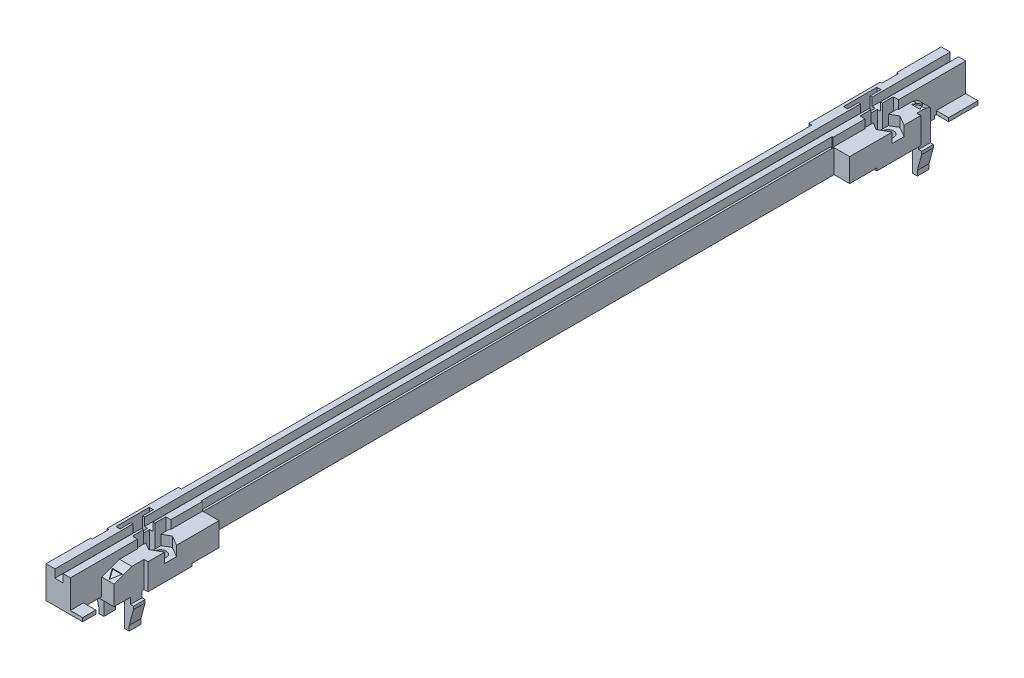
ISO-10303-21;
HEADER;
FILE_DESCRIPTION(('STEP AP214'),'2;1');
FILE_NAME('part.step','',(''),(''),'','','');
FILE_SCHEMA(('AUTOMOTIVE_DESIGN { 1 0 10303 214 1 1 1 1 }'));
ENDSEC;
DATA;
#1=APPLICATION_CONTEXT('core data for automotive mechanical design processes');
#2=APPLICATION_PROTOCOL_DEFINITION('international standard','automotive_design',2000,#1);
#3=PRODUCT_CONTEXT('',#1,'mechanical');
#4=PRODUCT('Part','Part','',(#3));
#5=PRODUCT_RELATED_PRODUCT_CATEGORY('part','',(#4));
#6=PRODUCT_DEFINITION_FORMATION('','',#4);
#7=PRODUCT_DEFINITION_CONTEXT('part definition',#1,'design');
#8=PRODUCT_DEFINITION('design','',#6,#7);
#9=PRODUCT_DEFINITION_SHAPE('','',#8);
#10=(LENGTH_UNIT() NAMED_UNIT(*) SI_UNIT(.MILLI.,.METRE.));
#11=(NAMED_UNIT(*) PLANE_ANGLE_UNIT() SI_UNIT($,.RADIAN.));
#12=(NAMED_UNIT(*) SI_UNIT($,.STERADIAN.) SOLID_ANGLE_UNIT());
#13=UNCERTAINTY_MEASURE_WITH_UNIT(LENGTH_MEASURE(1.E-05),#10,'distance_accuracy_value','');
#14=(GEOMETRIC_REPRESENTATION_CONTEXT(3) GLOBAL_UNCERTAINTY_ASSIGNED_CONTEXT((#13)) GLOBAL_UNIT_ASSIGNED_CONTEXT((#10,
#11,#12)) REPRESENTATION_CONTEXT('',''));
#15=CARTESIAN_POINT('',(0.,0.,0.));
#16=DIRECTION('',(0.,0.,1.));
#17=DIRECTION('',(1.,0.,0.));
#18=AXIS2_PLACEMENT_3D('',#15,#16,#17);
#19=CARTESIAN_POINT('',(7.32661,-2.269,-196.45));
#20=DIRECTION('',(1.,0.,0.));
#21=DIRECTION('',(0.,0.,-1.));
#22=AXIS2_PLACEMENT_3D('',#19,#20,#21);
#23=PLANE('',#22);
#24=DIRECTION('',(0.,1.,0.));
#25=VECTOR('',#24,1.);
#26=CARTESIAN_POINT('',(7.32661,-2.269,-196.45));
#27=LINE('',#26,#25);
#28=CARTESIAN_POINT('',(7.32661,-2.269,-196.45));
#29=VERTEX_POINT('',#28);
#30=CARTESIAN_POINT('',(7.32661,-1.55,-196.45));
#31=VERTEX_POINT('',#30);
#32=EDGE_CURVE('E938',#29,#31,#27,.T.);
#33=ORIENTED_EDGE('',*,*,#32,.T.);
#34=DIRECTION('',(0.,0.,1.));
#35=VECTOR('',#34,1.);
#36=CARTESIAN_POINT('',(7.32661,-1.55,-196.45));
#37=LINE('',#36,#35);
#38=CARTESIAN_POINT('',(7.32661,-1.55,-193.55));
#39=VERTEX_POINT('',#38);
#40=EDGE_CURVE('E1734',#39,#31,#37,.F.);
#41=ORIENTED_EDGE('',*,*,#40,.F.);
#42=DIRECTION('',(0.,1.,0.));
#43=VECTOR('',#42,1.);
#44=CARTESIAN_POINT('',(7.32661,-2.269,-193.55));
#45=LINE('',#44,#43);
#46=CARTESIAN_POINT('',(7.32661,-2.269,-193.55));
#47=VERTEX_POINT('',#46);
#48=EDGE_CURVE('E966',#39,#47,#45,.F.);
#49=ORIENTED_EDGE('',*,*,#48,.T.);
#50=DIRECTION('',(0.,0.,1.));
#51=VECTOR('',#50,1.);
#52=CARTESIAN_POINT('',(7.32661,-2.269,-196.45));
#53=LINE('',#52,#51);
#54=EDGE_CURVE('E955',#29,#47,#53,.T.);
#55=ORIENTED_EDGE('',*,*,#54,.F.);
#56=EDGE_LOOP('',(#33,#41,#49,#55));
#57=FACE_BOUND('',#56,.T.);
#58=ADVANCED_FACE('F15',(#57),#23,.T.);
#59=CARTESIAN_POINT('',(-1.14808704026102,6.,-196.45));
#60=DIRECTION('',(0.,-0.939692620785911,0.342020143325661));
#61=DIRECTION('',(0.,-0.342020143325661,-0.939692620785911));
#62=AXIS2_PLACEMENT_3D('',#59,#60,#61);
#63=PLANE('',#62);
#64=DIRECTION('',(0.500000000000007,-0.296198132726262,-0.813797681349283));
#65=VECTOR('',#64,1.);
#66=CARTESIAN_POINT('',(4.49357841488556,6.44999999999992,-195.213635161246));
#67=LINE('',#66,#65);
#68=CARTESIAN_POINT('',(4.4935784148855,6.44999999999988,-195.213635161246));
#69=VERTEX_POINT('',#68);
#70=CARTESIAN_POINT('',(5.07999999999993,6.1026060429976,-196.168092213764));
#71=VERTEX_POINT('',#70);
#72=EDGE_CURVE('E1745',#69,#71,#67,.T.);
#73=ORIENTED_EDGE('',*,*,#72,.T.);
#74=DIRECTION('',(0.499999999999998,0.296198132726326,0.813797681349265));
#75=VECTOR('',#74,1.);
#76=CARTESIAN_POINT('',(5.08000000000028,6.10260604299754,-196.168092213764));
#77=LINE('',#76,#75);
#78=CARTESIAN_POINT('',(5.66642158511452,6.4499999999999,-195.213635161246));
#79=VERTEX_POINT('',#78);
#80=EDGE_CURVE('E1739',#71,#79,#77,.T.);
#81=ORIENTED_EDGE('',*,*,#80,.T.);
#82=DIRECTION('',(1.,0.,0.));
#83=VECTOR('',#82,1.);
#84=CARTESIAN_POINT('',(-1.14808704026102,6.4499999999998,-195.213635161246));
#85=LINE('',#84,#83);
#86=CARTESIAN_POINT('',(6.58,6.4499999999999,-195.213635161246));
#87=VERTEX_POINT('',#86);
#88=EDGE_CURVE('E922',#87,#79,#85,.F.);
#89=ORIENTED_EDGE('',*,*,#88,.F.);
#90=DIRECTION('',(0.,-0.342020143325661,-0.939692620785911));
#91=VECTOR('',#90,1.);
#92=CARTESIAN_POINT('',(6.58,6.,-196.45));
#93=LINE('',#92,#91);
#94=CARTESIAN_POINT('',(6.58,6.,-196.45));
#95=VERTEX_POINT('',#94);
#96=EDGE_CURVE('E937',#95,#87,#93,.F.);
#97=ORIENTED_EDGE('',*,*,#96,.F.);
#98=DIRECTION('',(-1.,0.,0.));
#99=VECTOR('',#98,1.);
#100=CARTESIAN_POINT('',(0.,6.,-196.45));
#101=LINE('',#100,#99);
#102=CARTESIAN_POINT('',(3.53,6.,-196.45));
#103=VERTEX_POINT('',#102);
#104=EDGE_CURVE('E933',#103,#95,#101,.F.);
#105=ORIENTED_EDGE('',*,*,#104,.F.);
#106=DIRECTION('',(0.,-0.342020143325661,-0.939692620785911));
#107=VECTOR('',#106,1.);
#108=CARTESIAN_POINT('',(3.53,6.,-196.45));
#109=LINE('',#108,#107);
#110=CARTESIAN_POINT('',(3.53,6.44999999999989,-195.213635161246));
#111=VERTEX_POINT('',#110);
#112=EDGE_CURVE('E926',#111,#103,#109,.T.);
#113=ORIENTED_EDGE('',*,*,#112,.F.);
#114=DIRECTION('',(1.,0.,0.));
#115=VECTOR('',#114,1.);
#116=CARTESIAN_POINT('',(-1.14808704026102,6.44999999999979,-195.213635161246));
#117=LINE('',#116,#115);
#118=EDGE_CURVE('E930',#69,#111,#117,.F.);
#119=ORIENTED_EDGE('',*,*,#118,.F.);
#120=EDGE_LOOP('',(#73,#81,#89,#97,#105,#113,#119));
#121=FACE_BOUND('',#120,.T.);
#122=ADVANCED_FACE('F928',(#121),#63,.F.);
#123=CARTESIAN_POINT('',(6.28,-6.17500169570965,-196.45));
#124=DIRECTION('',(0.965925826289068,-0.258819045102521,0.));
#125=DIRECTION('',(0.258819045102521,0.965925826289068,0.));
#126=AXIS2_PLACEMENT_3D('',#123,#124,#125);
#127=PLANE('',#126);
#128=DIRECTION('',(-0.258819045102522,-0.965925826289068,0.));
#129=VECTOR('',#128,1.);
#130=CARTESIAN_POINT('',(7.32661,-2.269,-196.45));
#131=LINE('',#130,#129);
#132=CARTESIAN_POINT('',(6.28,-6.17500169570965,-196.45));
#133=VERTEX_POINT('',#132);
#134=EDGE_CURVE('E1717',#29,#133,#131,.T.);
#135=ORIENTED_EDGE('',*,*,#134,.F.);
#136=ORIENTED_EDGE('',*,*,#54,.T.);
#137=DIRECTION('',(-0.258819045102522,-0.965925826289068,0.));
#138=VECTOR('',#137,1.);
#139=CARTESIAN_POINT('',(7.32661,-2.269,-193.55));
#140=LINE('',#139,#138);
#141=CARTESIAN_POINT('',(6.28,-6.17500169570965,-193.55));
#142=VERTEX_POINT('',#141);
#143=EDGE_CURVE('E1728',#47,#142,#140,.T.);
#144=ORIENTED_EDGE('',*,*,#143,.T.);
#145=DIRECTION('',(0.,0.,-1.));
#146=VECTOR('',#145,1.);
#147=CARTESIAN_POINT('',(6.28,-6.17500169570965,-196.45));
#148=LINE('',#147,#146);
#149=EDGE_CURVE('E958',#133,#142,#148,.F.);
#150=ORIENTED_EDGE('',*,*,#149,.F.);
#151=EDGE_LOOP('',(#135,#136,#144,#150));
#152=FACE_BOUND('',#151,.T.);
#153=ADVANCED_FACE('F1799',(#152),#127,.T.);
#154=CARTESIAN_POINT('',(6.28,-7.4,-196.45));
#155=DIRECTION('',(1.,0.,0.));
#156=DIRECTION('',(0.,0.,-1.));
#157=AXIS2_PLACEMENT_3D('',#154,#155,#156);
#158=PLANE('',#157);
#159=DIRECTION('',(0.,1.,0.));
#160=VECTOR('',#159,1.);
#161=CARTESIAN_POINT('',(6.28,0.,-196.45));
#162=LINE('',#161,#160);
#163=CARTESIAN_POINT('',(6.28,-7.4,-196.45));
#164=VERTEX_POINT('',#163);
#165=EDGE_CURVE('E1715',#133,#164,#162,.F.);
#166=ORIENTED_EDGE('',*,*,#165,.F.);
#167=ORIENTED_EDGE('',*,*,#149,.T.);
#168=DIRECTION('',(0.,1.,0.));
#169=VECTOR('',#168,1.);
#170=CARTESIAN_POINT('',(6.28,0.,-193.55));
#171=LINE('',#170,#169);
#172=CARTESIAN_POINT('',(6.28,-7.4,-193.55));
#173=VERTEX_POINT('',#172);
#174=EDGE_CURVE('E1726',#142,#173,#171,.F.);
#175=ORIENTED_EDGE('',*,*,#174,.T.);
#176=DIRECTION('',(0.,0.,-1.));
#177=VECTOR('',#176,1.);
#178=CARTESIAN_POINT('',(6.28,-7.4,-196.45));
#179=LINE('',#178,#177);
#180=EDGE_CURVE('E1705',#164,#173,#179,.F.);
#181=ORIENTED_EDGE('',*,*,#180,.F.);
#182=EDGE_LOOP('',(#166,#167,#175,#181));
#183=FACE_BOUND('',#182,.T.);
#184=ADVANCED_FACE('F1790',(#183),#158,.T.);
#185=CARTESIAN_POINT('',(-1.2,-7.4,-196.45));
#186=DIRECTION('',(-1.,0.,0.));
#187=DIRECTION('',(0.,0.,1.));
#188=AXIS2_PLACEMENT_3D('',#185,#186,#187);
#189=PLANE('',#188);
#190=DIRECTION('',(0.,1.,0.));
#191=VECTOR('',#190,1.);
#192=CARTESIAN_POINT('',(-1.2,-7.4,-196.45));
#193=LINE('',#192,#191);
#194=CARTESIAN_POINT('',(-1.2,-6.17500169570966,-196.45));
#195=VERTEX_POINT('',#194);
#196=CARTESIAN_POINT('',(-1.2,-7.4,-196.45));
#197=VERTEX_POINT('',#196);
#198=EDGE_CURVE('E1785',#195,#197,#193,.F.);
#199=ORIENTED_EDGE('',*,*,#198,.T.);
#200=DIRECTION('',(0.,0.,-1.));
#201=VECTOR('',#200,1.);
#202=CARTESIAN_POINT('',(-1.2,-7.4,-196.45));
#203=LINE('',#202,#201);
#204=CARTESIAN_POINT('',(-1.2,-7.4,-193.55));
#205=VERTEX_POINT('',#204);
#206=EDGE_CURVE('E1673',#205,#197,#203,.T.);
#207=ORIENTED_EDGE('',*,*,#206,.F.);
#208=DIRECTION('',(0.,1.,0.));
#209=VECTOR('',#208,1.);
#210=CARTESIAN_POINT('',(-1.2,0.,-193.55));
#211=LINE('',#210,#209);
#212=CARTESIAN_POINT('',(-1.2,-6.17500169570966,-193.55));
#213=VERTEX_POINT('',#212);
#214=EDGE_CURVE('E1679',#213,#205,#211,.F.);
#215=ORIENTED_EDGE('',*,*,#214,.F.);
#216=DIRECTION('',(0.,0.,1.));
#217=VECTOR('',#216,1.);
#218=CARTESIAN_POINT('',(-1.2,-6.17500169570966,-196.45));
#219=LINE('',#218,#217);
#220=EDGE_CURVE('E1783',#195,#213,#219,.T.);
#221=ORIENTED_EDGE('',*,*,#220,.F.);
#222=EDGE_LOOP('',(#199,#207,#215,#221));
#223=FACE_BOUND('',#222,.T.);
#224=ADVANCED_FACE('F2068',(#223),#189,.T.);
#225=CARTESIAN_POINT('',(-1.2,-6.17500169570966,-196.45));
#226=DIRECTION('',(-0.965925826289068,-0.258819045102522,0.));
#227=DIRECTION('',(0.258819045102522,-0.965925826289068,0.));
#228=AXIS2_PLACEMENT_3D('',#225,#226,#227);
#229=PLANE('',#228);
#230=DIRECTION('',(0.258819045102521,-0.965925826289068,0.));
#231=VECTOR('',#230,1.);
#232=CARTESIAN_POINT('',(-2.24661,-2.269,-196.45));
#233=LINE('',#232,#231);
#234=CARTESIAN_POINT('',(-2.24661,-2.269,-196.45));
#235=VERTEX_POINT('',#234);
#236=EDGE_CURVE('E1665',#235,#195,#233,.T.);
#237=ORIENTED_EDGE('',*,*,#236,.T.);
#238=ORIENTED_EDGE('',*,*,#220,.T.);
#239=DIRECTION('',(0.258819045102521,-0.965925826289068,0.));
#240=VECTOR('',#239,1.);
#241=CARTESIAN_POINT('',(-2.24661,-2.269,-193.55));
#242=LINE('',#241,#240);
#243=CARTESIAN_POINT('',(-2.24661,-2.269,-193.55));
#244=VERTEX_POINT('',#243);
#245=EDGE_CURVE('E1681',#244,#213,#242,.T.);
#246=ORIENTED_EDGE('',*,*,#245,.F.);
#247=DIRECTION('',(0.,0.,1.));
#248=VECTOR('',#247,1.);
#249=CARTESIAN_POINT('',(-2.24661,-2.269,-196.45));
#250=LINE('',#249,#248);
#251=EDGE_CURVE('E1781',#235,#244,#250,.T.);
#252=ORIENTED_EDGE('',*,*,#251,.F.);
#253=EDGE_LOOP('',(#237,#238,#246,#252));
#254=FACE_BOUND('',#253,.T.);
#255=ADVANCED_FACE('F2064',(#254),#229,.T.);
#256=CARTESIAN_POINT('',(-2.24661,-2.269,-196.45));
#257=DIRECTION('',(-1.,0.,0.));
#258=DIRECTION('',(0.,0.,1.));
#259=AXIS2_PLACEMENT_3D('',#256,#257,#258);
#260=PLANE('',#259);
#261=DIRECTION('',(0.,1.,0.));
#262=VECTOR('',#261,1.);
#263=CARTESIAN_POINT('',(-2.24661,0.,-196.45));
#264=LINE('',#263,#262);
#265=CARTESIAN_POINT('',(-2.24661,-1.55,-196.45));
#266=VERTEX_POINT('',#265);
#267=EDGE_CURVE('E1668',#266,#235,#264,.F.);
#268=ORIENTED_EDGE('',*,*,#267,.T.);
#269=ORIENTED_EDGE('',*,*,#251,.T.);
#270=DIRECTION('',(0.,1.,0.));
#271=VECTOR('',#270,1.);
#272=CARTESIAN_POINT('',(-2.24661,0.,-193.55));
#273=LINE('',#272,#271);
#274=CARTESIAN_POINT('',(-2.24661,-1.55,-193.55));
#275=VERTEX_POINT('',#274);
#276=EDGE_CURVE('E1684',#275,#244,#273,.F.);
#277=ORIENTED_EDGE('',*,*,#276,.F.);
#278=DIRECTION('',(0.,0.,1.));
#279=VECTOR('',#278,1.);
#280=CARTESIAN_POINT('',(-2.24661,-1.55,-196.45));
#281=LINE('',#280,#279);
#282=EDGE_CURVE('E1650',#266,#275,#281,.T.);
#283=ORIENTED_EDGE('',*,*,#282,.F.);
#284=EDGE_LOOP('',(#268,#269,#277,#283));
#285=FACE_BOUND('',#284,.T.);
#286=ADVANCED_FACE('F2060',(#285),#260,.T.);
#287=CARTESIAN_POINT('',(6.58,-1.55,-196.45));
#288=DIRECTION('',(1.,0.,0.));
#289=DIRECTION('',(0.,1.,0.));
#290=AXIS2_PLACEMENT_3D('',#287,#288,#289);
#291=PLANE('',#290);
#292=DIRECTION('',(0.,0.,-1.));
#293=VECTOR('',#292,1.);
#294=CARTESIAN_POINT('',(6.58,0.65,-208.25));
#295=LINE('',#294,#293);
#296=CARTESIAN_POINT('',(6.58,0.65,-208.25));
#297=VERTEX_POINT('',#296);
#298=CARTESIAN_POINT('',(6.58,0.65,-201.));
#299=VERTEX_POINT('',#298);
#300=EDGE_CURVE('E1634',#297,#299,#295,.F.);
#301=ORIENTED_EDGE('',*,*,#300,.F.);
#302=DIRECTION('',(0.,1.,0.));
#303=VECTOR('',#302,1.);
#304=CARTESIAN_POINT('',(6.58,-1.55,-208.25));
#305=LINE('',#304,#303);
#306=CARTESIAN_POINT('',(6.58,1.55,-208.25));
#307=VERTEX_POINT('',#306);
#308=EDGE_CURVE('E1779',#297,#307,#305,.T.);
#309=ORIENTED_EDGE('',*,*,#308,.T.);
#310=DIRECTION('',(0.,0.,1.));
#311=VECTOR('',#310,1.);
#312=CARTESIAN_POINT('',(6.58,1.55,0.));
#313=LINE('',#312,#311);
#314=CARTESIAN_POINT('',(6.58,1.55,-201.));
#315=VERTEX_POINT('',#314);
#316=EDGE_CURVE('E1636',#315,#307,#313,.F.);
#317=ORIENTED_EDGE('',*,*,#316,.F.);
#318=DIRECTION('',(0.,1.,0.));
#319=VECTOR('',#318,1.);
#320=CARTESIAN_POINT('',(6.58,4.65,-201.));
#321=LINE('',#320,#319);
#322=EDGE_CURVE('E1777',#299,#315,#321,.T.);
#323=ORIENTED_EDGE('',*,*,#322,.F.);
#324=EDGE_LOOP('',(#301,#309,#317,#323));
#325=FACE_BOUND('',#324,.T.);
#326=ADVANCED_FACE('F2735',(#325),#291,.T.);
#327=CARTESIAN_POINT('',(3.53,4.65,-201.));
#328=DIRECTION('',(0.,0.,1.));
#329=DIRECTION('',(1.,0.,0.));
#330=AXIS2_PLACEMENT_3D('',#327,#328,#329);
#331=PLANE('',#330);
#332=DIRECTION('',(0.,1.,0.));
#333=VECTOR('',#332,1.);
#334=CARTESIAN_POINT('',(3.53,4.65,-201.));
#335=LINE('',#334,#333);
#336=CARTESIAN_POINT('',(3.53,1.55,-201.));
#337=VERTEX_POINT('',#336);
#338=CARTESIAN_POINT('',(3.53,0.65,-201.));
#339=VERTEX_POINT('',#338);
#340=EDGE_CURVE('E1775',#337,#339,#335,.F.);
#341=ORIENTED_EDGE('',*,*,#340,.T.);
#342=DIRECTION('',(1.,0.,0.));
#343=VECTOR('',#342,1.);
#344=CARTESIAN_POINT('',(10.,0.649999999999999,-201.));
#345=LINE('',#344,#343);
#346=EDGE_CURVE('E1631',#299,#339,#345,.F.);
#347=ORIENTED_EDGE('',*,*,#346,.F.);
#348=ORIENTED_EDGE('',*,*,#322,.T.);
#349=DIRECTION('',(1.,0.,0.));
#350=VECTOR('',#349,1.);
#351=CARTESIAN_POINT('',(0.,1.55,-201.));
#352=LINE('',#351,#350);
#353=EDGE_CURVE('E1639',#337,#315,#352,.T.);
#354=ORIENTED_EDGE('',*,*,#353,.F.);
#355=EDGE_LOOP('',(#341,#347,#348,#354));
#356=FACE_BOUND('',#355,.T.);
#357=ADVANCED_FACE('F2727',(#356),#331,.T.);
#358=CARTESIAN_POINT('',(6.28,-7.4,1.45));
#359=DIRECTION('',(-1.,0.,0.));
#360=DIRECTION('',(0.,0.,1.));
#361=AXIS2_PLACEMENT_3D('',#358,#359,#360);
#362=PLANE('',#361);
#363=DIRECTION('',(0.,0.,1.));
#364=VECTOR('',#363,1.);
#365=CARTESIAN_POINT('',(6.28,-6.17500169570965,1.45));
#366=LINE('',#365,#364);
#367=CARTESIAN_POINT('',(6.28,-6.17500169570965,-1.45));
#368=VERTEX_POINT('',#367);
#369=CARTESIAN_POINT('',(6.28,-6.17500169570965,1.45));
#370=VERTEX_POINT('',#369);
#371=EDGE_CURVE('E1770',#368,#370,#366,.T.);
#372=ORIENTED_EDGE('',*,*,#371,.T.);
#373=DIRECTION('',(0.,1.,0.));
#374=VECTOR('',#373,1.);
#375=CARTESIAN_POINT('',(6.28,0.,1.45));
#376=LINE('',#375,#374);
#377=CARTESIAN_POINT('',(6.28,-7.4,1.45));
#378=VERTEX_POINT('',#377);
#379=EDGE_CURVE('E1605',#378,#370,#376,.T.);
#380=ORIENTED_EDGE('',*,*,#379,.F.);
#381=DIRECTION('',(0.,0.,1.));
#382=VECTOR('',#381,1.);
#383=CARTESIAN_POINT('',(6.28,-7.4,1.45));
#384=LINE('',#383,#382);
#385=CARTESIAN_POINT('',(6.28,-7.4,-1.45));
#386=VERTEX_POINT('',#385);
#387=EDGE_CURVE('E1593',#378,#386,#384,.F.);
#388=ORIENTED_EDGE('',*,*,#387,.T.);
#389=DIRECTION('',(0.,1.,0.));
#390=VECTOR('',#389,1.);
#391=CARTESIAN_POINT('',(6.28,-7.4,-1.45));
#392=LINE('',#391,#390);
#393=EDGE_CURVE('E1773',#368,#386,#392,.F.);
#394=ORIENTED_EDGE('',*,*,#393,.F.);
#395=EDGE_LOOP('',(#372,#380,#388,#394));
#396=FACE_BOUND('',#395,.T.);
#397=ADVANCED_FACE('F2742',(#396),#362,.F.);
#398=CARTESIAN_POINT('',(6.28,-6.17500169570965,1.45));
#399=DIRECTION('',(-0.965925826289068,0.258819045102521,0.));
#400=DIRECTION('',(-0.258819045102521,-0.965925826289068,0.));
#401=AXIS2_PLACEMENT_3D('',#398,#399,#400);
#402=PLANE('',#401);
#403=DIRECTION('',(0.,0.,1.));
#404=VECTOR('',#403,1.);
#405=CARTESIAN_POINT('',(7.32661,-2.269,1.45));
#406=LINE('',#405,#404);
#407=CARTESIAN_POINT('',(7.32661,-2.269,-1.45));
#408=VERTEX_POINT('',#407);
#409=CARTESIAN_POINT('',(7.32661,-2.269,1.45));
#410=VERTEX_POINT('',#409);
#411=EDGE_CURVE('E1753',#408,#410,#406,.T.);
#412=ORIENTED_EDGE('',*,*,#411,.T.);
#413=DIRECTION('',(0.258819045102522,0.965925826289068,0.));
#414=VECTOR('',#413,1.);
#415=CARTESIAN_POINT('',(6.28,-6.17500169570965,1.45));
#416=LINE('',#415,#414);
#417=EDGE_CURVE('E1603',#370,#410,#416,.T.);
#418=ORIENTED_EDGE('',*,*,#417,.F.);
#419=ORIENTED_EDGE('',*,*,#371,.F.);
#420=DIRECTION('',(0.258819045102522,0.965925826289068,0.));
#421=VECTOR('',#420,1.);
#422=CARTESIAN_POINT('',(6.28,-6.17500169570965,-1.45));
#423=LINE('',#422,#421);
#424=EDGE_CURVE('E1587',#368,#408,#423,.T.);
#425=ORIENTED_EDGE('',*,*,#424,.T.);
#426=EDGE_LOOP('',(#412,#418,#419,#425));
#427=FACE_BOUND('',#426,.T.);
#428=ADVANCED_FACE('F2818',(#427),#402,.F.);
#429=CARTESIAN_POINT('',(-2.24661,-2.269,1.45));
#430=DIRECTION('',(1.,0.,0.));
#431=DIRECTION('',(0.,0.,-1.));
#432=AXIS2_PLACEMENT_3D('',#429,#430,#431);
#433=PLANE('',#432);
#434=DIRECTION('',(0.,0.,1.));
#435=VECTOR('',#434,1.);
#436=CARTESIAN_POINT('',(-2.24661,-2.269,1.45));
#437=LINE('',#436,#435);
#438=CARTESIAN_POINT('',(-2.24661,-2.269,-1.45));
#439=VERTEX_POINT('',#438);
#440=CARTESIAN_POINT('',(-2.24661,-2.269,1.45));
#441=VERTEX_POINT('',#440);
#442=EDGE_CURVE('E1759',#439,#441,#437,.T.);
#443=ORIENTED_EDGE('',*,*,#442,.T.);
#444=DIRECTION('',(0.,1.,0.));
#445=VECTOR('',#444,1.);
#446=CARTESIAN_POINT('',(-2.24661,-2.269,1.45));
#447=LINE('',#446,#445);
#448=CARTESIAN_POINT('',(-2.24661,-1.55,1.45));
#449=VERTEX_POINT('',#448);
#450=EDGE_CURVE('E1768',#449,#441,#447,.F.);
#451=ORIENTED_EDGE('',*,*,#450,.F.);
#452=DIRECTION('',(0.,0.,1.));
#453=VECTOR('',#452,1.);
#454=CARTESIAN_POINT('',(-2.24661,-1.55,1.45));
#455=LINE('',#454,#453);
#456=CARTESIAN_POINT('',(-2.24661,-1.55,-1.45));
#457=VERTEX_POINT('',#456);
#458=EDGE_CURVE('E1521',#449,#457,#455,.F.);
#459=ORIENTED_EDGE('',*,*,#458,.T.);
#460=DIRECTION('',(0.,1.,0.));
#461=VECTOR('',#460,1.);
#462=CARTESIAN_POINT('',(-2.24661,-2.269,-1.45));
#463=LINE('',#462,#461);
#464=EDGE_CURVE('E1766',#439,#457,#463,.T.);
#465=ORIENTED_EDGE('',*,*,#464,.F.);
#466=EDGE_LOOP('',(#443,#451,#459,#465));
#467=FACE_BOUND('',#466,.T.);
#468=ADVANCED_FACE('F2827',(#467),#433,.F.);
#469=CARTESIAN_POINT('',(-1.2,-7.4,1.45));
#470=DIRECTION('',(1.,0.,0.));
#471=DIRECTION('',(0.,0.,-1.));
#472=AXIS2_PLACEMENT_3D('',#469,#470,#471);
#473=PLANE('',#472);
#474=DIRECTION('',(0.,0.,1.));
#475=VECTOR('',#474,1.);
#476=CARTESIAN_POINT('',(-1.2,-7.4,1.45));
#477=LINE('',#476,#475);
#478=CARTESIAN_POINT('',(-1.2,-7.4,-1.45));
#479=VERTEX_POINT('',#478);
#480=CARTESIAN_POINT('',(-1.2,-7.4,1.45));
#481=VERTEX_POINT('',#480);
#482=EDGE_CURVE('E1518',#479,#481,#477,.T.);
#483=ORIENTED_EDGE('',*,*,#482,.T.);
#484=DIRECTION('',(0.,1.,0.));
#485=VECTOR('',#484,1.);
#486=CARTESIAN_POINT('',(-1.2,-7.4,1.45));
#487=LINE('',#486,#485);
#488=CARTESIAN_POINT('',(-1.2,-6.17500169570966,1.45));
#489=VERTEX_POINT('',#488);
#490=EDGE_CURVE('E1764',#489,#481,#487,.F.);
#491=ORIENTED_EDGE('',*,*,#490,.F.);
#492=DIRECTION('',(0.,0.,1.));
#493=VECTOR('',#492,1.);
#494=CARTESIAN_POINT('',(-1.2,-6.17500169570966,1.45));
#495=LINE('',#494,#493);
#496=CARTESIAN_POINT('',(-1.2,-6.17500169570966,-1.45));
#497=VERTEX_POINT('',#496);
#498=EDGE_CURVE('E1756',#489,#497,#495,.F.);
#499=ORIENTED_EDGE('',*,*,#498,.T.);
#500=DIRECTION('',(0.,1.,0.));
#501=VECTOR('',#500,1.);
#502=CARTESIAN_POINT('',(-1.2,-7.4,-1.45));
#503=LINE('',#502,#501);
#504=EDGE_CURVE('E1762',#479,#497,#503,.T.);
#505=ORIENTED_EDGE('',*,*,#504,.F.);
#506=EDGE_LOOP('',(#483,#491,#499,#505));
#507=FACE_BOUND('',#506,.T.);
#508=ADVANCED_FACE('F2837',(#507),#473,.F.);
#509=CARTESIAN_POINT('',(-1.2,-6.17500169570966,1.45));
#510=DIRECTION('',(0.965925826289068,0.258819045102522,0.));
#511=DIRECTION('',(-0.258819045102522,0.965925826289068,0.));
#512=AXIS2_PLACEMENT_3D('',#509,#510,#511);
#513=PLANE('',#512);
#514=ORIENTED_EDGE('',*,*,#498,.F.);
#515=DIRECTION('',(-0.258819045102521,0.965925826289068,0.));
#516=VECTOR('',#515,1.);
#517=CARTESIAN_POINT('',(-1.2,-6.17500169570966,1.45));
#518=LINE('',#517,#516);
#519=EDGE_CURVE('E1512',#489,#441,#518,.T.);
#520=ORIENTED_EDGE('',*,*,#519,.T.);
#521=ORIENTED_EDGE('',*,*,#442,.F.);
#522=DIRECTION('',(-0.258819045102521,0.965925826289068,0.));
#523=VECTOR('',#522,1.);
#524=CARTESIAN_POINT('',(-1.2,-6.17500169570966,-1.45));
#525=LINE('',#524,#523);
#526=EDGE_CURVE('E1500',#497,#439,#525,.T.);
#527=ORIENTED_EDGE('',*,*,#526,.F.);
#528=EDGE_LOOP('',(#514,#520,#521,#527));
#529=FACE_BOUND('',#528,.T.);
#530=ADVANCED_FACE('F2847',(#529),#513,.F.);
#531=CARTESIAN_POINT('',(7.32661,-2.269,1.45));
#532=DIRECTION('',(-1.,0.,0.));
#533=DIRECTION('',(0.,0.,1.));
#534=AXIS2_PLACEMENT_3D('',#531,#532,#533);
#535=PLANE('',#534);
#536=DIRECTION('',(0.,0.,1.));
#537=VECTOR('',#536,1.);
#538=CARTESIAN_POINT('',(7.32661,-1.55,1.45));
#539=LINE('',#538,#537);
#540=CARTESIAN_POINT('',(7.32661,-1.55,-1.45));
#541=VERTEX_POINT('',#540);
#542=CARTESIAN_POINT('',(7.32661,-1.55,1.45));
#543=VERTEX_POINT('',#542);
#544=EDGE_CURVE('E1495',#541,#543,#539,.T.);
#545=ORIENTED_EDGE('',*,*,#544,.T.);
#546=DIRECTION('',(0.,1.,0.));
#547=VECTOR('',#546,1.);
#548=CARTESIAN_POINT('',(7.32661,0.,1.45));
#549=LINE('',#548,#547);
#550=EDGE_CURVE('E1601',#410,#543,#549,.T.);
#551=ORIENTED_EDGE('',*,*,#550,.F.);
#552=ORIENTED_EDGE('',*,*,#411,.F.);
#553=DIRECTION('',(0.,1.,0.));
#554=VECTOR('',#553,1.);
#555=CARTESIAN_POINT('',(7.32661,0.,-1.45));
#556=LINE('',#555,#554);
#557=EDGE_CURVE('E1584',#408,#541,#556,.T.);
#558=ORIENTED_EDGE('',*,*,#557,.T.);
#559=EDGE_LOOP('',(#545,#551,#552,#558));
#560=FACE_BOUND('',#559,.T.);
#561=ADVANCED_FACE('F2857',(#560),#535,.F.);
#562=CARTESIAN_POINT('',(3.80982940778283,5.42314257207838,3.04816240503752));
#563=DIRECTION('',(0.,0.939692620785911,0.342020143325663));
#564=DIRECTION('',(0.,-0.342020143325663,0.939692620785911));
#565=AXIS2_PLACEMENT_3D('',#562,#563,#564);
#566=PLANE('',#565);
#567=DIRECTION('',(0.499999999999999,-0.296198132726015,0.813797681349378));
#568=VECTOR('',#567,1.);
#569=CARTESIAN_POINT('',(3.80982940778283,5.42314257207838,3.04816240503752));
#570=LINE('',#569,#568);
#571=CARTESIAN_POINT('',(3.80982940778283,5.42314257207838,3.04816240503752));
#572=VERTEX_POINT('',#571);
#573=CARTESIAN_POINT('',(5.08,4.67069825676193,5.11548617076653));
#574=VERTEX_POINT('',#573);
#575=EDGE_CURVE('E1476',#572,#574,#570,.T.);
#576=ORIENTED_EDGE('',*,*,#575,.T.);
#577=DIRECTION('',(0.499999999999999,0.296198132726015,-0.813797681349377));
#578=VECTOR('',#577,1.);
#579=CARTESIAN_POINT('',(5.08,4.67069825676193,5.11548617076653));
#580=LINE('',#579,#578);
#581=CARTESIAN_POINT('',(6.35017059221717,5.42314257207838,3.04816240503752));
#582=VERTEX_POINT('',#581);
#583=EDGE_CURVE('E1487',#574,#582,#580,.T.);
#584=ORIENTED_EDGE('',*,*,#583,.T.);
#585=DIRECTION('',(1.,0.,0.));
#586=VECTOR('',#585,1.);
#587=CARTESIAN_POINT('',(6.35017059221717,5.42314257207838,3.04816240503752));
#588=LINE('',#587,#586);
#589=EDGE_CURVE('E1482',#582,#572,#588,.F.);
#590=ORIENTED_EDGE('',*,*,#589,.T.);
#591=EDGE_LOOP('',(#576,#584,#590));
#592=FACE_BOUND('',#591,.T.);
#593=ADVANCED_FACE('F2867',(#592),#566,.T.);
#594=CARTESIAN_POINT('',(6.58,-1.55,1.45));
#595=DIRECTION('',(-1.,0.,0.));
#596=DIRECTION('',(0.,-1.,0.));
#597=AXIS2_PLACEMENT_3D('',#594,#595,#596);
#598=PLANE('',#597);
#599=DIRECTION('',(0.,0.,1.));
#600=VECTOR('',#599,1.);
#601=CARTESIAN_POINT('',(6.58,1.55,0.));
#602=LINE('',#601,#600);
#603=CARTESIAN_POINT('',(6.58,1.55,13.25));
#604=VERTEX_POINT('',#603);
#605=CARTESIAN_POINT('',(6.58,1.55,10.));
#606=VERTEX_POINT('',#605);
#607=EDGE_CURVE('E1465',#604,#606,#602,.F.);
#608=ORIENTED_EDGE('',*,*,#607,.F.);
#609=DIRECTION('',(0.,-1.,0.));
#610=VECTOR('',#609,1.);
#611=CARTESIAN_POINT('',(6.58,-1.55,13.25));
#612=LINE('',#611,#610);
#613=CARTESIAN_POINT('',(6.58,0.65,13.25));
#614=VERTEX_POINT('',#613);
#615=EDGE_CURVE('E1751',#614,#604,#612,.F.);
#616=ORIENTED_EDGE('',*,*,#615,.F.);
#617=DIRECTION('',(0.,0.,1.));
#618=VECTOR('',#617,1.);
#619=CARTESIAN_POINT('',(6.58,0.65,13.25));
#620=LINE('',#619,#618);
#621=CARTESIAN_POINT('',(6.58,0.65,10.));
#622=VERTEX_POINT('',#621);
#623=EDGE_CURVE('E1470',#614,#622,#620,.F.);
#624=ORIENTED_EDGE('',*,*,#623,.T.);
#625=DIRECTION('',(0.,1.,0.));
#626=VECTOR('',#625,1.);
#627=CARTESIAN_POINT('',(6.58,4.65,10.));
#628=LINE('',#627,#626);
#629=EDGE_CURVE('E1747',#606,#622,#628,.F.);
#630=ORIENTED_EDGE('',*,*,#629,.F.);
#631=EDGE_LOOP('',(#608,#616,#624,#630));
#632=FACE_BOUND('',#631,.T.);
#633=ADVANCED_FACE('F2877',(#632),#598,.F.);
#634=CARTESIAN_POINT('',(3.53,4.65,10.));
#635=DIRECTION('',(0.,0.,-1.));
#636=DIRECTION('',(-1.,0.,0.));
#637=AXIS2_PLACEMENT_3D('',#634,#635,#636);
#638=PLANE('',#637);
#639=DIRECTION('',(1.,0.,0.));
#640=VECTOR('',#639,1.);
#641=CARTESIAN_POINT('',(0.,1.55,10.));
#642=LINE('',#641,#640);
#643=CARTESIAN_POINT('',(3.53,1.55,10.));
#644=VERTEX_POINT('',#643);
#645=EDGE_CURVE('E1462',#606,#644,#642,.F.);
#646=ORIENTED_EDGE('',*,*,#645,.F.);
#647=ORIENTED_EDGE('',*,*,#629,.T.);
#648=DIRECTION('',(1.,0.,0.));
#649=VECTOR('',#648,1.);
#650=CARTESIAN_POINT('',(10.,0.65,10.));
#651=LINE('',#650,#649);
#652=CARTESIAN_POINT('',(3.53,0.65,10.));
#653=VERTEX_POINT('',#652);
#654=EDGE_CURVE('E1467',#622,#653,#651,.F.);
#655=ORIENTED_EDGE('',*,*,#654,.T.);
#656=DIRECTION('',(0.,1.,0.));
#657=VECTOR('',#656,1.);
#658=CARTESIAN_POINT('',(3.53,4.65,10.));
#659=LINE('',#658,#657);
#660=EDGE_CURVE('E1749',#653,#644,#659,.T.);
#661=ORIENTED_EDGE('',*,*,#660,.T.);
#662=EDGE_LOOP('',(#646,#647,#655,#661));
#663=FACE_BOUND('',#662,.T.);
#664=ADVANCED_FACE('F2887',(#663),#638,.T.);
#665=CARTESIAN_POINT('',(1.755,8.55,-20.));
#666=DIRECTION('',(1.,0.,0.));
#667=DIRECTION('',(0.,1.,0.));
#668=AXIS2_PLACEMENT_3D('',#665,#666,#667);
#669=PLANE('',#668);
#670=DIRECTION('',(0.,1.,0.));
#671=VECTOR('',#670,1.);
#672=CARTESIAN_POINT('',(1.755,23.7329674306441,-186.075));
#673=LINE('',#672,#671);
#674=CARTESIAN_POINT('',(1.755,8.55,-186.075));
#675=VERTEX_POINT('',#674);
#676=CARTESIAN_POINT('',(1.755,6.55,-186.075));
#677=VERTEX_POINT('',#676);
#678=EDGE_CURVE('E1691',#675,#677,#673,.F.);
#679=ORIENTED_EDGE('',*,*,#678,.T.);
#680=DIRECTION('',(0.,0.,-1.));
#681=VECTOR('',#680,1.);
#682=CARTESIAN_POINT('',(1.755,6.55,-20.));
#683=LINE('',#682,#681);
#684=CARTESIAN_POINT('',(1.755,6.55,-8.925));
#685=VERTEX_POINT('',#684);
#686=EDGE_CURVE('E1547',#677,#685,#683,.F.);
#687=ORIENTED_EDGE('',*,*,#686,.T.);
#688=DIRECTION('',(0.,1.,0.));
#689=VECTOR('',#688,1.);
#690=CARTESIAN_POINT('',(1.755,23.7329674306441,-8.925));
#691=LINE('',#690,#689);
#692=CARTESIAN_POINT('',(1.755,8.55,-8.925));
#693=VERTEX_POINT('',#692);
#694=EDGE_CURVE('E1524',#693,#685,#691,.F.);
#695=ORIENTED_EDGE('',*,*,#694,.F.);
#696=DIRECTION('',(0.,0.,-1.));
#697=VECTOR('',#696,1.);
#698=CARTESIAN_POINT('',(1.755,8.55,13.25));
#699=LINE('',#698,#697);
#700=EDGE_CURVE('E1427',#693,#675,#699,.T.);
#701=ORIENTED_EDGE('',*,*,#700,.T.);
#702=EDGE_LOOP('',(#679,#687,#695,#701));
#703=FACE_BOUND('',#702,.T.);
#704=ADVANCED_FACE('F2897',(#703),#669,.F.);
#705=CARTESIAN_POINT('',(3.80982940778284,6.57314257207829,-193.998162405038));
#706=DIRECTION('',(-0.86602540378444,-0.171010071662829,-0.469846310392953));
#707=DIRECTION('',(-0.476870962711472,0.,0.87897331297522));
#708=AXIS2_PLACEMENT_3D('',#705,#706,#707);
#709=PLANE('',#708);
#710=DIRECTION('',(0.499999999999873,-0.296198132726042,-0.813797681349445));
#711=VECTOR('',#710,1.);
#712=CARTESIAN_POINT('',(4.01770136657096,6.45000000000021,-194.336493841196));
#713=LINE('',#712,#711);
#714=CARTESIAN_POINT('',(4.01770136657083,6.45000000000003,-194.336493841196));
#715=VERTEX_POINT('',#714);
#716=CARTESIAN_POINT('',(5.08,5.82069825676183,-196.065486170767));
#717=VERTEX_POINT('',#716);
#718=EDGE_CURVE('E1419',#715,#717,#713,.T.);
#719=ORIENTED_EDGE('',*,*,#718,.T.);
#720=DIRECTION('',(9.28077059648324E-13,0.939692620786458,-0.342020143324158));
#721=VECTOR('',#720,1.);
#722=CARTESIAN_POINT('',(5.08,5.82069825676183,-196.065486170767));
#723=LINE('',#722,#721);
#724=EDGE_CURVE('E1741',#717,#71,#723,.T.);
#725=ORIENTED_EDGE('',*,*,#724,.T.);
#726=ORIENTED_EDGE('',*,*,#72,.F.);
#727=DIRECTION('',(-0.476870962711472,0.,0.87897331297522));
#728=VECTOR('',#727,1.);
#729=CARTESIAN_POINT('',(3.82861611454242,6.44999999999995,-193.987970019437));
#730=LINE('',#729,#728);
#731=EDGE_CURVE('E954',#715,#69,#730,.F.);
#732=ORIENTED_EDGE('',*,*,#731,.F.);
#733=EDGE_LOOP('',(#719,#725,#726,#732));
#734=FACE_BOUND('',#733,.T.);
#735=ADVANCED_FACE('F2907',(#734),#709,.F.);
#736=CARTESIAN_POINT('',(5.08,5.82069825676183,-196.065486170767));
#737=DIRECTION('',(0.86602540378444,-0.17101007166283,-0.469846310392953));
#738=DIRECTION('',(-0.476870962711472,0.,-0.87897331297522));
#739=AXIS2_PLACEMENT_3D('',#736,#737,#738);
#740=PLANE('',#739);
#741=ORIENTED_EDGE('',*,*,#80,.F.);
#742=ORIENTED_EDGE('',*,*,#724,.F.);
#743=DIRECTION('',(0.49999999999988,0.296198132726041,0.813797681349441));
#744=VECTOR('',#743,1.);
#745=CARTESIAN_POINT('',(5.08,5.82069825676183,-196.065486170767));
#746=LINE('',#745,#744);
#747=CARTESIAN_POINT('',(6.14229863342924,6.45000000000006,-194.336493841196));
#748=VERTEX_POINT('',#747);
#749=EDGE_CURVE('E1416',#717,#748,#746,.T.);
#750=ORIENTED_EDGE('',*,*,#749,.T.);
#751=DIRECTION('',(-0.476870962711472,0.,-0.87897331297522));
#752=VECTOR('',#751,1.);
#753=CARTESIAN_POINT('',(5.17600666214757,6.45000000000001,-196.1175728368));
#754=LINE('',#753,#752);
#755=EDGE_CURVE('E1737',#79,#748,#754,.F.);
#756=ORIENTED_EDGE('',*,*,#755,.F.);
#757=EDGE_LOOP('',(#741,#742,#750,#756));
#758=FACE_BOUND('',#757,.T.);
#759=ADVANCED_FACE('F2917',(#758),#740,.F.);
#760=CARTESIAN_POINT('',(7.32661,-1.55,-196.45));
#761=DIRECTION('',(0.,1.,0.));
#762=DIRECTION('',(-1.,0.,0.));
#763=AXIS2_PLACEMENT_3D('',#760,#761,#762);
#764=PLANE('',#763);
#765=DIRECTION('',(-1.,0.,0.));
#766=VECTOR('',#765,1.);
#767=CARTESIAN_POINT('',(0.,-1.55,-196.45));
#768=LINE('',#767,#766);
#769=CARTESIAN_POINT('',(6.58,-1.55,-196.45));
#770=VERTEX_POINT('',#769);
#771=EDGE_CURVE('E1719',#770,#31,#768,.F.);
#772=ORIENTED_EDGE('',*,*,#771,.F.);
#773=DIRECTION('',(0.,0.,1.));
#774=VECTOR('',#773,1.);
#775=CARTESIAN_POINT('',(6.58,-1.55,-196.45));
#776=LINE('',#775,#774);
#777=CARTESIAN_POINT('',(6.58,-1.55,-193.55));
#778=VERTEX_POINT('',#777);
#779=EDGE_CURVE('E1409',#778,#770,#776,.F.);
#780=ORIENTED_EDGE('',*,*,#779,.F.);
#781=DIRECTION('',(-1.,0.,0.));
#782=VECTOR('',#781,1.);
#783=CARTESIAN_POINT('',(0.,-1.55,-193.55));
#784=LINE('',#783,#782);
#785=EDGE_CURVE('E1731',#778,#39,#784,.F.);
#786=ORIENTED_EDGE('',*,*,#785,.T.);
#787=ORIENTED_EDGE('',*,*,#40,.T.);
#788=EDGE_LOOP('',(#772,#780,#786,#787));
#789=FACE_BOUND('',#788,.T.);
#790=ADVANCED_FACE('F1809',(#789),#764,.T.);
#791=CARTESIAN_POINT('',(0.,0.,-193.55));
#792=DIRECTION('',(0.,0.,-1.));
#793=DIRECTION('',(-1.,0.,0.));
#794=AXIS2_PLACEMENT_3D('',#791,#792,#793);
#795=PLANE('',#794);
#796=DIRECTION('',(0.,-1.,0.));
#797=VECTOR('',#796,1.);
#798=CARTESIAN_POINT('',(5.08,0.,-193.55));
#799=LINE('',#798,#797);
#800=CARTESIAN_POINT('',(5.08,-7.4,-193.55));
#801=VERTEX_POINT('',#800);
#802=CARTESIAN_POINT('',(5.08,0.,-193.55));
#803=VERTEX_POINT('',#802);
#804=EDGE_CURVE('E1376',#801,#803,#799,.F.);
#805=ORIENTED_EDGE('',*,*,#804,.F.);
#806=DIRECTION('',(1.,0.,0.));
#807=VECTOR('',#806,1.);
#808=CARTESIAN_POINT('',(5.08,-7.4,-193.55));
#809=LINE('',#808,#807);
#810=EDGE_CURVE('E1711',#173,#801,#809,.F.);
#811=ORIENTED_EDGE('',*,*,#810,.F.);
#812=ORIENTED_EDGE('',*,*,#174,.F.);
#813=ORIENTED_EDGE('',*,*,#143,.F.);
#814=ORIENTED_EDGE('',*,*,#48,.F.);
#815=ORIENTED_EDGE('',*,*,#785,.F.);
#816=DIRECTION('',(0.,1.,0.));
#817=VECTOR('',#816,1.);
#818=CARTESIAN_POINT('',(6.58,-1.55,-193.55));
#819=LINE('',#818,#817);
#820=CARTESIAN_POINT('',(6.58,0.,-193.55));
#821=VERTEX_POINT('',#820);
#822=EDGE_CURVE('E1411',#821,#778,#819,.F.);
#823=ORIENTED_EDGE('',*,*,#822,.F.);
#824=DIRECTION('',(-1.,0.,0.));
#825=VECTOR('',#824,1.);
#826=CARTESIAN_POINT('',(0.,0.,-193.55));
#827=LINE('',#826,#825);
#828=EDGE_CURVE('E1723',#803,#821,#827,.F.);
#829=ORIENTED_EDGE('',*,*,#828,.F.);
#830=EDGE_LOOP('',(#805,#811,#812,#813,#814,#815,#823,#829));
#831=FACE_BOUND('',#830,.T.);
#832=ADVANCED_FACE('F1798',(#831),#795,.F.);
#833=CARTESIAN_POINT('',(0.,0.,-196.45));
#834=DIRECTION('',(0.,0.,-1.));
#835=DIRECTION('',(-1.,0.,0.));
#836=AXIS2_PLACEMENT_3D('',#833,#834,#835);
#837=PLANE('',#836);
#838=DIRECTION('',(-1.,0.,0.));
#839=VECTOR('',#838,1.);
#840=CARTESIAN_POINT('',(0.,0.,-196.45));
#841=LINE('',#840,#839);
#842=CARTESIAN_POINT('',(5.08,0.,-196.45));
#843=VERTEX_POINT('',#842);
#844=CARTESIAN_POINT('',(3.53,0.,-196.45));
#845=VERTEX_POINT('',#844);
#846=EDGE_CURVE('E1713',#843,#845,#841,.T.);
#847=ORIENTED_EDGE('',*,*,#846,.T.);
#848=DIRECTION('',(0.,1.,0.));
#849=VECTOR('',#848,1.);
#850=CARTESIAN_POINT('',(3.53,8.55,-196.45));
#851=LINE('',#850,#849);
#852=EDGE_CURVE('E1390',#103,#845,#851,.F.);
#853=ORIENTED_EDGE('',*,*,#852,.F.);
#854=ORIENTED_EDGE('',*,*,#104,.T.);
#855=DIRECTION('',(0.,1.,0.));
#856=VECTOR('',#855,1.);
#857=CARTESIAN_POINT('',(6.58,-1.55,-196.45));
#858=LINE('',#857,#856);
#859=EDGE_CURVE('E1406',#770,#95,#858,.T.);
#860=ORIENTED_EDGE('',*,*,#859,.F.);
#861=ORIENTED_EDGE('',*,*,#771,.T.);
#862=ORIENTED_EDGE('',*,*,#32,.F.);
#863=ORIENTED_EDGE('',*,*,#134,.T.);
#864=ORIENTED_EDGE('',*,*,#165,.T.);
#865=DIRECTION('',(1.,0.,0.));
#866=VECTOR('',#865,1.);
#867=CARTESIAN_POINT('',(5.08,-7.4,-196.45));
#868=LINE('',#867,#866);
#869=CARTESIAN_POINT('',(5.08,-7.4,-196.45));
#870=VERTEX_POINT('',#869);
#871=EDGE_CURVE('E1708',#870,#164,#868,.T.);
#872=ORIENTED_EDGE('',*,*,#871,.F.);
#873=DIRECTION('',(0.,-1.,0.));
#874=VECTOR('',#873,1.);
#875=CARTESIAN_POINT('',(5.08,0.,-196.45));
#876=LINE('',#875,#874);
#877=EDGE_CURVE('E1374',#843,#870,#876,.T.);
#878=ORIENTED_EDGE('',*,*,#877,.F.);
#879=EDGE_LOOP('',(#847,#853,#854,#860,#861,#862,#863,#864,#872,#878));
#880=FACE_BOUND('',#879,.T.);
#881=ADVANCED_FACE('F1812',(#880),#837,.T.);
#882=CARTESIAN_POINT('',(5.08,-7.4,-196.45));
#883=DIRECTION('',(0.,-1.,0.));
#884=DIRECTION('',(0.,0.,-1.));
#885=AXIS2_PLACEMENT_3D('',#882,#883,#884);
#886=PLANE('',#885);
#887=ORIENTED_EDGE('',*,*,#871,.T.);
#888=ORIENTED_EDGE('',*,*,#180,.T.);
#889=ORIENTED_EDGE('',*,*,#810,.T.);
#890=DIRECTION('',(0.,0.,1.));
#891=VECTOR('',#890,1.);
#892=CARTESIAN_POINT('',(5.08,-7.4,-196.45));
#893=LINE('',#892,#891);
#894=EDGE_CURVE('E1371',#870,#801,#893,.T.);
#895=ORIENTED_EDGE('',*,*,#894,.F.);
#896=EDGE_LOOP('',(#887,#888,#889,#895));
#897=FACE_BOUND('',#896,.T.);
#898=ADVANCED_FACE('F2714',(#897),#886,.T.);
#899=CARTESIAN_POINT('',(2.255,23.7329674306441,-191.625));
#900=DIRECTION('',(0.,0.,-1.));
#901=DIRECTION('',(-1.,0.,0.));
#902=AXIS2_PLACEMENT_3D('',#899,#900,#901);
#903=PLANE('',#902);
#904=DIRECTION('',(-1.,0.,0.));
#905=VECTOR('',#904,1.);
#906=CARTESIAN_POINT('',(2.255,6.45,-191.625));
#907=LINE('',#906,#905);
#908=CARTESIAN_POINT('',(3.53,6.45,-191.625));
#909=VERTEX_POINT('',#908);
#910=CARTESIAN_POINT('',(3.276,6.45,-191.625));
#911=VERTEX_POINT('',#910);
#912=EDGE_CURVE('E1701',#909,#911,#907,.T.);
#913=ORIENTED_EDGE('',*,*,#912,.F.);
#914=DIRECTION('',(0.,1.,0.));
#915=VECTOR('',#914,1.);
#916=CARTESIAN_POINT('',(3.53,8.55,-191.625));
#917=LINE('',#916,#915);
#918=CARTESIAN_POINT('',(3.53,8.55,-191.625));
#919=VERTEX_POINT('',#918);
#920=EDGE_CURVE('E946',#919,#909,#917,.F.);
#921=ORIENTED_EDGE('',*,*,#920,.F.);
#922=DIRECTION('',(1.,0.,0.));
#923=VECTOR('',#922,1.);
#924=CARTESIAN_POINT('',(7.58,8.55,-191.625));
#925=LINE('',#924,#923);
#926=CARTESIAN_POINT('',(2.255,8.55,-191.625));
#927=VERTEX_POINT('',#926);
#928=EDGE_CURVE('E1621',#919,#927,#925,.F.);
#929=ORIENTED_EDGE('',*,*,#928,.T.);
#930=DIRECTION('',(0.,1.,0.));
#931=VECTOR('',#930,1.);
#932=CARTESIAN_POINT('',(2.255,23.7329674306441,-191.625));
#933=LINE('',#932,#931);
#934=CARTESIAN_POINT('',(2.255,0.,-191.625));
#935=VERTEX_POINT('',#934);
#936=EDGE_CURVE('E1350',#927,#935,#933,.F.);
#937=ORIENTED_EDGE('',*,*,#936,.T.);
#938=DIRECTION('',(-1.,0.,0.));
#939=VECTOR('',#938,1.);
#940=CARTESIAN_POINT('',(2.255,0.,-191.625));
#941=LINE('',#940,#939);
#942=CARTESIAN_POINT('',(3.276,0.,-191.625));
#943=VERTEX_POINT('',#942);
#944=EDGE_CURVE('E1703',#943,#935,#941,.T.);
#945=ORIENTED_EDGE('',*,*,#944,.F.);
#946=DIRECTION('',(0.,1.,0.));
#947=VECTOR('',#946,1.);
#948=CARTESIAN_POINT('',(3.276,23.7329674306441,-191.625));
#949=LINE('',#948,#947);
#950=EDGE_CURVE('E1362',#943,#911,#949,.T.);
#951=ORIENTED_EDGE('',*,*,#950,.T.);
#952=EDGE_LOOP('',(#913,#921,#929,#937,#945,#951));
#953=FACE_BOUND('',#952,.T.);
#954=ADVANCED_FACE('F2960',(#953),#903,.F.);
#955=CARTESIAN_POINT('',(0.98,23.7329674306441,-188.925));
#956=DIRECTION('',(0.,0.,-1.));
#957=DIRECTION('',(-1.,0.,0.));
#958=AXIS2_PLACEMENT_3D('',#955,#956,#957);
#959=PLANE('',#958);
#960=DIRECTION('',(-1.,0.,0.));
#961=VECTOR('',#960,1.);
#962=CARTESIAN_POINT('',(0.98,0.,-188.925));
#963=LINE('',#962,#961);
#964=CARTESIAN_POINT('',(2.255,0.,-188.925));
#965=VERTEX_POINT('',#964);
#966=CARTESIAN_POINT('',(0.98,0.,-188.925));
#967=VERTEX_POINT('',#966);
#968=EDGE_CURVE('E1699',#965,#967,#963,.T.);
#969=ORIENTED_EDGE('',*,*,#968,.F.);
#970=DIRECTION('',(0.,1.,0.));
#971=VECTOR('',#970,1.);
#972=CARTESIAN_POINT('',(2.255,23.7329674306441,-188.925));
#973=LINE('',#972,#971);
#974=CARTESIAN_POINT('',(2.255,8.55,-188.925));
#975=VERTEX_POINT('',#974);
#976=EDGE_CURVE('E1356',#965,#975,#973,.T.);
#977=ORIENTED_EDGE('',*,*,#976,.T.);
#978=DIRECTION('',(1.,0.,0.));
#979=VECTOR('',#978,1.);
#980=CARTESIAN_POINT('',(7.58,8.55,-188.925));
#981=LINE('',#980,#979);
#982=CARTESIAN_POINT('',(1.755,8.55,-188.925));
#983=VERTEX_POINT('',#982);
#984=EDGE_CURVE('E1626',#975,#983,#981,.F.);
#985=ORIENTED_EDGE('',*,*,#984,.T.);
#986=DIRECTION('',(0.,1.,0.));
#987=VECTOR('',#986,1.);
#988=CARTESIAN_POINT('',(1.755,8.55,-188.925));
#989=LINE('',#988,#987);
#990=CARTESIAN_POINT('',(1.755,6.55,-188.925));
#991=VERTEX_POINT('',#990);
#992=EDGE_CURVE('E1629',#983,#991,#989,.F.);
#993=ORIENTED_EDGE('',*,*,#992,.T.);
#994=DIRECTION('',(1.,0.,0.));
#995=VECTOR('',#994,1.);
#996=CARTESIAN_POINT('',(-0.295,6.55,-188.925));
#997=LINE('',#996,#995);
#998=CARTESIAN_POINT('',(0.98,6.55,-188.925));
#999=VERTEX_POINT('',#998);
#1000=EDGE_CURVE('E1552',#991,#999,#997,.F.);
#1001=ORIENTED_EDGE('',*,*,#1000,.T.);
#1002=DIRECTION('',(0.,1.,0.));
#1003=VECTOR('',#1002,1.);
#1004=CARTESIAN_POINT('',(0.98,23.7329674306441,-188.925));
#1005=LINE('',#1004,#1003);
#1006=EDGE_CURVE('E1344',#999,#967,#1005,.F.);
#1007=ORIENTED_EDGE('',*,*,#1006,.T.);
#1008=EDGE_LOOP('',(#969,#977,#985,#993,#1001,#1007));
#1009=FACE_BOUND('',#1008,.T.);
#1010=ADVANCED_FACE('F2969',(#1009),#959,.F.);
#1011=CARTESIAN_POINT('',(2.255,23.7329674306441,-183.375));
#1012=DIRECTION('',(0.,0.,1.));
#1013=DIRECTION('',(1.,0.,0.));
#1014=AXIS2_PLACEMENT_3D('',#1011,#1012,#1013);
#1015=PLANE('',#1014);
#1016=DIRECTION('',(0.,1.,0.));
#1017=VECTOR('',#1016,1.);
#1018=CARTESIAN_POINT('',(2.255,23.7329674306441,-183.375));
#1019=LINE('',#1018,#1017);
#1020=CARTESIAN_POINT('',(2.255,0.,-183.375));
#1021=VERTEX_POINT('',#1020);
#1022=CARTESIAN_POINT('',(2.255,8.55,-183.375));
#1023=VERTEX_POINT('',#1022);
#1024=EDGE_CURVE('E1338',#1021,#1023,#1019,.T.);
#1025=ORIENTED_EDGE('',*,*,#1024,.T.);
#1026=DIRECTION('',(1.,0.,0.));
#1027=VECTOR('',#1026,1.);
#1028=CARTESIAN_POINT('',(7.58,8.55,-183.375));
#1029=LINE('',#1028,#1027);
#1030=CARTESIAN_POINT('',(3.5,8.55,-183.375));
#1031=VERTEX_POINT('',#1030);
#1032=EDGE_CURVE('E1422',#1023,#1031,#1029,.T.);
#1033=ORIENTED_EDGE('',*,*,#1032,.T.);
#1034=DIRECTION('',(0.,1.,0.));
#1035=VECTOR('',#1034,1.);
#1036=CARTESIAN_POINT('',(3.5,8.55,-183.375));
#1037=LINE('',#1036,#1035);
#1038=CARTESIAN_POINT('',(3.5,6.45,-183.375));
#1039=VERTEX_POINT('',#1038);
#1040=EDGE_CURVE('E1404',#1039,#1031,#1037,.T.);
#1041=ORIENTED_EDGE('',*,*,#1040,.F.);
#1042=DIRECTION('',(1.,0.,0.));
#1043=VECTOR('',#1042,1.);
#1044=CARTESIAN_POINT('',(2.255,6.45,-183.375));
#1045=LINE('',#1044,#1043);
#1046=CARTESIAN_POINT('',(3.276,6.45,-183.375));
#1047=VERTEX_POINT('',#1046);
#1048=EDGE_CURVE('E1697',#1047,#1039,#1045,.T.);
#1049=ORIENTED_EDGE('',*,*,#1048,.F.);
#1050=DIRECTION('',(0.,1.,0.));
#1051=VECTOR('',#1050,1.);
#1052=CARTESIAN_POINT('',(3.276,23.7329674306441,-183.375));
#1053=LINE('',#1052,#1051);
#1054=CARTESIAN_POINT('',(3.276,0.,-183.375));
#1055=VERTEX_POINT('',#1054);
#1056=EDGE_CURVE('E1365',#1047,#1055,#1053,.F.);
#1057=ORIENTED_EDGE('',*,*,#1056,.T.);
#1058=DIRECTION('',(1.,0.,0.));
#1059=VECTOR('',#1058,1.);
#1060=CARTESIAN_POINT('',(2.255,0.,-183.375));
#1061=LINE('',#1060,#1059);
#1062=EDGE_CURVE('E1695',#1021,#1055,#1061,.T.);
#1063=ORIENTED_EDGE('',*,*,#1062,.F.);
#1064=EDGE_LOOP('',(#1025,#1033,#1041,#1049,#1057,#1063));
#1065=FACE_BOUND('',#1064,.T.);
#1066=ADVANCED_FACE('F2979',(#1065),#1015,.F.);
#1067=CARTESIAN_POINT('',(2.255,23.7329674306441,-186.075));
#1068=DIRECTION('',(0.,0.,1.));
#1069=DIRECTION('',(1.,0.,0.));
#1070=AXIS2_PLACEMENT_3D('',#1067,#1068,#1069);
#1071=PLANE('',#1070);
#1072=DIRECTION('',(1.,0.,0.));
#1073=VECTOR('',#1072,1.);
#1074=CARTESIAN_POINT('',(7.58,8.55,-186.075));
#1075=LINE('',#1074,#1073);
#1076=CARTESIAN_POINT('',(2.255,8.55,-186.075));
#1077=VERTEX_POINT('',#1076);
#1078=EDGE_CURVE('E1425',#675,#1077,#1075,.T.);
#1079=ORIENTED_EDGE('',*,*,#1078,.T.);
#1080=DIRECTION('',(0.,1.,0.));
#1081=VECTOR('',#1080,1.);
#1082=CARTESIAN_POINT('',(2.255,23.7329674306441,-186.075));
#1083=LINE('',#1082,#1081);
#1084=CARTESIAN_POINT('',(2.255,0.,-186.075));
#1085=VERTEX_POINT('',#1084);
#1086=EDGE_CURVE('E1332',#1077,#1085,#1083,.F.);
#1087=ORIENTED_EDGE('',*,*,#1086,.T.);
#1088=DIRECTION('',(1.,0.,0.));
#1089=VECTOR('',#1088,1.);
#1090=CARTESIAN_POINT('',(2.255,0.,-186.075));
#1091=LINE('',#1090,#1089);
#1092=CARTESIAN_POINT('',(0.98,0.,-186.075));
#1093=VERTEX_POINT('',#1092);
#1094=EDGE_CURVE('E1693',#1093,#1085,#1091,.T.);
#1095=ORIENTED_EDGE('',*,*,#1094,.F.);
#1096=DIRECTION('',(0.,1.,0.));
#1097=VECTOR('',#1096,1.);
#1098=CARTESIAN_POINT('',(0.98,23.7329674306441,-186.075));
#1099=LINE('',#1098,#1097);
#1100=CARTESIAN_POINT('',(0.98,6.55,-186.075));
#1101=VERTEX_POINT('',#1100);
#1102=EDGE_CURVE('E1341',#1093,#1101,#1099,.T.);
#1103=ORIENTED_EDGE('',*,*,#1102,.T.);
#1104=DIRECTION('',(1.,0.,0.));
#1105=VECTOR('',#1104,1.);
#1106=CARTESIAN_POINT('',(-0.295,6.55,-186.075));
#1107=LINE('',#1106,#1105);
#1108=EDGE_CURVE('E1549',#1101,#677,#1107,.T.);
#1109=ORIENTED_EDGE('',*,*,#1108,.T.);
#1110=ORIENTED_EDGE('',*,*,#678,.F.);
#1111=EDGE_LOOP('',(#1079,#1087,#1095,#1103,#1109,#1110));
#1112=FACE_BOUND('',#1111,.T.);
#1113=ADVANCED_FACE('F2989',(#1112),#1071,.F.);
#1114=CARTESIAN_POINT('',(0.,0.,-193.55));
#1115=DIRECTION('',(0.,0.,1.));
#1116=DIRECTION('',(1.,0.,0.));
#1117=AXIS2_PLACEMENT_3D('',#1114,#1115,#1116);
#1118=PLANE('',#1117);
#1119=DIRECTION('',(1.,0.,0.));
#1120=VECTOR('',#1119,1.);
#1121=CARTESIAN_POINT('',(0.,-7.4,-193.55));
#1122=LINE('',#1121,#1120);
#1123=CARTESIAN_POINT('',(0.,-7.4,-193.55));
#1124=VERTEX_POINT('',#1123);
#1125=EDGE_CURVE('E1676',#1124,#205,#1122,.F.);
#1126=ORIENTED_EDGE('',*,*,#1125,.F.);
#1127=DIRECTION('',(0.,1.,0.));
#1128=VECTOR('',#1127,1.);
#1129=CARTESIAN_POINT('',(0.,0.,-193.55));
#1130=LINE('',#1129,#1128);
#1131=CARTESIAN_POINT('',(0.,0.,-193.55));
#1132=VERTEX_POINT('',#1131);
#1133=EDGE_CURVE('E1330',#1132,#1124,#1130,.F.);
#1134=ORIENTED_EDGE('',*,*,#1133,.F.);
#1135=DIRECTION('',(1.,0.,0.));
#1136=VECTOR('',#1135,1.);
#1137=CARTESIAN_POINT('',(0.,0.,-193.55));
#1138=LINE('',#1137,#1136);
#1139=CARTESIAN_POINT('',(-1.5,0.,-193.55));
#1140=VERTEX_POINT('',#1139);
#1141=EDGE_CURVE('E1689',#1132,#1140,#1138,.F.);
#1142=ORIENTED_EDGE('',*,*,#1141,.T.);
#1143=DIRECTION('',(0.,1.,0.));
#1144=VECTOR('',#1143,1.);
#1145=CARTESIAN_POINT('',(-1.5,0.,-193.55));
#1146=LINE('',#1145,#1144);
#1147=CARTESIAN_POINT('',(-1.5,-1.55,-193.55));
#1148=VERTEX_POINT('',#1147);
#1149=EDGE_CURVE('E1687',#1140,#1148,#1146,.F.);
#1150=ORIENTED_EDGE('',*,*,#1149,.T.);
#1151=DIRECTION('',(-1.,0.,0.));
#1152=VECTOR('',#1151,1.);
#1153=CARTESIAN_POINT('',(-2.24661,-1.55,-193.55));
#1154=LINE('',#1153,#1152);
#1155=EDGE_CURVE('E1656',#275,#1148,#1154,.F.);
#1156=ORIENTED_EDGE('',*,*,#1155,.F.);
#1157=ORIENTED_EDGE('',*,*,#276,.T.);
#1158=ORIENTED_EDGE('',*,*,#245,.T.);
#1159=ORIENTED_EDGE('',*,*,#214,.T.);
#1160=EDGE_LOOP('',(#1126,#1134,#1142,#1150,#1156,#1157,#1158,#1159));
#1161=FACE_BOUND('',#1160,.T.);
#1162=ADVANCED_FACE('F2054',(#1161),#1118,.T.);
#1163=CARTESIAN_POINT('',(0.,-7.4,-196.45));
#1164=DIRECTION('',(0.,-1.,0.));
#1165=DIRECTION('',(0.,0.,-1.));
#1166=AXIS2_PLACEMENT_3D('',#1163,#1164,#1165);
#1167=PLANE('',#1166);
#1168=DIRECTION('',(1.,0.,0.));
#1169=VECTOR('',#1168,1.);
#1170=CARTESIAN_POINT('',(0.,-7.4,-196.45));
#1171=LINE('',#1170,#1169);
#1172=CARTESIAN_POINT('',(0.,-7.4,-196.45));
#1173=VERTEX_POINT('',#1172);
#1174=EDGE_CURVE('E1662',#197,#1173,#1171,.T.);
#1175=ORIENTED_EDGE('',*,*,#1174,.T.);
#1176=DIRECTION('',(0.,0.,1.));
#1177=VECTOR('',#1176,1.);
#1178=CARTESIAN_POINT('',(0.,-7.4,-196.45));
#1179=LINE('',#1178,#1177);
#1180=EDGE_CURVE('E1328',#1124,#1173,#1179,.F.);
#1181=ORIENTED_EDGE('',*,*,#1180,.F.);
#1182=ORIENTED_EDGE('',*,*,#1125,.T.);
#1183=ORIENTED_EDGE('',*,*,#206,.T.);
#1184=EDGE_LOOP('',(#1175,#1181,#1182,#1183));
#1185=FACE_BOUND('',#1184,.T.);
#1186=ADVANCED_FACE('F2072',(#1185),#1167,.T.);
#1187=CARTESIAN_POINT('',(0.,0.,-196.45));
#1188=DIRECTION('',(0.,0.,1.));
#1189=DIRECTION('',(1.,0.,0.));
#1190=AXIS2_PLACEMENT_3D('',#1187,#1188,#1189);
#1191=PLANE('',#1190);
#1192=DIRECTION('',(0.,1.,0.));
#1193=VECTOR('',#1192,1.);
#1194=CARTESIAN_POINT('',(0.,0.,-196.45));
#1195=LINE('',#1194,#1193);
#1196=CARTESIAN_POINT('',(0.,0.,-196.45));
#1197=VERTEX_POINT('',#1196);
#1198=EDGE_CURVE('E1325',#1173,#1197,#1195,.T.);
#1199=ORIENTED_EDGE('',*,*,#1198,.F.);
#1200=ORIENTED_EDGE('',*,*,#1174,.F.);
#1201=ORIENTED_EDGE('',*,*,#198,.F.);
#1202=ORIENTED_EDGE('',*,*,#236,.F.);
#1203=ORIENTED_EDGE('',*,*,#267,.F.);
#1204=DIRECTION('',(-1.,0.,0.));
#1205=VECTOR('',#1204,1.);
#1206=CARTESIAN_POINT('',(-2.24661,-1.55,-196.45));
#1207=LINE('',#1206,#1205);
#1208=CARTESIAN_POINT('',(-1.5,-1.55,-196.45));
#1209=VERTEX_POINT('',#1208);
#1210=EDGE_CURVE('E1653',#1209,#266,#1207,.T.);
#1211=ORIENTED_EDGE('',*,*,#1210,.F.);
#1212=DIRECTION('',(0.,1.,0.));
#1213=VECTOR('',#1212,1.);
#1214=CARTESIAN_POINT('',(-1.5,0.,-196.45));
#1215=LINE('',#1214,#1213);
#1216=CARTESIAN_POINT('',(-1.5,0.,-196.45));
#1217=VERTEX_POINT('',#1216);
#1218=EDGE_CURVE('E1671',#1217,#1209,#1215,.F.);
#1219=ORIENTED_EDGE('',*,*,#1218,.F.);
#1220=DIRECTION('',(1.,0.,0.));
#1221=VECTOR('',#1220,1.);
#1222=CARTESIAN_POINT('',(0.,0.,-196.45));
#1223=LINE('',#1222,#1221);
#1224=EDGE_CURVE('E1659',#1197,#1217,#1223,.F.);
#1225=ORIENTED_EDGE('',*,*,#1224,.F.);
#1226=EDGE_LOOP('',(#1199,#1200,#1201,#1202,#1203,#1211,#1219,#1225));
#1227=FACE_BOUND('',#1226,.T.);
#1228=ADVANCED_FACE('F2079',(#1227),#1191,.F.);
#1229=CARTESIAN_POINT('',(-2.24661,-1.55,-196.45));
#1230=DIRECTION('',(0.,1.,0.));
#1231=DIRECTION('',(-1.,0.,0.));
#1232=AXIS2_PLACEMENT_3D('',#1229,#1230,#1231);
#1233=PLANE('',#1232);
#1234=ORIENTED_EDGE('',*,*,#1210,.T.);
#1235=ORIENTED_EDGE('',*,*,#282,.T.);
#1236=ORIENTED_EDGE('',*,*,#1155,.T.);
#1237=DIRECTION('',(0.,0.,1.));
#1238=VECTOR('',#1237,1.);
#1239=CARTESIAN_POINT('',(-1.5,-1.55,-196.45));
#1240=LINE('',#1239,#1238);
#1241=EDGE_CURVE('E1322',#1209,#1148,#1240,.T.);
#1242=ORIENTED_EDGE('',*,*,#1241,.F.);
#1243=EDGE_LOOP('',(#1234,#1235,#1236,#1242));
#1244=FACE_BOUND('',#1243,.T.);
#1245=ADVANCED_FACE('F2056',(#1244),#1233,.T.);
#1246=CARTESIAN_POINT('',(-0.795,23.7329674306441,-186.075));
#1247=DIRECTION('',(0.,0.,1.));
#1248=DIRECTION('',(1.,0.,0.));
#1249=AXIS2_PLACEMENT_3D('',#1246,#1247,#1248);
#1250=PLANE('',#1249);
#1251=DIRECTION('',(1.,0.,0.));
#1252=VECTOR('',#1251,1.);
#1253=CARTESIAN_POINT('',(-0.795,0.,-186.075));
#1254=LINE('',#1253,#1252);
#1255=CARTESIAN_POINT('',(-0.795,0.,-186.075));
#1256=VERTEX_POINT('',#1255);
#1257=CARTESIAN_POINT('',(0.48,0.,-186.075));
#1258=VERTEX_POINT('',#1257);
#1259=EDGE_CURVE('E1646',#1256,#1258,#1254,.T.);
#1260=ORIENTED_EDGE('',*,*,#1259,.F.);
#1261=DIRECTION('',(0.,1.,0.));
#1262=VECTOR('',#1261,1.);
#1263=CARTESIAN_POINT('',(-0.795,23.7329674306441,-186.075));
#1264=LINE('',#1263,#1262);
#1265=CARTESIAN_POINT('',(-0.795,8.55,-186.075));
#1266=VERTEX_POINT('',#1265);
#1267=EDGE_CURVE('E1307',#1256,#1266,#1264,.T.);
#1268=ORIENTED_EDGE('',*,*,#1267,.T.);
#1269=DIRECTION('',(1.,0.,0.));
#1270=VECTOR('',#1269,1.);
#1271=CARTESIAN_POINT('',(-0.795,8.55,-186.075));
#1272=LINE('',#1271,#1270);
#1273=CARTESIAN_POINT('',(-0.295,8.55,-186.075));
#1274=VERTEX_POINT('',#1273);
#1275=EDGE_CURVE('E1648',#1274,#1266,#1272,.F.);
#1276=ORIENTED_EDGE('',*,*,#1275,.F.);
#1277=DIRECTION('',(0.,-1.,0.));
#1278=VECTOR('',#1277,1.);
#1279=CARTESIAN_POINT('',(-0.295,8.55,-186.075));
#1280=LINE('',#1279,#1278);
#1281=CARTESIAN_POINT('',(-0.295,6.55,-186.075));
#1282=VERTEX_POINT('',#1281);
#1283=EDGE_CURVE('E1301',#1274,#1282,#1280,.T.);
#1284=ORIENTED_EDGE('',*,*,#1283,.T.);
#1285=DIRECTION('',(1.,0.,0.));
#1286=VECTOR('',#1285,1.);
#1287=CARTESIAN_POINT('',(-0.295,6.55,-186.075));
#1288=LINE('',#1287,#1286);
#1289=CARTESIAN_POINT('',(0.48,6.55,-186.075));
#1290=VERTEX_POINT('',#1289);
#1291=EDGE_CURVE('E1538',#1282,#1290,#1288,.T.);
#1292=ORIENTED_EDGE('',*,*,#1291,.T.);
#1293=DIRECTION('',(0.,1.,0.));
#1294=VECTOR('',#1293,1.);
#1295=CARTESIAN_POINT('',(0.48,23.7329674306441,-186.075));
#1296=LINE('',#1295,#1294);
#1297=EDGE_CURVE('E1316',#1290,#1258,#1296,.F.);
#1298=ORIENTED_EDGE('',*,*,#1297,.T.);
#1299=EDGE_LOOP('',(#1260,#1268,#1276,#1284,#1292,#1298));
#1300=FACE_BOUND('',#1299,.T.);
#1301=ADVANCED_FACE('F2087',(#1300),#1250,.F.);
#1302=CARTESIAN_POINT('',(1.755,8.55,-20.));
#1303=DIRECTION('',(1.,0.,0.));
#1304=DIRECTION('',(0.,1.,0.));
#1305=AXIS2_PLACEMENT_3D('',#1302,#1303,#1304);
#1306=PLANE('',#1305);
#1307=DIRECTION('',(0.,0.,-1.));
#1308=VECTOR('',#1307,1.);
#1309=CARTESIAN_POINT('',(1.755,6.55,-20.));
#1310=LINE('',#1309,#1308);
#1311=CARTESIAN_POINT('',(1.755,6.55,-6.075));
#1312=VERTEX_POINT('',#1311);
#1313=CARTESIAN_POINT('',(1.755,6.55,13.25));
#1314=VERTEX_POINT('',#1313);
#1315=EDGE_CURVE('E1545',#1312,#1314,#1310,.F.);
#1316=ORIENTED_EDGE('',*,*,#1315,.T.);
#1317=DIRECTION('',(0.,1.,0.));
#1318=VECTOR('',#1317,1.);
#1319=CARTESIAN_POINT('',(1.755,0.,13.25));
#1320=LINE('',#1319,#1318);
#1321=CARTESIAN_POINT('',(1.755,8.55,13.25));
#1322=VERTEX_POINT('',#1321);
#1323=EDGE_CURVE('E1281',#1314,#1322,#1320,.T.);
#1324=ORIENTED_EDGE('',*,*,#1323,.T.);
#1325=DIRECTION('',(0.,0.,-1.));
#1326=VECTOR('',#1325,1.);
#1327=CARTESIAN_POINT('',(1.755,8.55,13.25));
#1328=LINE('',#1327,#1326);
#1329=CARTESIAN_POINT('',(1.755,8.55,-6.075));
#1330=VERTEX_POINT('',#1329);
#1331=EDGE_CURVE('E1459',#1322,#1330,#1328,.T.);
#1332=ORIENTED_EDGE('',*,*,#1331,.T.);
#1333=DIRECTION('',(0.,1.,0.));
#1334=VECTOR('',#1333,1.);
#1335=CARTESIAN_POINT('',(1.755,23.7329674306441,-6.075));
#1336=LINE('',#1335,#1334);
#1337=EDGE_CURVE('E1533',#1312,#1330,#1336,.T.);
#1338=ORIENTED_EDGE('',*,*,#1337,.F.);
#1339=EDGE_LOOP('',(#1316,#1324,#1332,#1338));
#1340=FACE_BOUND('',#1339,.T.);
#1341=ADVANCED_FACE('F2549',(#1340),#1306,.F.);
#1342=CARTESIAN_POINT('',(-2.5,23.7329674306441,-197.25));
#1343=DIRECTION('',(0.,0.,-1.));
#1344=DIRECTION('',(-1.,0.,0.));
#1345=AXIS2_PLACEMENT_3D('',#1342,#1343,#1344);
#1346=PLANE('',#1345);
#1347=DIRECTION('',(0.,1.,0.));
#1348=VECTOR('',#1347,1.);
#1349=CARTESIAN_POINT('',(-2.5,0.,-197.25));
#1350=LINE('',#1349,#1348);
#1351=CARTESIAN_POINT('',(-2.5,0.,-197.25));
#1352=VERTEX_POINT('',#1351);
#1353=CARTESIAN_POINT('',(-2.5,8.55,-197.25));
#1354=VERTEX_POINT('',#1353);
#1355=EDGE_CURVE('E1270',#1352,#1354,#1350,.T.);
#1356=ORIENTED_EDGE('',*,*,#1355,.F.);
#1357=DIRECTION('',(-1.,0.,0.));
#1358=VECTOR('',#1357,1.);
#1359=CARTESIAN_POINT('',(-2.5,0.,-197.25));
#1360=LINE('',#1359,#1358);
#1361=CARTESIAN_POINT('',(-2.07,0.,-197.25));
#1362=VERTEX_POINT('',#1361);
#1363=EDGE_CURVE('E1644',#1362,#1352,#1360,.T.);
#1364=ORIENTED_EDGE('',*,*,#1363,.F.);
#1365=DIRECTION('',(0.,1.,0.));
#1366=VECTOR('',#1365,1.);
#1367=CARTESIAN_POINT('',(-2.07,23.7329674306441,-197.25));
#1368=LINE('',#1367,#1366);
#1369=CARTESIAN_POINT('',(-2.07,8.55,-197.25));
#1370=VERTEX_POINT('',#1369);
#1371=EDGE_CURVE('E1273',#1362,#1370,#1368,.T.);
#1372=ORIENTED_EDGE('',*,*,#1371,.T.);
#1373=DIRECTION('',(-1.,0.,0.));
#1374=VECTOR('',#1373,1.);
#1375=CARTESIAN_POINT('',(-2.5,8.55,-197.25));
#1376=LINE('',#1375,#1374);
#1377=EDGE_CURVE('E1642',#1354,#1370,#1376,.F.);
#1378=ORIENTED_EDGE('',*,*,#1377,.F.);
#1379=EDGE_LOOP('',(#1356,#1364,#1372,#1378));
#1380=FACE_BOUND('',#1379,.T.);
#1381=ADVANCED_FACE('F2545',(#1380),#1346,.F.);
#1382=CARTESIAN_POINT('',(0.,1.55,0.));
#1383=DIRECTION('',(0.,1.,0.));
#1384=DIRECTION('',(0.,0.,1.));
#1385=AXIS2_PLACEMENT_3D('',#1382,#1383,#1384);
#1386=PLANE('',#1385);
#1387=ORIENTED_EDGE('',*,*,#316,.T.);
#1388=DIRECTION('',(-1.,0.,0.));
#1389=VECTOR('',#1388,1.);
#1390=CARTESIAN_POINT('',(7.58,1.55,-208.25));
#1391=LINE('',#1390,#1389);
#1392=CARTESIAN_POINT('',(3.53,1.55,-208.25));
#1393=VERTEX_POINT('',#1392);
#1394=EDGE_CURVE('E1260',#1393,#307,#1391,.F.);
#1395=ORIENTED_EDGE('',*,*,#1394,.F.);
#1396=DIRECTION('',(0.,0.,-1.));
#1397=VECTOR('',#1396,1.);
#1398=CARTESIAN_POINT('',(3.53,1.55,-191.625));
#1399=LINE('',#1398,#1397);
#1400=EDGE_CURVE('E1382',#337,#1393,#1399,.T.);
#1401=ORIENTED_EDGE('',*,*,#1400,.F.);
#1402=ORIENTED_EDGE('',*,*,#353,.T.);
#1403=EDGE_LOOP('',(#1387,#1395,#1401,#1402));
#1404=FACE_BOUND('',#1403,.T.);
#1405=ADVANCED_FACE('F2541',(#1404),#1386,.T.);
#1406=CARTESIAN_POINT('',(10.,0.65,-208.25));
#1407=DIRECTION('',(0.,-1.,0.));
#1408=DIRECTION('',(0.,0.,-1.));
#1409=AXIS2_PLACEMENT_3D('',#1406,#1407,#1408);
#1410=PLANE('',#1409);
#1411=DIRECTION('',(0.,0.,1.));
#1412=VECTOR('',#1411,1.);
#1413=CARTESIAN_POINT('',(-2.5,0.65,-195.));
#1414=LINE('',#1413,#1412);
#1415=CARTESIAN_POINT('',(-2.5,0.65,-208.25));
#1416=VERTEX_POINT('',#1415);
#1417=CARTESIAN_POINT('',(-2.5,0.65,-200.5));
#1418=VERTEX_POINT('',#1417);
#1419=EDGE_CURVE('E1268',#1416,#1418,#1414,.T.);
#1420=ORIENTED_EDGE('',*,*,#1419,.F.);
#1421=DIRECTION('',(-1.,0.,0.));
#1422=VECTOR('',#1421,1.);
#1423=CARTESIAN_POINT('',(7.58,0.65,-208.25));
#1424=LINE('',#1423,#1422);
#1425=EDGE_CURVE('E1258',#297,#1416,#1424,.T.);
#1426=ORIENTED_EDGE('',*,*,#1425,.F.);
#1427=ORIENTED_EDGE('',*,*,#300,.T.);
#1428=ORIENTED_EDGE('',*,*,#346,.T.);
#1429=DIRECTION('',(0.,0.,-1.));
#1430=VECTOR('',#1429,1.);
#1431=CARTESIAN_POINT('',(3.53,0.65,-191.625));
#1432=LINE('',#1431,#1430);
#1433=CARTESIAN_POINT('',(3.53,0.65,-200.5));
#1434=VERTEX_POINT('',#1433);
#1435=EDGE_CURVE('E1384',#1434,#339,#1432,.T.);
#1436=ORIENTED_EDGE('',*,*,#1435,.F.);
#1437=DIRECTION('',(-1.,0.,0.));
#1438=VECTOR('',#1437,1.);
#1439=CARTESIAN_POINT('',(10.,0.65,-200.5));
#1440=LINE('',#1439,#1438);
#1441=EDGE_CURVE('E1392',#1418,#1434,#1440,.F.);
#1442=ORIENTED_EDGE('',*,*,#1441,.F.);
#1443=EDGE_LOOP('',(#1420,#1426,#1427,#1428,#1436,#1442));
#1444=FACE_BOUND('',#1443,.T.);
#1445=ADVANCED_FACE('F2537',(#1444),#1410,.T.);
#1446=CARTESIAN_POINT('',(1.755,8.55,-20.));
#1447=DIRECTION('',(1.,0.,0.));
#1448=DIRECTION('',(0.,1.,0.));
#1449=AXIS2_PLACEMENT_3D('',#1446,#1447,#1448);
#1450=PLANE('',#1449);
#1451=ORIENTED_EDGE('',*,*,#992,.F.);
#1452=DIRECTION('',(0.,0.,-1.));
#1453=VECTOR('',#1452,1.);
#1454=CARTESIAN_POINT('',(1.755,8.55,13.25));
#1455=LINE('',#1454,#1453);
#1456=CARTESIAN_POINT('',(1.755,8.55,-208.25));
#1457=VERTEX_POINT('',#1456);
#1458=EDGE_CURVE('E1623',#983,#1457,#1455,.T.);
#1459=ORIENTED_EDGE('',*,*,#1458,.T.);
#1460=DIRECTION('',(0.,1.,0.));
#1461=VECTOR('',#1460,1.);
#1462=CARTESIAN_POINT('',(1.755,0.,-208.25));
#1463=LINE('',#1462,#1461);
#1464=CARTESIAN_POINT('',(1.755,6.55,-208.25));
#1465=VERTEX_POINT('',#1464);
#1466=EDGE_CURVE('E1251',#1465,#1457,#1463,.T.);
#1467=ORIENTED_EDGE('',*,*,#1466,.F.);
#1468=DIRECTION('',(0.,0.,-1.));
#1469=VECTOR('',#1468,1.);
#1470=CARTESIAN_POINT('',(1.755,6.55,-20.));
#1471=LINE('',#1470,#1469);
#1472=EDGE_CURVE('E1554',#1465,#991,#1471,.F.);
#1473=ORIENTED_EDGE('',*,*,#1472,.T.);
#1474=EDGE_LOOP('',(#1451,#1459,#1467,#1473));
#1475=FACE_BOUND('',#1474,.T.);
#1476=ADVANCED_FACE('F2533',(#1475),#1450,.F.);
#1477=CARTESIAN_POINT('',(7.58,8.55,13.25));
#1478=DIRECTION('',(0.,-1.,0.));
#1479=DIRECTION('',(0.,0.,-1.));
#1480=AXIS2_PLACEMENT_3D('',#1477,#1478,#1479);
#1481=PLANE('',#1480);
#1482=DIRECTION('',(0.,0.,-1.));
#1483=VECTOR('',#1482,1.);
#1484=CARTESIAN_POINT('',(3.53,8.55,-191.625));
#1485=LINE('',#1484,#1483);
#1486=CARTESIAN_POINT('',(3.53,8.55,-208.25));
#1487=VERTEX_POINT('',#1486);
#1488=EDGE_CURVE('E1380',#1487,#919,#1485,.F.);
#1489=ORIENTED_EDGE('',*,*,#1488,.F.);
#1490=DIRECTION('',(-1.,0.,0.));
#1491=VECTOR('',#1490,1.);
#1492=CARTESIAN_POINT('',(7.58,8.55,-208.25));
#1493=LINE('',#1492,#1491);
#1494=EDGE_CURVE('E1248',#1457,#1487,#1493,.F.);
#1495=ORIENTED_EDGE('',*,*,#1494,.F.);
#1496=ORIENTED_EDGE('',*,*,#1458,.F.);
#1497=ORIENTED_EDGE('',*,*,#984,.F.);
#1498=DIRECTION('',(0.,0.,1.));
#1499=VECTOR('',#1498,1.);
#1500=CARTESIAN_POINT('',(2.255,8.55,-188.925));
#1501=LINE('',#1500,#1499);
#1502=EDGE_CURVE('E1353',#975,#927,#1501,.F.);
#1503=ORIENTED_EDGE('',*,*,#1502,.T.);
#1504=ORIENTED_EDGE('',*,*,#928,.F.);
#1505=EDGE_LOOP('',(#1489,#1495,#1496,#1497,#1503,#1504));
#1506=FACE_BOUND('',#1505,.T.);
#1507=ADVANCED_FACE('F2529',(#1506),#1481,.F.);
#1508=CARTESIAN_POINT('',(0.48,23.7329674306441,-188.925));
#1509=DIRECTION('',(0.,0.,-1.));
#1510=DIRECTION('',(-1.,0.,0.));
#1511=AXIS2_PLACEMENT_3D('',#1508,#1509,#1510);
#1512=PLANE('',#1511);
#1513=DIRECTION('',(-1.,0.,0.));
#1514=VECTOR('',#1513,1.);
#1515=CARTESIAN_POINT('',(0.48,8.55,-188.925));
#1516=LINE('',#1515,#1514);
#1517=CARTESIAN_POINT('',(-0.795,8.55,-188.925));
#1518=VERTEX_POINT('',#1517);
#1519=CARTESIAN_POINT('',(-0.295,8.55,-188.925));
#1520=VERTEX_POINT('',#1519);
#1521=EDGE_CURVE('E1617',#1518,#1520,#1516,.F.);
#1522=ORIENTED_EDGE('',*,*,#1521,.F.);
#1523=DIRECTION('',(0.,1.,0.));
#1524=VECTOR('',#1523,1.);
#1525=CARTESIAN_POINT('',(-0.795,23.7329674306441,-188.925));
#1526=LINE('',#1525,#1524);
#1527=CARTESIAN_POINT('',(-0.795,0.,-188.925));
#1528=VERTEX_POINT('',#1527);
#1529=EDGE_CURVE('E1236',#1518,#1528,#1526,.F.);
#1530=ORIENTED_EDGE('',*,*,#1529,.T.);
#1531=DIRECTION('',(-1.,0.,0.));
#1532=VECTOR('',#1531,1.);
#1533=CARTESIAN_POINT('',(0.48,0.,-188.925));
#1534=LINE('',#1533,#1532);
#1535=CARTESIAN_POINT('',(0.48,0.,-188.925));
#1536=VERTEX_POINT('',#1535);
#1537=EDGE_CURVE('E1619',#1536,#1528,#1534,.T.);
#1538=ORIENTED_EDGE('',*,*,#1537,.F.);
#1539=DIRECTION('',(0.,1.,0.));
#1540=VECTOR('',#1539,1.);
#1541=CARTESIAN_POINT('',(0.48,23.7329674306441,-188.925));
#1542=LINE('',#1541,#1540);
#1543=CARTESIAN_POINT('',(0.48,6.55,-188.925));
#1544=VERTEX_POINT('',#1543);
#1545=EDGE_CURVE('E1313',#1536,#1544,#1542,.T.);
#1546=ORIENTED_EDGE('',*,*,#1545,.T.);
#1547=DIRECTION('',(1.,0.,0.));
#1548=VECTOR('',#1547,1.);
#1549=CARTESIAN_POINT('',(-0.295,6.55,-188.925));
#1550=LINE('',#1549,#1548);
#1551=CARTESIAN_POINT('',(-0.295,6.55,-188.925));
#1552=VERTEX_POINT('',#1551);
#1553=EDGE_CURVE('E1557',#1544,#1552,#1550,.F.);
#1554=ORIENTED_EDGE('',*,*,#1553,.T.);
#1555=DIRECTION('',(0.,-1.,0.));
#1556=VECTOR('',#1555,1.);
#1557=CARTESIAN_POINT('',(-0.295,8.55,-188.925));
#1558=LINE('',#1557,#1556);
#1559=EDGE_CURVE('E1239',#1552,#1520,#1558,.F.);
#1560=ORIENTED_EDGE('',*,*,#1559,.T.);
#1561=EDGE_LOOP('',(#1522,#1530,#1538,#1546,#1554,#1560));
#1562=FACE_BOUND('',#1561,.T.);
#1563=ADVANCED_FACE('F2525',(#1562),#1512,.F.);
#1564=CARTESIAN_POINT('',(-1.816,23.7329674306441,-191.625));
#1565=DIRECTION('',(0.,0.,-1.));
#1566=DIRECTION('',(-1.,0.,0.));
#1567=AXIS2_PLACEMENT_3D('',#1564,#1565,#1566);
#1568=PLANE('',#1567);
#1569=DIRECTION('',(0.,1.,0.));
#1570=VECTOR('',#1569,1.);
#1571=CARTESIAN_POINT('',(-1.816,23.7329674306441,-191.625));
#1572=LINE('',#1571,#1570);
#1573=CARTESIAN_POINT('',(-1.816,8.55,-191.625));
#1574=VERTEX_POINT('',#1573);
#1575=CARTESIAN_POINT('',(-1.816,0.,-191.625));
#1576=VERTEX_POINT('',#1575);
#1577=EDGE_CURVE('E1230',#1574,#1576,#1572,.F.);
#1578=ORIENTED_EDGE('',*,*,#1577,.T.);
#1579=DIRECTION('',(-1.,0.,0.));
#1580=VECTOR('',#1579,1.);
#1581=CARTESIAN_POINT('',(-1.816,0.,-191.625));
#1582=LINE('',#1581,#1580);
#1583=CARTESIAN_POINT('',(-0.795,0.,-191.625));
#1584=VERTEX_POINT('',#1583);
#1585=EDGE_CURVE('E1615',#1584,#1576,#1582,.T.);
#1586=ORIENTED_EDGE('',*,*,#1585,.F.);
#1587=DIRECTION('',(0.,1.,0.));
#1588=VECTOR('',#1587,1.);
#1589=CARTESIAN_POINT('',(-0.794999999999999,23.7329674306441,-191.625));
#1590=LINE('',#1589,#1588);
#1591=CARTESIAN_POINT('',(-0.795,8.55,-191.625));
#1592=VERTEX_POINT('',#1591);
#1593=EDGE_CURVE('E1233',#1584,#1592,#1590,.T.);
#1594=ORIENTED_EDGE('',*,*,#1593,.T.);
#1595=DIRECTION('',(-1.,0.,0.));
#1596=VECTOR('',#1595,1.);
#1597=CARTESIAN_POINT('',(-1.816,8.55,-191.625));
#1598=LINE('',#1597,#1596);
#1599=EDGE_CURVE('E1613',#1574,#1592,#1598,.F.);
#1600=ORIENTED_EDGE('',*,*,#1599,.F.);
#1601=EDGE_LOOP('',(#1578,#1586,#1594,#1600));
#1602=FACE_BOUND('',#1601,.T.);
#1603=ADVANCED_FACE('F2521',(#1602),#1568,.F.);
#1604=CARTESIAN_POINT('',(-1.295,23.7329674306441,-183.375));
#1605=DIRECTION('',(0.,0.,1.));
#1606=DIRECTION('',(1.,0.,0.));
#1607=AXIS2_PLACEMENT_3D('',#1604,#1605,#1606);
#1608=PLANE('',#1607);
#1609=DIRECTION('',(0.,1.,0.));
#1610=VECTOR('',#1609,1.);
#1611=CARTESIAN_POINT('',(-1.816,23.7329674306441,-183.375));
#1612=LINE('',#1611,#1610);
#1613=CARTESIAN_POINT('',(-1.816,0.,-183.375));
#1614=VERTEX_POINT('',#1613);
#1615=CARTESIAN_POINT('',(-1.816,8.55,-183.375));
#1616=VERTEX_POINT('',#1615);
#1617=EDGE_CURVE('E1227',#1614,#1616,#1612,.T.);
#1618=ORIENTED_EDGE('',*,*,#1617,.T.);
#1619=DIRECTION('',(1.,0.,0.));
#1620=VECTOR('',#1619,1.);
#1621=CARTESIAN_POINT('',(-1.295,8.55,-183.375));
#1622=LINE('',#1621,#1620);
#1623=CARTESIAN_POINT('',(-0.795,8.55,-183.375));
#1624=VERTEX_POINT('',#1623);
#1625=EDGE_CURVE('E1611',#1624,#1616,#1622,.F.);
#1626=ORIENTED_EDGE('',*,*,#1625,.F.);
#1627=DIRECTION('',(0.,1.,0.));
#1628=VECTOR('',#1627,1.);
#1629=CARTESIAN_POINT('',(-0.795,23.7329674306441,-183.375));
#1630=LINE('',#1629,#1628);
#1631=CARTESIAN_POINT('',(-0.795,0.,-183.375));
#1632=VERTEX_POINT('',#1631);
#1633=EDGE_CURVE('E1310',#1624,#1632,#1630,.F.);
#1634=ORIENTED_EDGE('',*,*,#1633,.T.);
#1635=DIRECTION('',(1.,0.,0.));
#1636=VECTOR('',#1635,1.);
#1637=CARTESIAN_POINT('',(-1.295,0.,-183.375));
#1638=LINE('',#1637,#1636);
#1639=EDGE_CURVE('E1609',#1614,#1632,#1638,.T.);
#1640=ORIENTED_EDGE('',*,*,#1639,.F.);
#1641=EDGE_LOOP('',(#1618,#1626,#1634,#1640));
#1642=FACE_BOUND('',#1641,.T.);
#1643=ADVANCED_FACE('F2517',(#1642),#1608,.F.);
#1644=CARTESIAN_POINT('',(5.08,0.,1.45));
#1645=DIRECTION('',(0.,0.,1.));
#1646=DIRECTION('',(1.,0.,0.));
#1647=AXIS2_PLACEMENT_3D('',#1644,#1645,#1646);
#1648=PLANE('',#1647);
#1649=DIRECTION('',(1.,0.,0.));
#1650=VECTOR('',#1649,1.);
#1651=CARTESIAN_POINT('',(7.32661,-1.55,1.45));
#1652=LINE('',#1651,#1650);
#1653=CARTESIAN_POINT('',(6.58,-1.55,1.45));
#1654=VERTEX_POINT('',#1653);
#1655=EDGE_CURVE('E1492',#543,#1654,#1652,.F.);
#1656=ORIENTED_EDGE('',*,*,#1655,.T.);
#1657=DIRECTION('',(0.,1.,0.));
#1658=VECTOR('',#1657,1.);
#1659=CARTESIAN_POINT('',(6.58,0.,1.45));
#1660=LINE('',#1659,#1658);
#1661=CARTESIAN_POINT('',(6.58,0.,1.45));
#1662=VERTEX_POINT('',#1661);
#1663=EDGE_CURVE('E1599',#1654,#1662,#1660,.T.);
#1664=ORIENTED_EDGE('',*,*,#1663,.T.);
#1665=DIRECTION('',(1.,0.,0.));
#1666=VECTOR('',#1665,1.);
#1667=CARTESIAN_POINT('',(5.08,0.,1.45));
#1668=LINE('',#1667,#1666);
#1669=CARTESIAN_POINT('',(5.08,0.,1.45));
#1670=VERTEX_POINT('',#1669);
#1671=EDGE_CURVE('E1607',#1662,#1670,#1668,.F.);
#1672=ORIENTED_EDGE('',*,*,#1671,.T.);
#1673=DIRECTION('',(0.,1.,0.));
#1674=VECTOR('',#1673,1.);
#1675=CARTESIAN_POINT('',(5.08,0.,1.45));
#1676=LINE('',#1675,#1674);
#1677=CARTESIAN_POINT('',(5.08,-7.4,1.45));
#1678=VERTEX_POINT('',#1677);
#1679=EDGE_CURVE('E1224',#1670,#1678,#1676,.F.);
#1680=ORIENTED_EDGE('',*,*,#1679,.T.);
#1681=DIRECTION('',(1.,0.,0.));
#1682=VECTOR('',#1681,1.);
#1683=CARTESIAN_POINT('',(5.08,-7.4,1.45));
#1684=LINE('',#1683,#1682);
#1685=EDGE_CURVE('E1596',#1678,#378,#1684,.T.);
#1686=ORIENTED_EDGE('',*,*,#1685,.T.);
#1687=ORIENTED_EDGE('',*,*,#379,.T.);
#1688=ORIENTED_EDGE('',*,*,#417,.T.);
#1689=ORIENTED_EDGE('',*,*,#550,.T.);
#1690=EDGE_LOOP('',(#1656,#1664,#1672,#1680,#1686,#1687,#1688,#1689));
#1691=FACE_BOUND('',#1690,.T.);
#1692=ADVANCED_FACE('F2513',(#1691),#1648,.T.);
#1693=CARTESIAN_POINT('',(5.08,-7.4,1.45));
#1694=DIRECTION('',(0.,1.,0.));
#1695=DIRECTION('',(0.,0.,1.));
#1696=AXIS2_PLACEMENT_3D('',#1693,#1694,#1695);
#1697=PLANE('',#1696);
#1698=ORIENTED_EDGE('',*,*,#387,.F.);
#1699=ORIENTED_EDGE('',*,*,#1685,.F.);
#1700=DIRECTION('',(0.,0.,1.));
#1701=VECTOR('',#1700,1.);
#1702=CARTESIAN_POINT('',(5.08,-7.4,1.45));
#1703=LINE('',#1702,#1701);
#1704=CARTESIAN_POINT('',(5.08,-7.4,-1.45));
#1705=VERTEX_POINT('',#1704);
#1706=EDGE_CURVE('E1221',#1678,#1705,#1703,.F.);
#1707=ORIENTED_EDGE('',*,*,#1706,.T.);
#1708=DIRECTION('',(1.,0.,0.));
#1709=VECTOR('',#1708,1.);
#1710=CARTESIAN_POINT('',(5.08,-7.4,-1.45));
#1711=LINE('',#1710,#1709);
#1712=EDGE_CURVE('E1590',#1705,#386,#1711,.T.);
#1713=ORIENTED_EDGE('',*,*,#1712,.T.);
#1714=EDGE_LOOP('',(#1698,#1699,#1707,#1713));
#1715=FACE_BOUND('',#1714,.T.);
#1716=ADVANCED_FACE('F2509',(#1715),#1697,.F.);
#1717=CARTESIAN_POINT('',(5.08,0.,-1.45));
#1718=DIRECTION('',(0.,0.,1.));
#1719=DIRECTION('',(1.,0.,0.));
#1720=AXIS2_PLACEMENT_3D('',#1717,#1718,#1719);
#1721=PLANE('',#1720);
#1722=DIRECTION('',(0.,1.,0.));
#1723=VECTOR('',#1722,1.);
#1724=CARTESIAN_POINT('',(6.58,0.,-1.45));
#1725=LINE('',#1724,#1723);
#1726=CARTESIAN_POINT('',(6.58,-1.55,-1.45));
#1727=VERTEX_POINT('',#1726);
#1728=CARTESIAN_POINT('',(6.58,0.,-1.45));
#1729=VERTEX_POINT('',#1728);
#1730=EDGE_CURVE('E1581',#1727,#1729,#1725,.T.);
#1731=ORIENTED_EDGE('',*,*,#1730,.F.);
#1732=DIRECTION('',(1.,0.,0.));
#1733=VECTOR('',#1732,1.);
#1734=CARTESIAN_POINT('',(7.32661,-1.55,-1.45));
#1735=LINE('',#1734,#1733);
#1736=EDGE_CURVE('E1489',#1727,#541,#1735,.T.);
#1737=ORIENTED_EDGE('',*,*,#1736,.T.);
#1738=ORIENTED_EDGE('',*,*,#557,.F.);
#1739=ORIENTED_EDGE('',*,*,#424,.F.);
#1740=ORIENTED_EDGE('',*,*,#393,.T.);
#1741=ORIENTED_EDGE('',*,*,#1712,.F.);
#1742=DIRECTION('',(0.,1.,0.));
#1743=VECTOR('',#1742,1.);
#1744=CARTESIAN_POINT('',(5.08,0.,-1.45));
#1745=LINE('',#1744,#1743);
#1746=CARTESIAN_POINT('',(5.08,0.,-1.45));
#1747=VERTEX_POINT('',#1746);
#1748=EDGE_CURVE('E1218',#1705,#1747,#1745,.T.);
#1749=ORIENTED_EDGE('',*,*,#1748,.T.);
#1750=DIRECTION('',(1.,0.,0.));
#1751=VECTOR('',#1750,1.);
#1752=CARTESIAN_POINT('',(5.08,0.,-1.45));
#1753=LINE('',#1752,#1751);
#1754=EDGE_CURVE('E1579',#1729,#1747,#1753,.F.);
#1755=ORIENTED_EDGE('',*,*,#1754,.F.);
#1756=EDGE_LOOP('',(#1731,#1737,#1738,#1739,#1740,#1741,#1749,#1755));
#1757=FACE_BOUND('',#1756,.T.);
#1758=ADVANCED_FACE('F2505',(#1757),#1721,.F.);
#1759=CARTESIAN_POINT('',(-2.5,23.7329674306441,2.25));
#1760=DIRECTION('',(0.,0.,-1.));
#1761=DIRECTION('',(-1.,0.,0.));
#1762=AXIS2_PLACEMENT_3D('',#1759,#1760,#1761);
#1763=PLANE('',#1762);
#1764=DIRECTION('',(0.,1.,0.));
#1765=VECTOR('',#1764,1.);
#1766=CARTESIAN_POINT('',(-2.5,8.55,2.25));
#1767=LINE('',#1766,#1765);
#1768=CARTESIAN_POINT('',(-2.5,8.55,2.25));
#1769=VERTEX_POINT('',#1768);
#1770=CARTESIAN_POINT('',(-2.5,0.,2.25));
#1771=VERTEX_POINT('',#1770);
#1772=EDGE_CURVE('E1212',#1769,#1771,#1767,.F.);
#1773=ORIENTED_EDGE('',*,*,#1772,.F.);
#1774=DIRECTION('',(-1.,0.,0.));
#1775=VECTOR('',#1774,1.);
#1776=CARTESIAN_POINT('',(-2.5,8.55,2.25));
#1777=LINE('',#1776,#1775);
#1778=CARTESIAN_POINT('',(-2.07,8.55,2.25));
#1779=VERTEX_POINT('',#1778);
#1780=EDGE_CURVE('E1575',#1769,#1779,#1777,.F.);
#1781=ORIENTED_EDGE('',*,*,#1780,.T.);
#1782=DIRECTION('',(0.,1.,0.));
#1783=VECTOR('',#1782,1.);
#1784=CARTESIAN_POINT('',(-2.07,23.7329674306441,2.25));
#1785=LINE('',#1784,#1783);
#1786=CARTESIAN_POINT('',(-2.07,0.,2.25));
#1787=VERTEX_POINT('',#1786);
#1788=EDGE_CURVE('E1215',#1787,#1779,#1785,.T.);
#1789=ORIENTED_EDGE('',*,*,#1788,.F.);
#1790=DIRECTION('',(-1.,0.,0.));
#1791=VECTOR('',#1790,1.);
#1792=CARTESIAN_POINT('',(-2.5,0.,2.25));
#1793=LINE('',#1792,#1791);
#1794=EDGE_CURVE('E1577',#1787,#1771,#1793,.T.);
#1795=ORIENTED_EDGE('',*,*,#1794,.T.);
#1796=EDGE_LOOP('',(#1773,#1781,#1789,#1795));
#1797=FACE_BOUND('',#1796,.T.);
#1798=ADVANCED_FACE('F2501',(#1797),#1763,.T.);
#1799=CARTESIAN_POINT('',(-0.795,23.7329674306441,-8.925));
#1800=DIRECTION('',(0.,0.,1.));
#1801=DIRECTION('',(1.,0.,0.));
#1802=AXIS2_PLACEMENT_3D('',#1799,#1800,#1801);
#1803=PLANE('',#1802);
#1804=DIRECTION('',(1.,0.,0.));
#1805=VECTOR('',#1804,1.);
#1806=CARTESIAN_POINT('',(-0.795,0.,-8.925));
#1807=LINE('',#1806,#1805);
#1808=CARTESIAN_POINT('',(-0.795,0.,-8.925));
#1809=VERTEX_POINT('',#1808);
#1810=CARTESIAN_POINT('',(0.48,0.,-8.925));
#1811=VERTEX_POINT('',#1810);
#1812=EDGE_CURVE('E1571',#1809,#1811,#1807,.T.);
#1813=ORIENTED_EDGE('',*,*,#1812,.T.);
#1814=DIRECTION('',(0.,1.,0.));
#1815=VECTOR('',#1814,1.);
#1816=CARTESIAN_POINT('',(0.48,23.7329674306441,-8.925));
#1817=LINE('',#1816,#1815);
#1818=CARTESIAN_POINT('',(0.48,6.55,-8.925));
#1819=VERTEX_POINT('',#1818);
#1820=EDGE_CURVE('E1191',#1819,#1811,#1817,.F.);
#1821=ORIENTED_EDGE('',*,*,#1820,.F.);
#1822=DIRECTION('',(1.,0.,0.));
#1823=VECTOR('',#1822,1.);
#1824=CARTESIAN_POINT('',(-0.295,6.55,-8.925));
#1825=LINE('',#1824,#1823);
#1826=CARTESIAN_POINT('',(-0.295,6.55,-8.925));
#1827=VERTEX_POINT('',#1826);
#1828=EDGE_CURVE('E1540',#1819,#1827,#1825,.F.);
#1829=ORIENTED_EDGE('',*,*,#1828,.T.);
#1830=DIRECTION('',(0.,-1.,0.));
#1831=VECTOR('',#1830,1.);
#1832=CARTESIAN_POINT('',(-0.295,8.55,-8.925));
#1833=LINE('',#1832,#1831);
#1834=CARTESIAN_POINT('',(-0.295,8.55,-8.925));
#1835=VERTEX_POINT('',#1834);
#1836=EDGE_CURVE('E1304',#1827,#1835,#1833,.F.);
#1837=ORIENTED_EDGE('',*,*,#1836,.T.);
#1838=DIRECTION('',(1.,0.,0.));
#1839=VECTOR('',#1838,1.);
#1840=CARTESIAN_POINT('',(-0.795,8.55,-8.925));
#1841=LINE('',#1840,#1839);
#1842=CARTESIAN_POINT('',(-0.795,8.55,-8.925));
#1843=VERTEX_POINT('',#1842);
#1844=EDGE_CURVE('E1573',#1835,#1843,#1841,.F.);
#1845=ORIENTED_EDGE('',*,*,#1844,.T.);
#1846=DIRECTION('',(0.,1.,0.));
#1847=VECTOR('',#1846,1.);
#1848=CARTESIAN_POINT('',(-0.795,23.7329674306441,-8.925));
#1849=LINE('',#1848,#1847);
#1850=EDGE_CURVE('E1197',#1809,#1843,#1849,.T.);
#1851=ORIENTED_EDGE('',*,*,#1850,.F.);
#1852=EDGE_LOOP('',(#1813,#1821,#1829,#1837,#1845,#1851));
#1853=FACE_BOUND('',#1852,.T.);
#1854=ADVANCED_FACE('F2497',(#1853),#1803,.T.);
#1855=CARTESIAN_POINT('',(0.48,23.7329674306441,-6.075));
#1856=DIRECTION('',(0.,0.,-1.));
#1857=DIRECTION('',(-1.,0.,0.));
#1858=AXIS2_PLACEMENT_3D('',#1855,#1856,#1857);
#1859=PLANE('',#1858);
#1860=DIRECTION('',(-1.,0.,0.));
#1861=VECTOR('',#1860,1.);
#1862=CARTESIAN_POINT('',(0.48,8.55,-6.075));
#1863=LINE('',#1862,#1861);
#1864=CARTESIAN_POINT('',(-0.795,8.55,-6.075));
#1865=VERTEX_POINT('',#1864);
#1866=CARTESIAN_POINT('',(-0.295,8.55,-6.075));
#1867=VERTEX_POINT('',#1866);
#1868=EDGE_CURVE('E1567',#1865,#1867,#1863,.F.);
#1869=ORIENTED_EDGE('',*,*,#1868,.T.);
#1870=DIRECTION('',(0.,-1.,0.));
#1871=VECTOR('',#1870,1.);
#1872=CARTESIAN_POINT('',(-0.295,8.55,-6.075));
#1873=LINE('',#1872,#1871);
#1874=CARTESIAN_POINT('',(-0.295,6.55,-6.075));
#1875=VERTEX_POINT('',#1874);
#1876=EDGE_CURVE('E1293',#1867,#1875,#1873,.T.);
#1877=ORIENTED_EDGE('',*,*,#1876,.T.);
#1878=DIRECTION('',(1.,0.,0.));
#1879=VECTOR('',#1878,1.);
#1880=CARTESIAN_POINT('',(-0.295,6.55,-6.075));
#1881=LINE('',#1880,#1879);
#1882=CARTESIAN_POINT('',(0.48,6.55,-6.075));
#1883=VERTEX_POINT('',#1882);
#1884=EDGE_CURVE('E1543',#1875,#1883,#1881,.T.);
#1885=ORIENTED_EDGE('',*,*,#1884,.T.);
#1886=DIRECTION('',(0.,1.,0.));
#1887=VECTOR('',#1886,1.);
#1888=CARTESIAN_POINT('',(0.48,23.7329674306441,-6.075));
#1889=LINE('',#1888,#1887);
#1890=CARTESIAN_POINT('',(0.48,0.,-6.075));
#1891=VERTEX_POINT('',#1890);
#1892=EDGE_CURVE('E1188',#1891,#1883,#1889,.T.);
#1893=ORIENTED_EDGE('',*,*,#1892,.F.);
#1894=DIRECTION('',(-1.,0.,0.));
#1895=VECTOR('',#1894,1.);
#1896=CARTESIAN_POINT('',(0.48,0.,-6.075));
#1897=LINE('',#1896,#1895);
#1898=CARTESIAN_POINT('',(-0.795,0.,-6.075));
#1899=VERTEX_POINT('',#1898);
#1900=EDGE_CURVE('E1569',#1891,#1899,#1897,.T.);
#1901=ORIENTED_EDGE('',*,*,#1900,.T.);
#1902=DIRECTION('',(0.,1.,0.));
#1903=VECTOR('',#1902,1.);
#1904=CARTESIAN_POINT('',(-0.795,23.7329674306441,-6.075));
#1905=LINE('',#1904,#1903);
#1906=EDGE_CURVE('E1185',#1865,#1899,#1905,.F.);
#1907=ORIENTED_EDGE('',*,*,#1906,.F.);
#1908=EDGE_LOOP('',(#1869,#1877,#1885,#1893,#1901,#1907));
#1909=FACE_BOUND('',#1908,.T.);
#1910=ADVANCED_FACE('F2493',(#1909),#1859,.T.);
#1911=CARTESIAN_POINT('',(-1.295,23.7329674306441,-11.625));
#1912=DIRECTION('',(0.,0.,1.));
#1913=DIRECTION('',(1.,0.,0.));
#1914=AXIS2_PLACEMENT_3D('',#1911,#1912,#1913);
#1915=PLANE('',#1914);
#1916=DIRECTION('',(0.,1.,0.));
#1917=VECTOR('',#1916,1.);
#1918=CARTESIAN_POINT('',(-0.795,23.7329674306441,-11.625));
#1919=LINE('',#1918,#1917);
#1920=CARTESIAN_POINT('',(-0.795,8.55,-11.625));
#1921=VERTEX_POINT('',#1920);
#1922=CARTESIAN_POINT('',(-0.795,0.,-11.625));
#1923=VERTEX_POINT('',#1922);
#1924=EDGE_CURVE('E1200',#1921,#1923,#1919,.F.);
#1925=ORIENTED_EDGE('',*,*,#1924,.F.);
#1926=DIRECTION('',(1.,0.,0.));
#1927=VECTOR('',#1926,1.);
#1928=CARTESIAN_POINT('',(-1.295,8.55,-11.625));
#1929=LINE('',#1928,#1927);
#1930=CARTESIAN_POINT('',(-1.816,8.55,-11.625));
#1931=VERTEX_POINT('',#1930);
#1932=EDGE_CURVE('E1563',#1921,#1931,#1929,.F.);
#1933=ORIENTED_EDGE('',*,*,#1932,.T.);
#1934=DIRECTION('',(0.,1.,0.));
#1935=VECTOR('',#1934,1.);
#1936=CARTESIAN_POINT('',(-1.816,23.7329674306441,-11.625));
#1937=LINE('',#1936,#1935);
#1938=CARTESIAN_POINT('',(-1.816,0.,-11.625));
#1939=VERTEX_POINT('',#1938);
#1940=EDGE_CURVE('E1179',#1939,#1931,#1937,.T.);
#1941=ORIENTED_EDGE('',*,*,#1940,.F.);
#1942=DIRECTION('',(1.,0.,0.));
#1943=VECTOR('',#1942,1.);
#1944=CARTESIAN_POINT('',(-1.295,0.,-11.625));
#1945=LINE('',#1944,#1943);
#1946=EDGE_CURVE('E1565',#1939,#1923,#1945,.T.);
#1947=ORIENTED_EDGE('',*,*,#1946,.T.);
#1948=EDGE_LOOP('',(#1925,#1933,#1941,#1947));
#1949=FACE_BOUND('',#1948,.T.);
#1950=ADVANCED_FACE('F2489',(#1949),#1915,.T.);
#1951=CARTESIAN_POINT('',(-1.816,23.7329674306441,-3.375));
#1952=DIRECTION('',(0.,0.,-1.));
#1953=DIRECTION('',(-1.,0.,0.));
#1954=AXIS2_PLACEMENT_3D('',#1951,#1952,#1953);
#1955=PLANE('',#1954);
#1956=DIRECTION('',(0.,1.,0.));
#1957=VECTOR('',#1956,1.);
#1958=CARTESIAN_POINT('',(-0.794999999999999,23.7329674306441,-3.375));
#1959=LINE('',#1958,#1957);
#1960=CARTESIAN_POINT('',(-0.795,0.,-3.375));
#1961=VERTEX_POINT('',#1960);
#1962=CARTESIAN_POINT('',(-0.795,8.55,-3.375));
#1963=VERTEX_POINT('',#1962);
#1964=EDGE_CURVE('E1182',#1961,#1963,#1959,.T.);
#1965=ORIENTED_EDGE('',*,*,#1964,.F.);
#1966=DIRECTION('',(-1.,0.,0.));
#1967=VECTOR('',#1966,1.);
#1968=CARTESIAN_POINT('',(-1.816,0.,-3.375));
#1969=LINE('',#1968,#1967);
#1970=CARTESIAN_POINT('',(-1.816,0.,-3.375));
#1971=VERTEX_POINT('',#1970);
#1972=EDGE_CURVE('E1559',#1961,#1971,#1969,.T.);
#1973=ORIENTED_EDGE('',*,*,#1972,.T.);
#1974=DIRECTION('',(0.,1.,0.));
#1975=VECTOR('',#1974,1.);
#1976=CARTESIAN_POINT('',(-1.816,23.7329674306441,-3.375));
#1977=LINE('',#1976,#1975);
#1978=CARTESIAN_POINT('',(-1.816,8.55,-3.375));
#1979=VERTEX_POINT('',#1978);
#1980=EDGE_CURVE('E1176',#1979,#1971,#1977,.F.);
#1981=ORIENTED_EDGE('',*,*,#1980,.F.);
#1982=DIRECTION('',(-1.,0.,0.));
#1983=VECTOR('',#1982,1.);
#1984=CARTESIAN_POINT('',(-1.816,8.55,-3.375));
#1985=LINE('',#1984,#1983);
#1986=EDGE_CURVE('E1561',#1979,#1963,#1985,.F.);
#1987=ORIENTED_EDGE('',*,*,#1986,.T.);
#1988=EDGE_LOOP('',(#1965,#1973,#1981,#1987));
#1989=FACE_BOUND('',#1988,.T.);
#1990=ADVANCED_FACE('F2485',(#1989),#1955,.T.);
#1991=CARTESIAN_POINT('',(-0.295,6.55,-20.));
#1992=DIRECTION('',(0.,-1.,0.));
#1993=DIRECTION('',(0.,0.,-1.));
#1994=AXIS2_PLACEMENT_3D('',#1991,#1992,#1993);
#1995=PLANE('',#1994);
#1996=ORIENTED_EDGE('',*,*,#1291,.F.);
#1997=DIRECTION('',(0.,0.,1.));
#1998=VECTOR('',#1997,1.);
#1999=CARTESIAN_POINT('',(-0.295,6.55,-20.));
#2000=LINE('',#1999,#1998);
#2001=EDGE_CURVE('E1298',#1282,#1827,#2000,.T.);
#2002=ORIENTED_EDGE('',*,*,#2001,.T.);
#2003=ORIENTED_EDGE('',*,*,#1828,.F.);
#2004=DIRECTION('',(0.,0.,1.));
#2005=VECTOR('',#2004,1.);
#2006=CARTESIAN_POINT('',(0.48,6.55,-8.925));
#2007=LINE('',#2006,#2005);
#2008=EDGE_CURVE('E1194',#1883,#1819,#2007,.F.);
#2009=ORIENTED_EDGE('',*,*,#2008,.F.);
#2010=ORIENTED_EDGE('',*,*,#1884,.F.);
#2011=DIRECTION('',(0.,0.,1.));
#2012=VECTOR('',#2011,1.);
#2013=CARTESIAN_POINT('',(-0.295,6.55,-20.));
#2014=LINE('',#2013,#2012);
#2015=CARTESIAN_POINT('',(-0.295,6.55,13.25));
#2016=VERTEX_POINT('',#2015);
#2017=EDGE_CURVE('E1296',#1875,#2016,#2014,.T.);
#2018=ORIENTED_EDGE('',*,*,#2017,.T.);
#2019=DIRECTION('',(-1.,0.,0.));
#2020=VECTOR('',#2019,1.);
#2021=CARTESIAN_POINT('',(7.58,6.55,13.25));
#2022=LINE('',#2021,#2020);
#2023=EDGE_CURVE('E1284',#2016,#1314,#2022,.F.);
#2024=ORIENTED_EDGE('',*,*,#2023,.T.);
#2025=ORIENTED_EDGE('',*,*,#1315,.F.);
#2026=DIRECTION('',(-1.,0.,0.));
#2027=VECTOR('',#2026,1.);
#2028=CARTESIAN_POINT('',(0.98,6.55,-6.075));
#2029=LINE('',#2028,#2027);
#2030=CARTESIAN_POINT('',(0.98,6.55,-6.075));
#2031=VERTEX_POINT('',#2030);
#2032=EDGE_CURVE('E1535',#2031,#1312,#2029,.F.);
#2033=ORIENTED_EDGE('',*,*,#2032,.F.);
#2034=DIRECTION('',(0.,0.,-1.));
#2035=VECTOR('',#2034,1.);
#2036=CARTESIAN_POINT('',(0.98,6.55,-8.925));
#2037=LINE('',#2036,#2035);
#2038=CARTESIAN_POINT('',(0.98,6.55,-8.925));
#2039=VERTEX_POINT('',#2038);
#2040=EDGE_CURVE('E1167',#2039,#2031,#2037,.F.);
#2041=ORIENTED_EDGE('',*,*,#2040,.F.);
#2042=DIRECTION('',(1.,0.,0.));
#2043=VECTOR('',#2042,1.);
#2044=CARTESIAN_POINT('',(2.255,6.55,-8.925));
#2045=LINE('',#2044,#2043);
#2046=EDGE_CURVE('E1529',#685,#2039,#2045,.F.);
#2047=ORIENTED_EDGE('',*,*,#2046,.F.);
#2048=ORIENTED_EDGE('',*,*,#686,.F.);
#2049=ORIENTED_EDGE('',*,*,#1108,.F.);
#2050=DIRECTION('',(0.,0.,1.));
#2051=VECTOR('',#2050,1.);
#2052=CARTESIAN_POINT('',(0.98,6.55,-186.075));
#2053=LINE('',#2052,#2051);
#2054=EDGE_CURVE('E1347',#1101,#999,#2053,.F.);
#2055=ORIENTED_EDGE('',*,*,#2054,.T.);
#2056=ORIENTED_EDGE('',*,*,#1000,.F.);
#2057=ORIENTED_EDGE('',*,*,#1472,.F.);
#2058=DIRECTION('',(-1.,0.,0.));
#2059=VECTOR('',#2058,1.);
#2060=CARTESIAN_POINT('',(7.58,6.55,-208.25));
#2061=LINE('',#2060,#2059);
#2062=CARTESIAN_POINT('',(-0.295,6.55,-208.25));
#2063=VERTEX_POINT('',#2062);
#2064=EDGE_CURVE('E1253',#2063,#1465,#2061,.F.);
#2065=ORIENTED_EDGE('',*,*,#2064,.F.);
#2066=DIRECTION('',(0.,0.,1.));
#2067=VECTOR('',#2066,1.);
#2068=CARTESIAN_POINT('',(-0.295,6.55,-20.));
#2069=LINE('',#2068,#2067);
#2070=EDGE_CURVE('E1242',#2063,#1552,#2069,.T.);
#2071=ORIENTED_EDGE('',*,*,#2070,.T.);
#2072=ORIENTED_EDGE('',*,*,#1553,.F.);
#2073=DIRECTION('',(0.,0.,-1.));
#2074=VECTOR('',#2073,1.);
#2075=CARTESIAN_POINT('',(0.48,6.55,-186.075));
#2076=LINE('',#2075,#2074);
#2077=EDGE_CURVE('E1319',#1544,#1290,#2076,.F.);
#2078=ORIENTED_EDGE('',*,*,#2077,.T.);
#2079=EDGE_LOOP('',(#1996,#2002,#2003,#2009,#2010,#2018,#2024,#2025,#2033,#2041,#2047,#2048,
#2049,#2055,#2056,#2057,#2065,#2071,#2072,#2078));
#2080=FACE_BOUND('',#2079,.T.);
#2081=ADVANCED_FACE('F2481',(#2080),#1995,.F.);
#2082=CARTESIAN_POINT('',(0.98,23.7329674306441,-6.075));
#2083=DIRECTION('',(0.,0.,-1.));
#2084=DIRECTION('',(-1.,0.,0.));
#2085=AXIS2_PLACEMENT_3D('',#2082,#2083,#2084);
#2086=PLANE('',#2085);
#2087=DIRECTION('',(-1.,0.,0.));
#2088=VECTOR('',#2087,1.);
#2089=CARTESIAN_POINT('',(0.98,0.,-6.075));
#2090=LINE('',#2089,#2088);
#2091=CARTESIAN_POINT('',(2.255,0.,-6.075));
#2092=VERTEX_POINT('',#2091);
#2093=CARTESIAN_POINT('',(0.98,0.,-6.075));
#2094=VERTEX_POINT('',#2093);
#2095=EDGE_CURVE('E1531',#2092,#2094,#2090,.T.);
#2096=ORIENTED_EDGE('',*,*,#2095,.T.);
#2097=DIRECTION('',(0.,1.,0.));
#2098=VECTOR('',#2097,1.);
#2099=CARTESIAN_POINT('',(0.98,23.7329674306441,-6.075));
#2100=LINE('',#2099,#2098);
#2101=EDGE_CURVE('E1164',#2031,#2094,#2100,.F.);
#2102=ORIENTED_EDGE('',*,*,#2101,.F.);
#2103=ORIENTED_EDGE('',*,*,#2032,.T.);
#2104=ORIENTED_EDGE('',*,*,#1337,.T.);
#2105=DIRECTION('',(1.,0.,0.));
#2106=VECTOR('',#2105,1.);
#2107=CARTESIAN_POINT('',(7.58,8.55,-6.075));
#2108=LINE('',#2107,#2106);
#2109=CARTESIAN_POINT('',(2.255,8.55,-6.075));
#2110=VERTEX_POINT('',#2109);
#2111=EDGE_CURVE('E1456',#1330,#2110,#2108,.T.);
#2112=ORIENTED_EDGE('',*,*,#2111,.T.);
#2113=DIRECTION('',(0.,1.,0.));
#2114=VECTOR('',#2113,1.);
#2115=CARTESIAN_POINT('',(2.255,23.7329674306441,-6.075));
#2116=LINE('',#2115,#2114);
#2117=EDGE_CURVE('E1174',#2092,#2110,#2116,.T.);
#2118=ORIENTED_EDGE('',*,*,#2117,.F.);
#2119=EDGE_LOOP('',(#2096,#2102,#2103,#2104,#2112,#2118));
#2120=FACE_BOUND('',#2119,.T.);
#2121=ADVANCED_FACE('F2477',(#2120),#2086,.T.);
#2122=CARTESIAN_POINT('',(2.255,23.7329674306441,-8.925));
#2123=DIRECTION('',(0.,0.,1.));
#2124=DIRECTION('',(1.,0.,0.));
#2125=AXIS2_PLACEMENT_3D('',#2122,#2123,#2124);
#2126=PLANE('',#2125);
#2127=DIRECTION('',(1.,0.,0.));
#2128=VECTOR('',#2127,1.);
#2129=CARTESIAN_POINT('',(7.58,8.55,-8.925));
#2130=LINE('',#2129,#2128);
#2131=CARTESIAN_POINT('',(2.255,8.55,-8.925));
#2132=VERTEX_POINT('',#2131);
#2133=EDGE_CURVE('E1430',#2132,#693,#2130,.F.);
#2134=ORIENTED_EDGE('',*,*,#2133,.T.);
#2135=ORIENTED_EDGE('',*,*,#694,.T.);
#2136=ORIENTED_EDGE('',*,*,#2046,.T.);
#2137=DIRECTION('',(0.,1.,0.));
#2138=VECTOR('',#2137,1.);
#2139=CARTESIAN_POINT('',(0.98,23.7329674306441,-8.925));
#2140=LINE('',#2139,#2138);
#2141=CARTESIAN_POINT('',(0.98,0.,-8.925));
#2142=VERTEX_POINT('',#2141);
#2143=EDGE_CURVE('E1161',#2142,#2039,#2140,.T.);
#2144=ORIENTED_EDGE('',*,*,#2143,.F.);
#2145=DIRECTION('',(1.,0.,0.));
#2146=VECTOR('',#2145,1.);
#2147=CARTESIAN_POINT('',(2.255,0.,-8.925));
#2148=LINE('',#2147,#2146);
#2149=CARTESIAN_POINT('',(2.255,0.,-8.925));
#2150=VERTEX_POINT('',#2149);
#2151=EDGE_CURVE('E1527',#2142,#2150,#2148,.T.);
#2152=ORIENTED_EDGE('',*,*,#2151,.T.);
#2153=DIRECTION('',(0.,1.,0.));
#2154=VECTOR('',#2153,1.);
#2155=CARTESIAN_POINT('',(2.255,23.7329674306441,-8.925));
#2156=LINE('',#2155,#2154);
#2157=EDGE_CURVE('E1153',#2132,#2150,#2156,.F.);
#2158=ORIENTED_EDGE('',*,*,#2157,.F.);
#2159=EDGE_LOOP('',(#2134,#2135,#2136,#2144,#2152,#2158));
#2160=FACE_BOUND('',#2159,.T.);
#2161=ADVANCED_FACE('F2473',(#2160),#2126,.T.);
#2162=CARTESIAN_POINT('',(-2.24661,-1.55,1.45));
#2163=DIRECTION('',(0.,-1.,0.));
#2164=DIRECTION('',(1.,0.,0.));
#2165=AXIS2_PLACEMENT_3D('',#2162,#2163,#2164);
#2166=PLANE('',#2165);
#2167=ORIENTED_EDGE('',*,*,#458,.F.);
#2168=DIRECTION('',(-1.,0.,0.));
#2169=VECTOR('',#2168,1.);
#2170=CARTESIAN_POINT('',(-1.5,-1.55,1.45));
#2171=LINE('',#2170,#2169);
#2172=CARTESIAN_POINT('',(-1.5,-1.55,1.45));
#2173=VERTEX_POINT('',#2172);
#2174=EDGE_CURVE('E1510',#449,#2173,#2171,.F.);
#2175=ORIENTED_EDGE('',*,*,#2174,.T.);
#2176=DIRECTION('',(0.,0.,1.));
#2177=VECTOR('',#2176,1.);
#2178=CARTESIAN_POINT('',(-1.5,-1.55,1.45));
#2179=LINE('',#2178,#2177);
#2180=CARTESIAN_POINT('',(-1.5,-1.55,-1.45));
#2181=VERTEX_POINT('',#2180);
#2182=EDGE_CURVE('E1147',#2173,#2181,#2179,.F.);
#2183=ORIENTED_EDGE('',*,*,#2182,.T.);
#2184=DIRECTION('',(-1.,0.,0.));
#2185=VECTOR('',#2184,1.);
#2186=CARTESIAN_POINT('',(-1.5,-1.55,-1.45));
#2187=LINE('',#2186,#2185);
#2188=EDGE_CURVE('E1498',#457,#2181,#2187,.F.);
#2189=ORIENTED_EDGE('',*,*,#2188,.F.);
#2190=EDGE_LOOP('',(#2167,#2175,#2183,#2189));
#2191=FACE_BOUND('',#2190,.T.);
#2192=ADVANCED_FACE('F2469',(#2191),#2166,.F.);
#2193=CARTESIAN_POINT('',(0.,-7.4,1.45));
#2194=DIRECTION('',(0.,1.,0.));
#2195=DIRECTION('',(0.,0.,1.));
#2196=AXIS2_PLACEMENT_3D('',#2193,#2194,#2195);
#2197=PLANE('',#2196);
#2198=DIRECTION('',(0.,0.,1.));
#2199=VECTOR('',#2198,1.);
#2200=CARTESIAN_POINT('',(0.,-7.4,1.45));
#2201=LINE('',#2200,#2199);
#2202=CARTESIAN_POINT('',(0.,-7.4,-1.45));
#2203=VERTEX_POINT('',#2202);
#2204=CARTESIAN_POINT('',(0.,-7.4,1.45));
#2205=VERTEX_POINT('',#2204);
#2206=EDGE_CURVE('E1141',#2203,#2205,#2201,.T.);
#2207=ORIENTED_EDGE('',*,*,#2206,.T.);
#2208=DIRECTION('',(-1.,0.,0.));
#2209=VECTOR('',#2208,1.);
#2210=CARTESIAN_POINT('',(-1.5,-7.4,1.45));
#2211=LINE('',#2210,#2209);
#2212=EDGE_CURVE('E1515',#2205,#481,#2211,.T.);
#2213=ORIENTED_EDGE('',*,*,#2212,.T.);
#2214=ORIENTED_EDGE('',*,*,#482,.F.);
#2215=DIRECTION('',(-1.,0.,0.));
#2216=VECTOR('',#2215,1.);
#2217=CARTESIAN_POINT('',(-1.5,-7.4,-1.45));
#2218=LINE('',#2217,#2216);
#2219=EDGE_CURVE('E1503',#2203,#479,#2218,.T.);
#2220=ORIENTED_EDGE('',*,*,#2219,.F.);
#2221=EDGE_LOOP('',(#2207,#2213,#2214,#2220));
#2222=FACE_BOUND('',#2221,.T.);
#2223=ADVANCED_FACE('F2465',(#2222),#2197,.F.);
#2224=CARTESIAN_POINT('',(-1.5,0.,1.45));
#2225=DIRECTION('',(0.,0.,-1.));
#2226=DIRECTION('',(-1.,0.,0.));
#2227=AXIS2_PLACEMENT_3D('',#2224,#2225,#2226);
#2228=PLANE('',#2227);
#2229=DIRECTION('',(0.,1.,0.));
#2230=VECTOR('',#2229,1.);
#2231=CARTESIAN_POINT('',(-1.5,-1.55,1.45));
#2232=LINE('',#2231,#2230);
#2233=CARTESIAN_POINT('',(-1.5,0.,1.45));
#2234=VERTEX_POINT('',#2233);
#2235=EDGE_CURVE('E1150',#2234,#2173,#2232,.F.);
#2236=ORIENTED_EDGE('',*,*,#2235,.T.);
#2237=ORIENTED_EDGE('',*,*,#2174,.F.);
#2238=ORIENTED_EDGE('',*,*,#450,.T.);
#2239=ORIENTED_EDGE('',*,*,#519,.F.);
#2240=ORIENTED_EDGE('',*,*,#490,.T.);
#2241=ORIENTED_EDGE('',*,*,#2212,.F.);
#2242=DIRECTION('',(0.,-1.,0.));
#2243=VECTOR('',#2242,1.);
#2244=CARTESIAN_POINT('',(0.,0.,1.45));
#2245=LINE('',#2244,#2243);
#2246=CARTESIAN_POINT('',(0.,0.,1.45));
#2247=VERTEX_POINT('',#2246);
#2248=EDGE_CURVE('E1138',#2205,#2247,#2245,.F.);
#2249=ORIENTED_EDGE('',*,*,#2248,.T.);
#2250=DIRECTION('',(-1.,0.,0.));
#2251=VECTOR('',#2250,1.);
#2252=CARTESIAN_POINT('',(-1.5,0.,1.45));
#2253=LINE('',#2252,#2251);
#2254=EDGE_CURVE('E1508',#2234,#2247,#2253,.F.);
#2255=ORIENTED_EDGE('',*,*,#2254,.F.);
#2256=EDGE_LOOP('',(#2236,#2237,#2238,#2239,#2240,#2241,#2249,#2255));
#2257=FACE_BOUND('',#2256,.T.);
#2258=ADVANCED_FACE('F2461',(#2257),#2228,.F.);
#2259=CARTESIAN_POINT('',(-1.5,0.,-1.45));
#2260=DIRECTION('',(0.,0.,-1.));
#2261=DIRECTION('',(-1.,0.,0.));
#2262=AXIS2_PLACEMENT_3D('',#2259,#2260,#2261);
#2263=PLANE('',#2262);
#2264=ORIENTED_EDGE('',*,*,#2188,.T.);
#2265=DIRECTION('',(0.,1.,0.));
#2266=VECTOR('',#2265,1.);
#2267=CARTESIAN_POINT('',(-1.5,-1.55,-1.45));
#2268=LINE('',#2267,#2266);
#2269=CARTESIAN_POINT('',(-1.5,0.,-1.45));
#2270=VERTEX_POINT('',#2269);
#2271=EDGE_CURVE('E1144',#2181,#2270,#2268,.T.);
#2272=ORIENTED_EDGE('',*,*,#2271,.T.);
#2273=DIRECTION('',(-1.,0.,0.));
#2274=VECTOR('',#2273,1.);
#2275=CARTESIAN_POINT('',(-1.5,0.,-1.45));
#2276=LINE('',#2275,#2274);
#2277=CARTESIAN_POINT('',(0.,0.,-1.45));
#2278=VERTEX_POINT('',#2277);
#2279=EDGE_CURVE('E1506',#2270,#2278,#2276,.F.);
#2280=ORIENTED_EDGE('',*,*,#2279,.T.);
#2281=DIRECTION('',(0.,-1.,0.));
#2282=VECTOR('',#2281,1.);
#2283=CARTESIAN_POINT('',(0.,0.,-1.45));
#2284=LINE('',#2283,#2282);
#2285=EDGE_CURVE('E1135',#2278,#2203,#2284,.T.);
#2286=ORIENTED_EDGE('',*,*,#2285,.T.);
#2287=ORIENTED_EDGE('',*,*,#2219,.T.);
#2288=ORIENTED_EDGE('',*,*,#504,.T.);
#2289=ORIENTED_EDGE('',*,*,#526,.T.);
#2290=ORIENTED_EDGE('',*,*,#464,.T.);
#2291=EDGE_LOOP('',(#2264,#2272,#2280,#2286,#2287,#2288,#2289,#2290));
#2292=FACE_BOUND('',#2291,.T.);
#2293=ADVANCED_FACE('F2457',(#2292),#2263,.T.);
#2294=CARTESIAN_POINT('',(7.32661,-1.55,1.45));
#2295=DIRECTION('',(0.,-1.,0.));
#2296=DIRECTION('',(1.,0.,0.));
#2297=AXIS2_PLACEMENT_3D('',#2294,#2295,#2296);
#2298=PLANE('',#2297);
#2299=DIRECTION('',(0.,0.,1.));
#2300=VECTOR('',#2299,1.);
#2301=CARTESIAN_POINT('',(6.58,-1.55,1.45));
#2302=LINE('',#2301,#2300);
#2303=EDGE_CURVE('E1132',#1727,#1654,#2302,.T.);
#2304=ORIENTED_EDGE('',*,*,#2303,.T.);
#2305=ORIENTED_EDGE('',*,*,#1655,.F.);
#2306=ORIENTED_EDGE('',*,*,#544,.F.);
#2307=ORIENTED_EDGE('',*,*,#1736,.F.);
#2308=EDGE_LOOP('',(#2304,#2305,#2306,#2307));
#2309=FACE_BOUND('',#2308,.T.);
#2310=ADVANCED_FACE('F2453',(#2309),#2298,.F.);
#2311=CARTESIAN_POINT('',(5.08,4.67069825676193,5.11548617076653));
#2312=DIRECTION('',(0.866025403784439,-0.171010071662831,0.469846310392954));
#2313=DIRECTION('',(0.476870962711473,0.,-0.878973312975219));
#2314=AXIS2_PLACEMENT_3D('',#2311,#2312,#2313);
#2315=PLANE('',#2314);
#2316=DIRECTION('',(0.,0.93969262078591,0.342020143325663));
#2317=VECTOR('',#2316,1.);
#2318=CARTESIAN_POINT('',(6.35017059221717,5.42314257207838,3.04816240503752));
#2319=LINE('',#2318,#2317);
#2320=CARTESIAN_POINT('',(6.35017059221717,5.70505035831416,3.15076844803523));
#2321=VERTEX_POINT('',#2320);
#2322=EDGE_CURVE('E1484',#2321,#582,#2319,.F.);
#2323=ORIENTED_EDGE('',*,*,#2322,.T.);
#2324=ORIENTED_EDGE('',*,*,#583,.F.);
#2325=DIRECTION('',(0.,0.939692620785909,0.342020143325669));
#2326=VECTOR('',#2325,1.);
#2327=CARTESIAN_POINT('',(5.08,4.67069825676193,5.11548617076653));
#2328=LINE('',#2327,#2326);
#2329=CARTESIAN_POINT('',(5.08,4.9526060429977,5.21809221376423));
#2330=VERTEX_POINT('',#2329);
#2331=EDGE_CURVE('E1473',#574,#2330,#2328,.T.);
#2332=ORIENTED_EDGE('',*,*,#2331,.T.);
#2333=DIRECTION('',(0.499999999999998,0.29619813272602,-0.813797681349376));
#2334=VECTOR('',#2333,1.);
#2335=CARTESIAN_POINT('',(5.08,4.95260604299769,5.21809221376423));
#2336=LINE('',#2335,#2334);
#2337=EDGE_CURVE('E1121',#2330,#2321,#2336,.T.);
#2338=ORIENTED_EDGE('',*,*,#2337,.T.);
#2339=EDGE_LOOP('',(#2323,#2324,#2332,#2338));
#2340=FACE_BOUND('',#2339,.T.);
#2341=ADVANCED_FACE('F2449',(#2340),#2315,.F.);
#2342=CARTESIAN_POINT('',(6.35017059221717,5.42314257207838,3.04816240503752));
#2343=DIRECTION('',(0.,0.342020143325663,-0.93969262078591));
#2344=DIRECTION('',(0.,0.93969262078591,0.342020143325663));
#2345=AXIS2_PLACEMENT_3D('',#2342,#2343,#2344);
#2346=PLANE('',#2345);
#2347=DIRECTION('',(0.,-0.939692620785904,-0.342020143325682));
#2348=VECTOR('',#2347,1.);
#2349=CARTESIAN_POINT('',(3.80982940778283,5.70505035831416,3.15076844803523));
#2350=LINE('',#2349,#2348);
#2351=CARTESIAN_POINT('',(3.80982940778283,5.70505035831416,3.15076844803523));
#2352=VERTEX_POINT('',#2351);
#2353=EDGE_CURVE('E1479',#2352,#572,#2350,.T.);
#2354=ORIENTED_EDGE('',*,*,#2353,.T.);
#2355=ORIENTED_EDGE('',*,*,#589,.F.);
#2356=ORIENTED_EDGE('',*,*,#2322,.F.);
#2357=DIRECTION('',(1.,0.,0.));
#2358=VECTOR('',#2357,1.);
#2359=CARTESIAN_POINT('',(-1.14808704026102,5.70505035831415,3.15076844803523));
#2360=LINE('',#2359,#2358);
#2361=EDGE_CURVE('E1118',#2321,#2352,#2360,.F.);
#2362=ORIENTED_EDGE('',*,*,#2361,.T.);
#2363=EDGE_LOOP('',(#2354,#2355,#2356,#2362));
#2364=FACE_BOUND('',#2363,.T.);
#2365=ADVANCED_FACE('F2445',(#2364),#2346,.F.);
#2366=CARTESIAN_POINT('',(3.80982940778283,5.42314257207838,3.04816240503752));
#2367=DIRECTION('',(-0.866025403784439,-0.171010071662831,0.469846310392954));
#2368=DIRECTION('',(0.476870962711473,0.,0.878973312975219));
#2369=AXIS2_PLACEMENT_3D('',#2366,#2367,#2368);
#2370=PLANE('',#2369);
#2371=ORIENTED_EDGE('',*,*,#2331,.F.);
#2372=ORIENTED_EDGE('',*,*,#575,.F.);
#2373=ORIENTED_EDGE('',*,*,#2353,.F.);
#2374=DIRECTION('',(0.499999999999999,-0.29619813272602,0.813797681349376));
#2375=VECTOR('',#2374,1.);
#2376=CARTESIAN_POINT('',(3.80982940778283,5.70505035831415,3.15076844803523));
#2377=LINE('',#2376,#2375);
#2378=EDGE_CURVE('E1115',#2352,#2330,#2377,.T.);
#2379=ORIENTED_EDGE('',*,*,#2378,.T.);
#2380=EDGE_LOOP('',(#2371,#2372,#2373,#2379));
#2381=FACE_BOUND('',#2380,.T.);
#2382=ADVANCED_FACE('F2441',(#2381),#2370,.F.);
#2383=CARTESIAN_POINT('',(10.,0.65,13.25));
#2384=DIRECTION('',(0.,1.,0.));
#2385=DIRECTION('',(0.,0.,1.));
#2386=AXIS2_PLACEMENT_3D('',#2383,#2384,#2385);
#2387=PLANE('',#2386);
#2388=ORIENTED_EDGE('',*,*,#654,.F.);
#2389=ORIENTED_EDGE('',*,*,#623,.F.);
#2390=DIRECTION('',(-1.,0.,0.));
#2391=VECTOR('',#2390,1.);
#2392=CARTESIAN_POINT('',(7.58,0.65,13.25));
#2393=LINE('',#2392,#2391);
#2394=CARTESIAN_POINT('',(-2.5,0.65,13.25));
#2395=VERTEX_POINT('',#2394);
#2396=EDGE_CURVE('E1290',#614,#2395,#2393,.T.);
#2397=ORIENTED_EDGE('',*,*,#2396,.T.);
#2398=DIRECTION('',(0.,0.,1.));
#2399=VECTOR('',#2398,1.);
#2400=CARTESIAN_POINT('',(-2.5,0.65,13.25));
#2401=LINE('',#2400,#2399);
#2402=CARTESIAN_POINT('',(-2.5,0.65,5.5));
#2403=VERTEX_POINT('',#2402);
#2404=EDGE_CURVE('E1210',#2403,#2395,#2401,.T.);
#2405=ORIENTED_EDGE('',*,*,#2404,.F.);
#2406=DIRECTION('',(-1.,0.,0.));
#2407=VECTOR('',#2406,1.);
#2408=CARTESIAN_POINT('',(10.,0.65,5.5));
#2409=LINE('',#2408,#2407);
#2410=CARTESIAN_POINT('',(3.53,0.65,5.5));
#2411=VERTEX_POINT('',#2410);
#2412=EDGE_CURVE('E1203',#2403,#2411,#2409,.F.);
#2413=ORIENTED_EDGE('',*,*,#2412,.T.);
#2414=DIRECTION('',(0.,0.,1.));
#2415=VECTOR('',#2414,1.);
#2416=CARTESIAN_POINT('',(3.53,0.65,-3.375));
#2417=LINE('',#2416,#2415);
#2418=EDGE_CURVE('E1109',#2411,#653,#2417,.T.);
#2419=ORIENTED_EDGE('',*,*,#2418,.T.);
#2420=EDGE_LOOP('',(#2388,#2389,#2397,#2405,#2413,#2419));
#2421=FACE_BOUND('',#2420,.T.);
#2422=ADVANCED_FACE('F2437',(#2421),#2387,.F.);
#2423=CARTESIAN_POINT('',(0.,1.55,0.));
#2424=DIRECTION('',(0.,1.,0.));
#2425=DIRECTION('',(0.,0.,1.));
#2426=AXIS2_PLACEMENT_3D('',#2423,#2424,#2425);
#2427=PLANE('',#2426);
#2428=DIRECTION('',(0.,0.,1.));
#2429=VECTOR('',#2428,1.);
#2430=CARTESIAN_POINT('',(3.53,1.55,-3.375));
#2431=LINE('',#2430,#2429);
#2432=CARTESIAN_POINT('',(3.53,1.55,13.25));
#2433=VERTEX_POINT('',#2432);
#2434=EDGE_CURVE('E1106',#644,#2433,#2431,.T.);
#2435=ORIENTED_EDGE('',*,*,#2434,.T.);
#2436=DIRECTION('',(-1.,0.,0.));
#2437=VECTOR('',#2436,1.);
#2438=CARTESIAN_POINT('',(7.58,1.55,13.25));
#2439=LINE('',#2438,#2437);
#2440=EDGE_CURVE('E1276',#2433,#604,#2439,.F.);
#2441=ORIENTED_EDGE('',*,*,#2440,.T.);
#2442=ORIENTED_EDGE('',*,*,#607,.T.);
#2443=ORIENTED_EDGE('',*,*,#645,.T.);
#2444=EDGE_LOOP('',(#2435,#2441,#2442,#2443));
#2445=FACE_BOUND('',#2444,.T.);
#2446=ADVANCED_FACE('F2433',(#2445),#2427,.T.);
#2447=CARTESIAN_POINT('',(7.58,8.55,13.25));
#2448=DIRECTION('',(0.,-1.,0.));
#2449=DIRECTION('',(0.,0.,-1.));
#2450=AXIS2_PLACEMENT_3D('',#2447,#2448,#2449);
#2451=PLANE('',#2450);
#2452=DIRECTION('',(0.,0.,1.));
#2453=VECTOR('',#2452,1.);
#2454=CARTESIAN_POINT('',(3.53,8.55,-3.375));
#2455=LINE('',#2454,#2453);
#2456=CARTESIAN_POINT('',(3.53,8.55,13.25));
#2457=VERTEX_POINT('',#2456);
#2458=CARTESIAN_POINT('',(3.53,8.55,-3.375));
#2459=VERTEX_POINT('',#2458);
#2460=EDGE_CURVE('E1100',#2457,#2459,#2455,.F.);
#2461=ORIENTED_EDGE('',*,*,#2460,.T.);
#2462=DIRECTION('',(-1.,0.,0.));
#2463=VECTOR('',#2462,1.);
#2464=CARTESIAN_POINT('',(2.255,8.55,-3.375));
#2465=LINE('',#2464,#2463);
#2466=CARTESIAN_POINT('',(2.255,8.55,-3.375));
#2467=VERTEX_POINT('',#2466);
#2468=EDGE_CURVE('E1448',#2467,#2459,#2465,.F.);
#2469=ORIENTED_EDGE('',*,*,#2468,.F.);
#2470=DIRECTION('',(0.,0.,-1.));
#2471=VECTOR('',#2470,1.);
#2472=CARTESIAN_POINT('',(2.255,8.55,-6.075));
#2473=LINE('',#2472,#2471);
#2474=EDGE_CURVE('E1172',#2110,#2467,#2473,.F.);
#2475=ORIENTED_EDGE('',*,*,#2474,.F.);
#2476=ORIENTED_EDGE('',*,*,#2111,.F.);
#2477=ORIENTED_EDGE('',*,*,#1331,.F.);
#2478=DIRECTION('',(-1.,0.,0.));
#2479=VECTOR('',#2478,1.);
#2480=CARTESIAN_POINT('',(7.58,8.55,13.25));
#2481=LINE('',#2480,#2479);
#2482=EDGE_CURVE('E1279',#1322,#2457,#2481,.F.);
#2483=ORIENTED_EDGE('',*,*,#2482,.T.);
#2484=EDGE_LOOP('',(#2461,#2469,#2475,#2476,#2477,#2483));
#2485=FACE_BOUND('',#2484,.T.);
#2486=ADVANCED_FACE('F2429',(#2485),#2451,.F.);
#2487=CARTESIAN_POINT('',(2.255,23.7329674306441,-11.625));
#2488=DIRECTION('',(0.,0.,1.));
#2489=DIRECTION('',(1.,0.,0.));
#2490=AXIS2_PLACEMENT_3D('',#2487,#2488,#2489);
#2491=PLANE('',#2490);
#2492=DIRECTION('',(0.,1.,0.));
#2493=VECTOR('',#2492,1.);
#2494=CARTESIAN_POINT('',(2.255,23.7329674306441,-11.625));
#2495=LINE('',#2494,#2493);
#2496=CARTESIAN_POINT('',(2.255,0.,-11.625));
#2497=VERTEX_POINT('',#2496);
#2498=CARTESIAN_POINT('',(2.255,8.55,-11.625));
#2499=VERTEX_POINT('',#2498);
#2500=EDGE_CURVE('E1159',#2497,#2499,#2495,.T.);
#2501=ORIENTED_EDGE('',*,*,#2500,.F.);
#2502=DIRECTION('',(1.,0.,0.));
#2503=VECTOR('',#2502,1.);
#2504=CARTESIAN_POINT('',(2.255,0.,-11.625));
#2505=LINE('',#2504,#2503);
#2506=CARTESIAN_POINT('',(3.276,0.,-11.625));
#2507=VERTEX_POINT('',#2506);
#2508=EDGE_CURVE('E1452',#2497,#2507,#2505,.T.);
#2509=ORIENTED_EDGE('',*,*,#2508,.T.);
#2510=DIRECTION('',(0.,1.,0.));
#2511=VECTOR('',#2510,1.);
#2512=CARTESIAN_POINT('',(3.276,23.7329674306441,-11.625));
#2513=LINE('',#2512,#2511);
#2514=CARTESIAN_POINT('',(3.276,6.45,-11.625));
#2515=VERTEX_POINT('',#2514);
#2516=EDGE_CURVE('E1076',#2515,#2507,#2513,.F.);
#2517=ORIENTED_EDGE('',*,*,#2516,.F.);
#2518=DIRECTION('',(1.,0.,0.));
#2519=VECTOR('',#2518,1.);
#2520=CARTESIAN_POINT('',(2.255,6.45,-11.625));
#2521=LINE('',#2520,#2519);
#2522=CARTESIAN_POINT('',(3.5,6.45,-11.625));
#2523=VERTEX_POINT('',#2522);
#2524=EDGE_CURVE('E1454',#2515,#2523,#2521,.T.);
#2525=ORIENTED_EDGE('',*,*,#2524,.T.);
#2526=DIRECTION('',(0.,-1.,0.));
#2527=VECTOR('',#2526,1.);
#2528=CARTESIAN_POINT('',(3.5,8.55,-11.625));
#2529=LINE('',#2528,#2527);
#2530=CARTESIAN_POINT('',(3.5,8.55,-11.625));
#2531=VERTEX_POINT('',#2530);
#2532=EDGE_CURVE('E1086',#2523,#2531,#2529,.F.);
#2533=ORIENTED_EDGE('',*,*,#2532,.T.);
#2534=DIRECTION('',(1.,0.,0.));
#2535=VECTOR('',#2534,1.);
#2536=CARTESIAN_POINT('',(7.58,8.55,-11.625));
#2537=LINE('',#2536,#2535);
#2538=EDGE_CURVE('E1433',#2531,#2499,#2537,.F.);
#2539=ORIENTED_EDGE('',*,*,#2538,.T.);
#2540=EDGE_LOOP('',(#2501,#2509,#2517,#2525,#2533,#2539));
#2541=FACE_BOUND('',#2540,.T.);
#2542=ADVANCED_FACE('F2425',(#2541),#2491,.T.);
#2543=CARTESIAN_POINT('',(2.255,23.7329674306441,-3.375));
#2544=DIRECTION('',(0.,0.,-1.));
#2545=DIRECTION('',(-1.,0.,0.));
#2546=AXIS2_PLACEMENT_3D('',#2543,#2544,#2545);
#2547=PLANE('',#2546);
#2548=DIRECTION('',(-1.,0.,0.));
#2549=VECTOR('',#2548,1.);
#2550=CARTESIAN_POINT('',(2.255,6.45,-3.375));
#2551=LINE('',#2550,#2549);
#2552=CARTESIAN_POINT('',(3.53,6.45,-3.375));
#2553=VERTEX_POINT('',#2552);
#2554=CARTESIAN_POINT('',(3.276,6.45,-3.375));
#2555=VERTEX_POINT('',#2554);
#2556=EDGE_CURVE('E1446',#2553,#2555,#2551,.T.);
#2557=ORIENTED_EDGE('',*,*,#2556,.T.);
#2558=DIRECTION('',(0.,1.,0.));
#2559=VECTOR('',#2558,1.);
#2560=CARTESIAN_POINT('',(3.276,23.7329674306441,-3.375));
#2561=LINE('',#2560,#2559);
#2562=CARTESIAN_POINT('',(3.276,0.,-3.375));
#2563=VERTEX_POINT('',#2562);
#2564=EDGE_CURVE('E1073',#2563,#2555,#2561,.T.);
#2565=ORIENTED_EDGE('',*,*,#2564,.F.);
#2566=DIRECTION('',(-1.,0.,0.));
#2567=VECTOR('',#2566,1.);
#2568=CARTESIAN_POINT('',(2.255,0.,-3.375));
#2569=LINE('',#2568,#2567);
#2570=CARTESIAN_POINT('',(2.255,0.,-3.375));
#2571=VERTEX_POINT('',#2570);
#2572=EDGE_CURVE('E1450',#2563,#2571,#2569,.T.);
#2573=ORIENTED_EDGE('',*,*,#2572,.T.);
#2574=DIRECTION('',(0.,1.,0.));
#2575=VECTOR('',#2574,1.);
#2576=CARTESIAN_POINT('',(2.255,23.7329674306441,-3.375));
#2577=LINE('',#2576,#2575);
#2578=EDGE_CURVE('E1169',#2467,#2571,#2577,.F.);
#2579=ORIENTED_EDGE('',*,*,#2578,.F.);
#2580=ORIENTED_EDGE('',*,*,#2468,.T.);
#2581=DIRECTION('',(0.,1.,0.));
#2582=VECTOR('',#2581,1.);
#2583=CARTESIAN_POINT('',(3.53,8.55,-3.375));
#2584=LINE('',#2583,#2582);
#2585=EDGE_CURVE('E1097',#2459,#2553,#2584,.F.);
#2586=ORIENTED_EDGE('',*,*,#2585,.T.);
#2587=EDGE_LOOP('',(#2557,#2565,#2573,#2579,#2580,#2586));
#2588=FACE_BOUND('',#2587,.T.);
#2589=ADVANCED_FACE('F2421',(#2588),#2547,.T.);
#2590=CARTESIAN_POINT('',(7.58,0.,-19.5));
#2591=DIRECTION('',(0.,0.,1.));
#2592=DIRECTION('',(1.,0.,0.));
#2593=AXIS2_PLACEMENT_3D('',#2590,#2591,#2592);
#2594=PLANE('',#2593);
#2595=DIRECTION('',(0.,1.,0.));
#2596=VECTOR('',#2595,1.);
#2597=CARTESIAN_POINT('',(3.23,8.55,-19.5));
#2598=LINE('',#2597,#2596);
#2599=CARTESIAN_POINT('',(3.23,8.55,-19.5));
#2600=VERTEX_POINT('',#2599);
#2601=CARTESIAN_POINT('',(3.23,6.55,-19.5));
#2602=VERTEX_POINT('',#2601);
#2603=EDGE_CURVE('E1070',#2600,#2602,#2598,.F.);
#2604=ORIENTED_EDGE('',*,*,#2603,.F.);
#2605=DIRECTION('',(1.,0.,0.));
#2606=VECTOR('',#2605,1.);
#2607=CARTESIAN_POINT('',(7.58,8.55,-19.5));
#2608=LINE('',#2607,#2606);
#2609=CARTESIAN_POINT('',(3.5,8.55,-19.5));
#2610=VERTEX_POINT('',#2609);
#2611=EDGE_CURVE('E1436',#2600,#2610,#2608,.T.);
#2612=ORIENTED_EDGE('',*,*,#2611,.T.);
#2613=DIRECTION('',(0.,-1.,0.));
#2614=VECTOR('',#2613,1.);
#2615=CARTESIAN_POINT('',(3.5,8.55,-19.5));
#2616=LINE('',#2615,#2614);
#2617=CARTESIAN_POINT('',(3.5,6.55,-19.5));
#2618=VERTEX_POINT('',#2617);
#2619=EDGE_CURVE('E1091',#2610,#2618,#2616,.T.);
#2620=ORIENTED_EDGE('',*,*,#2619,.T.);
#2621=DIRECTION('',(1.,0.,0.));
#2622=VECTOR('',#2621,1.);
#2623=CARTESIAN_POINT('',(7.58,6.55,-19.5));
#2624=LINE('',#2623,#2622);
#2625=EDGE_CURVE('E1444',#2602,#2618,#2624,.T.);
#2626=ORIENTED_EDGE('',*,*,#2625,.F.);
#2627=EDGE_LOOP('',(#2604,#2612,#2620,#2626));
#2628=FACE_BOUND('',#2627,.T.);
#2629=ADVANCED_FACE('F2417',(#2628),#2594,.F.);
#2630=CARTESIAN_POINT('',(7.58,0.,-175.5));
#2631=DIRECTION('',(0.,0.,1.));
#2632=DIRECTION('',(1.,0.,0.));
#2633=AXIS2_PLACEMENT_3D('',#2630,#2631,#2632);
#2634=PLANE('',#2633);
#2635=DIRECTION('',(1.,0.,0.));
#2636=VECTOR('',#2635,1.);
#2637=CARTESIAN_POINT('',(7.58,8.55,-175.5));
#2638=LINE('',#2637,#2636);
#2639=CARTESIAN_POINT('',(3.5,8.55,-175.5));
#2640=VERTEX_POINT('',#2639);
#2641=CARTESIAN_POINT('',(3.23,8.55,-175.5));
#2642=VERTEX_POINT('',#2641);
#2643=EDGE_CURVE('E1439',#2640,#2642,#2638,.F.);
#2644=ORIENTED_EDGE('',*,*,#2643,.T.);
#2645=DIRECTION('',(0.,1.,0.));
#2646=VECTOR('',#2645,1.);
#2647=CARTESIAN_POINT('',(3.23,8.55,-175.5));
#2648=LINE('',#2647,#2646);
#2649=CARTESIAN_POINT('',(3.23,6.55,-175.5));
#2650=VERTEX_POINT('',#2649);
#2651=EDGE_CURVE('E1068',#2650,#2642,#2648,.T.);
#2652=ORIENTED_EDGE('',*,*,#2651,.F.);
#2653=DIRECTION('',(1.,0.,0.));
#2654=VECTOR('',#2653,1.);
#2655=CARTESIAN_POINT('',(7.58,6.55,-175.5));
#2656=LINE('',#2655,#2654);
#2657=CARTESIAN_POINT('',(3.5,6.55,-175.5));
#2658=VERTEX_POINT('',#2657);
#2659=EDGE_CURVE('E1442',#2650,#2658,#2656,.T.);
#2660=ORIENTED_EDGE('',*,*,#2659,.T.);
#2661=DIRECTION('',(0.,1.,0.));
#2662=VECTOR('',#2661,1.);
#2663=CARTESIAN_POINT('',(3.5,8.55,-175.5));
#2664=LINE('',#2663,#2662);
#2665=EDGE_CURVE('E1398',#2640,#2658,#2664,.F.);
#2666=ORIENTED_EDGE('',*,*,#2665,.F.);
#2667=EDGE_LOOP('',(#2644,#2652,#2660,#2666));
#2668=FACE_BOUND('',#2667,.T.);
#2669=ADVANCED_FACE('F2413',(#2668),#2634,.T.);
#2670=CARTESIAN_POINT('',(7.58,8.55,13.25));
#2671=DIRECTION('',(0.,-1.,0.));
#2672=DIRECTION('',(0.,0.,-1.));
#2673=AXIS2_PLACEMENT_3D('',#2670,#2671,#2672);
#2674=PLANE('',#2673);
#2675=ORIENTED_EDGE('',*,*,#1032,.F.);
#2676=DIRECTION('',(0.,0.,1.));
#2677=VECTOR('',#2676,1.);
#2678=CARTESIAN_POINT('',(2.255,8.55,-183.375));
#2679=LINE('',#2678,#2677);
#2680=EDGE_CURVE('E1335',#1023,#1077,#2679,.F.);
#2681=ORIENTED_EDGE('',*,*,#2680,.T.);
#2682=ORIENTED_EDGE('',*,*,#1078,.F.);
#2683=ORIENTED_EDGE('',*,*,#700,.F.);
#2684=ORIENTED_EDGE('',*,*,#2133,.F.);
#2685=DIRECTION('',(0.,0.,-1.));
#2686=VECTOR('',#2685,1.);
#2687=CARTESIAN_POINT('',(2.255,8.55,-11.625));
#2688=LINE('',#2687,#2686);
#2689=EDGE_CURVE('E1156',#2499,#2132,#2688,.F.);
#2690=ORIENTED_EDGE('',*,*,#2689,.F.);
#2691=ORIENTED_EDGE('',*,*,#2538,.F.);
#2692=DIRECTION('',(0.,0.,1.));
#2693=VECTOR('',#2692,1.);
#2694=CARTESIAN_POINT('',(3.5,8.55,-20.));
#2695=LINE('',#2694,#2693);
#2696=EDGE_CURVE('E1083',#2531,#2610,#2695,.F.);
#2697=ORIENTED_EDGE('',*,*,#2696,.T.);
#2698=ORIENTED_EDGE('',*,*,#2611,.F.);
#2699=DIRECTION('',(0.,0.,1.));
#2700=VECTOR('',#2699,1.);
#2701=CARTESIAN_POINT('',(3.23,8.55,-175.5));
#2702=LINE('',#2701,#2700);
#2703=EDGE_CURVE('E949',#2642,#2600,#2702,.T.);
#2704=ORIENTED_EDGE('',*,*,#2703,.F.);
#2705=ORIENTED_EDGE('',*,*,#2643,.F.);
#2706=DIRECTION('',(0.,0.,1.));
#2707=VECTOR('',#2706,1.);
#2708=CARTESIAN_POINT('',(3.5,8.55,-175.));
#2709=LINE('',#2708,#2707);
#2710=EDGE_CURVE('E1401',#1031,#2640,#2709,.T.);
#2711=ORIENTED_EDGE('',*,*,#2710,.F.);
#2712=EDGE_LOOP('',(#2675,#2681,#2682,#2683,#2684,#2690,#2691,#2697,#2698,#2704,#2705,#2711));
#2713=FACE_BOUND('',#2712,.T.);
#2714=ADVANCED_FACE('F2409',(#2713),#2674,.F.);
#2715=CARTESIAN_POINT('',(5.08,5.82069825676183,-196.065486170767));
#2716=DIRECTION('',(0.,-0.939692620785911,0.342020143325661));
#2717=DIRECTION('',(0.,-0.342020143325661,-0.939692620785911));
#2718=AXIS2_PLACEMENT_3D('',#2715,#2716,#2717);
#2719=PLANE('',#2718);
#2720=ORIENTED_EDGE('',*,*,#749,.F.);
#2721=ORIENTED_EDGE('',*,*,#718,.F.);
#2722=DIRECTION('',(1.,0.,0.));
#2723=VECTOR('',#2722,1.);
#2724=CARTESIAN_POINT('',(3.5,6.45,-194.336493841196));
#2725=LINE('',#2724,#2723);
#2726=EDGE_CURVE('E1058',#748,#715,#2725,.F.);
#2727=ORIENTED_EDGE('',*,*,#2726,.F.);
#2728=EDGE_LOOP('',(#2720,#2721,#2727));
#2729=FACE_BOUND('',#2728,.T.);
#2730=ADVANCED_FACE('F2406',(#2729),#2719,.F.);
#2731=CARTESIAN_POINT('',(6.58,-1.55,-196.45));
#2732=DIRECTION('',(1.,0.,0.));
#2733=DIRECTION('',(0.,1.,0.));
#2734=AXIS2_PLACEMENT_3D('',#2731,#2732,#2733);
#2735=PLANE('',#2734);
#2736=ORIENTED_EDGE('',*,*,#779,.T.);
#2737=ORIENTED_EDGE('',*,*,#859,.T.);
#2738=ORIENTED_EDGE('',*,*,#96,.T.);
#2739=DIRECTION('',(0.,0.,1.));
#2740=VECTOR('',#2739,1.);
#2741=CARTESIAN_POINT('',(6.58,6.45,-175.));
#2742=LINE('',#2741,#2740);
#2743=CARTESIAN_POINT('',(6.58,6.45,-193.1));
#2744=VERTEX_POINT('',#2743);
#2745=EDGE_CURVE('E1060',#2744,#87,#2742,.F.);
#2746=ORIENTED_EDGE('',*,*,#2745,.F.);
#2747=DIRECTION('',(0.,1.,0.));
#2748=VECTOR('',#2747,1.);
#2749=CARTESIAN_POINT('',(6.58,23.7329674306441,-193.1));
#2750=LINE('',#2749,#2748);
#2751=CARTESIAN_POINT('',(6.58,0.,-193.1));
#2752=VERTEX_POINT('',#2751);
#2753=EDGE_CURVE('E1055',#2744,#2752,#2750,.F.);
#2754=ORIENTED_EDGE('',*,*,#2753,.T.);
#2755=DIRECTION('',(0.,0.,1.));
#2756=VECTOR('',#2755,1.);
#2757=CARTESIAN_POINT('',(6.58,0.,-196.45));
#2758=LINE('',#2757,#2756);
#2759=EDGE_CURVE('E1414',#2752,#821,#2758,.F.);
#2760=ORIENTED_EDGE('',*,*,#2759,.T.);
#2761=ORIENTED_EDGE('',*,*,#822,.T.);
#2762=EDGE_LOOP('',(#2736,#2737,#2738,#2746,#2754,#2760,#2761));
#2763=FACE_BOUND('',#2762,.T.);
#2764=ADVANCED_FACE('F1807',(#2763),#2735,.T.);
#2765=CARTESIAN_POINT('',(3.5,8.55,-175.));
#2766=DIRECTION('',(1.,0.,0.));
#2767=DIRECTION('',(0.,1.,0.));
#2768=AXIS2_PLACEMENT_3D('',#2765,#2766,#2767);
#2769=PLANE('',#2768);
#2770=DIRECTION('',(0.,0.,1.));
#2771=VECTOR('',#2770,1.);
#2772=CARTESIAN_POINT('',(3.5,6.55,-175.));
#2773=LINE('',#2772,#2771);
#2774=CARTESIAN_POINT('',(3.5,6.55,-175.));
#2775=VERTEX_POINT('',#2774);
#2776=EDGE_CURVE('E1396',#2658,#2775,#2773,.T.);
#2777=ORIENTED_EDGE('',*,*,#2776,.T.);
#2778=DIRECTION('',(0.,1.,0.));
#2779=VECTOR('',#2778,1.);
#2780=CARTESIAN_POINT('',(3.5,8.55,-175.));
#2781=LINE('',#2780,#2779);
#2782=CARTESIAN_POINT('',(3.5,6.45,-175.));
#2783=VERTEX_POINT('',#2782);
#2784=EDGE_CURVE('E1394',#2775,#2783,#2781,.F.);
#2785=ORIENTED_EDGE('',*,*,#2784,.T.);
#2786=DIRECTION('',(0.,0.,1.));
#2787=VECTOR('',#2786,1.);
#2788=CARTESIAN_POINT('',(3.5,6.45,-175.));
#2789=LINE('',#2788,#2787);
#2790=EDGE_CURVE('E1044',#1039,#2783,#2789,.T.);
#2791=ORIENTED_EDGE('',*,*,#2790,.F.);
#2792=ORIENTED_EDGE('',*,*,#1040,.T.);
#2793=ORIENTED_EDGE('',*,*,#2710,.T.);
#2794=ORIENTED_EDGE('',*,*,#2665,.T.);
#2795=EDGE_LOOP('',(#2777,#2785,#2791,#2792,#2793,#2794));
#2796=FACE_BOUND('',#2795,.T.);
#2797=ADVANCED_FACE('F2399',(#2796),#2769,.T.);
#2798=CARTESIAN_POINT('',(5.08,-3.71400241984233,-184.584381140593));
#2799=DIRECTION('',(0.5,0.,-0.866025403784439));
#2800=DIRECTION('',(-0.866025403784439,0.,-0.5));
#2801=AXIS2_PLACEMENT_3D('',#2798,#2799,#2800);
#2802=PLANE('',#2801);
#2803=DIRECTION('',(0.,1.,0.));
#2804=VECTOR('',#2803,1.);
#2805=CARTESIAN_POINT('',(5.08000000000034,-3.71400241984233,-184.584381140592));
#2806=LINE('',#2805,#2804);
#2807=CARTESIAN_POINT('',(5.08000000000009,4.,-184.584381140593));
#2808=VERTEX_POINT('',#2807);
#2809=CARTESIAN_POINT('',(5.08000000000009,6.45,-184.584381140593));
#2810=VERTEX_POINT('',#2809);
#2811=EDGE_CURVE('E1040',#2808,#2810,#2806,.T.);
#2812=ORIENTED_EDGE('',*,*,#2811,.F.);
#2813=DIRECTION('',(0.866025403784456,0.,0.499999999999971));
#2814=VECTOR('',#2813,1.);
#2815=CARTESIAN_POINT('',(3.276,4.,-185.625921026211));
#2816=LINE('',#2815,#2814);
#2817=CARTESIAN_POINT('',(3.27600000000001,4.,-185.625921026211));
#2818=VERTEX_POINT('',#2817);
#2819=EDGE_CURVE('E1031',#2818,#2808,#2816,.T.);
#2820=ORIENTED_EDGE('',*,*,#2819,.F.);
#2821=DIRECTION('',(0.,1.,0.));
#2822=VECTOR('',#2821,1.);
#2823=CARTESIAN_POINT('',(3.276,23.7329674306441,-185.625921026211));
#2824=LINE('',#2823,#2822);
#2825=CARTESIAN_POINT('',(3.27600000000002,6.45,-185.625921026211));
#2826=VERTEX_POINT('',#2825);
#2827=EDGE_CURVE('E1368',#2818,#2826,#2824,.T.);
#2828=ORIENTED_EDGE('',*,*,#2827,.T.);
#2829=DIRECTION('',(-0.866025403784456,0.,-0.499999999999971));
#2830=VECTOR('',#2829,1.);
#2831=CARTESIAN_POINT('',(5.08,6.45,-184.584381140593));
#2832=LINE('',#2831,#2830);
#2833=EDGE_CURVE('E1050',#2810,#2826,#2832,.T.);
#2834=ORIENTED_EDGE('',*,*,#2833,.F.);
#2835=EDGE_LOOP('',(#2812,#2820,#2828,#2834));
#2836=FACE_BOUND('',#2835,.T.);
#2837=ADVANCED_FACE('F2395',(#2836),#2802,.T.);
#2838=CARTESIAN_POINT('',(2.555,-3.71400241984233,-188.957809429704));
#2839=DIRECTION('',(0.5,0.,0.866025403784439));
#2840=DIRECTION('',(0.866025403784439,0.,-0.5));
#2841=AXIS2_PLACEMENT_3D('',#2838,#2839,#2840);
#2842=PLANE('',#2841);
#2843=DIRECTION('',(0.,1.,0.));
#2844=VECTOR('',#2843,1.);
#2845=CARTESIAN_POINT('',(5.08,-3.71400241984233,-190.415618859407));
#2846=LINE('',#2845,#2844);
#2847=CARTESIAN_POINT('',(5.07999999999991,6.45,-190.415618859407));
#2848=VERTEX_POINT('',#2847);
#2849=CARTESIAN_POINT('',(5.07999999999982,4.,-190.415618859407));
#2850=VERTEX_POINT('',#2849);
#2851=EDGE_CURVE('E1024',#2848,#2850,#2846,.F.);
#2852=ORIENTED_EDGE('',*,*,#2851,.F.);
#2853=DIRECTION('',(0.866025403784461,0.,-0.499999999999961));
#2854=VECTOR('',#2853,1.);
#2855=CARTESIAN_POINT('',(3.276,6.45,-189.374078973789));
#2856=LINE('',#2855,#2854);
#2857=CARTESIAN_POINT('',(3.27599999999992,6.45,-189.374078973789));
#2858=VERTEX_POINT('',#2857);
#2859=EDGE_CURVE('E1062',#2858,#2848,#2856,.T.);
#2860=ORIENTED_EDGE('',*,*,#2859,.F.);
#2861=DIRECTION('',(0.,1.,0.));
#2862=VECTOR('',#2861,1.);
#2863=CARTESIAN_POINT('',(3.276,23.7329674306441,-189.374078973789));
#2864=LINE('',#2863,#2862);
#2865=CARTESIAN_POINT('',(3.27599999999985,4.,-189.374078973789));
#2866=VERTEX_POINT('',#2865);
#2867=EDGE_CURVE('E1359',#2858,#2866,#2864,.F.);
#2868=ORIENTED_EDGE('',*,*,#2867,.T.);
#2869=DIRECTION('',(-0.866025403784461,0.,0.499999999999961));
#2870=VECTOR('',#2869,1.);
#2871=CARTESIAN_POINT('',(5.08,4.,-190.415618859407));
#2872=LINE('',#2871,#2870);
#2873=EDGE_CURVE('E1036',#2850,#2866,#2872,.T.);
#2874=ORIENTED_EDGE('',*,*,#2873,.F.);
#2875=EDGE_LOOP('',(#2852,#2860,#2868,#2874));
#2876=FACE_BOUND('',#2875,.T.);
#2877=ADVANCED_FACE('F2391',(#2876),#2842,.T.);
#2878=CARTESIAN_POINT('',(10.,0.,-200.5));
#2879=DIRECTION('',(0.,0.,-1.));
#2880=DIRECTION('',(-1.,0.,0.));
#2881=AXIS2_PLACEMENT_3D('',#2878,#2879,#2880);
#2882=PLANE('',#2881);
#2883=DIRECTION('',(1.,0.,0.));
#2884=VECTOR('',#2883,1.);
#2885=CARTESIAN_POINT('',(7.58,0.,-200.5));
#2886=LINE('',#2885,#2884);
#2887=CARTESIAN_POINT('',(-2.5,0.,-200.5));
#2888=VERTEX_POINT('',#2887);
#2889=CARTESIAN_POINT('',(3.53,0.,-200.5));
#2890=VERTEX_POINT('',#2889);
#2891=EDGE_CURVE('E1018',#2888,#2890,#2886,.T.);
#2892=ORIENTED_EDGE('',*,*,#2891,.F.);
#2893=DIRECTION('',(0.,1.,0.));
#2894=VECTOR('',#2893,1.);
#2895=CARTESIAN_POINT('',(-2.5,0.,-200.5));
#2896=LINE('',#2895,#2894);
#2897=EDGE_CURVE('E1266',#1418,#2888,#2896,.F.);
#2898=ORIENTED_EDGE('',*,*,#2897,.F.);
#2899=ORIENTED_EDGE('',*,*,#1441,.T.);
#2900=DIRECTION('',(0.,1.,0.));
#2901=VECTOR('',#2900,1.);
#2902=CARTESIAN_POINT('',(3.53,8.55,-200.5));
#2903=LINE('',#2902,#2901);
#2904=EDGE_CURVE('E1387',#2890,#1434,#2903,.T.);
#2905=ORIENTED_EDGE('',*,*,#2904,.F.);
#2906=EDGE_LOOP('',(#2892,#2898,#2899,#2905));
#2907=FACE_BOUND('',#2906,.T.);
#2908=ADVANCED_FACE('F2388',(#2907),#2882,.T.);
#2909=CARTESIAN_POINT('',(3.53,8.55,-191.625));
#2910=DIRECTION('',(1.,0.,0.));
#2911=DIRECTION('',(0.,0.,-1.));
#2912=AXIS2_PLACEMENT_3D('',#2909,#2910,#2911);
#2913=PLANE('',#2912);
#2914=ORIENTED_EDGE('',*,*,#920,.T.);
#2915=DIRECTION('',(0.,0.,1.));
#2916=VECTOR('',#2915,1.);
#2917=CARTESIAN_POINT('',(3.53,6.45,-175.));
#2918=LINE('',#2917,#2916);
#2919=EDGE_CURVE('E942',#111,#909,#2918,.T.);
#2920=ORIENTED_EDGE('',*,*,#2919,.F.);
#2921=ORIENTED_EDGE('',*,*,#112,.T.);
#2922=ORIENTED_EDGE('',*,*,#852,.T.);
#2923=DIRECTION('',(0.,0.,-1.));
#2924=VECTOR('',#2923,1.);
#2925=CARTESIAN_POINT('',(3.53,0.,-208.25));
#2926=LINE('',#2925,#2924);
#2927=EDGE_CURVE('E1015',#2890,#845,#2926,.F.);
#2928=ORIENTED_EDGE('',*,*,#2927,.F.);
#2929=ORIENTED_EDGE('',*,*,#2904,.T.);
#2930=ORIENTED_EDGE('',*,*,#1435,.T.);
#2931=ORIENTED_EDGE('',*,*,#340,.F.);
#2932=ORIENTED_EDGE('',*,*,#1400,.T.);
#2933=DIRECTION('',(0.,1.,0.));
#2934=VECTOR('',#2933,1.);
#2935=CARTESIAN_POINT('',(3.53,0.,-208.25));
#2936=LINE('',#2935,#2934);
#2937=EDGE_CURVE('E1263',#1487,#1393,#2936,.F.);
#2938=ORIENTED_EDGE('',*,*,#2937,.F.);
#2939=ORIENTED_EDGE('',*,*,#1488,.T.);
#2940=EDGE_LOOP('',(#2914,#2920,#2921,#2922,#2928,#2929,#2930,#2931,#2932,#2938,#2939));
#2941=FACE_BOUND('',#2940,.T.);
#2942=ADVANCED_FACE('F943',(#2941),#2913,.T.);
#2943=CARTESIAN_POINT('',(5.08,0.,-196.45));
#2944=DIRECTION('',(-1.,0.,0.));
#2945=DIRECTION('',(0.,-1.,0.));
#2946=AXIS2_PLACEMENT_3D('',#2943,#2944,#2945);
#2947=PLANE('',#2946);
#2948=ORIENTED_EDGE('',*,*,#877,.T.);
#2949=ORIENTED_EDGE('',*,*,#894,.T.);
#2950=ORIENTED_EDGE('',*,*,#804,.T.);
#2951=DIRECTION('',(0.,0.,-1.));
#2952=VECTOR('',#2951,1.);
#2953=CARTESIAN_POINT('',(5.08,0.,-208.25));
#2954=LINE('',#2953,#2952);
#2955=EDGE_CURVE('E1012',#843,#803,#2954,.F.);
#2956=ORIENTED_EDGE('',*,*,#2955,.F.);
#2957=EDGE_LOOP('',(#2948,#2949,#2950,#2956));
#2958=FACE_BOUND('',#2957,.T.);
#2959=ADVANCED_FACE('F2381',(#2958),#2947,.T.);
#2960=CARTESIAN_POINT('',(3.276,23.7329674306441,-191.625));
#2961=DIRECTION('',(1.,0.,0.));
#2962=DIRECTION('',(0.,0.,-1.));
#2963=AXIS2_PLACEMENT_3D('',#2960,#2961,#2962);
#2964=PLANE('',#2963);
#2965=DIRECTION('',(0.,0.,1.));
#2966=VECTOR('',#2965,1.);
#2967=CARTESIAN_POINT('',(3.276,6.45,-175.));
#2968=LINE('',#2967,#2966);
#2969=EDGE_CURVE('E948',#911,#2858,#2968,.T.);
#2970=ORIENTED_EDGE('',*,*,#2969,.F.);
#2971=ORIENTED_EDGE('',*,*,#950,.F.);
#2972=DIRECTION('',(0.,0.,-1.));
#2973=VECTOR('',#2972,1.);
#2974=CARTESIAN_POINT('',(3.276,0.,-208.25));
#2975=LINE('',#2974,#2973);
#2976=EDGE_CURVE('E998',#1055,#943,#2975,.T.);
#2977=ORIENTED_EDGE('',*,*,#2976,.F.);
#2978=ORIENTED_EDGE('',*,*,#1056,.F.);
#2979=DIRECTION('',(0.,0.,1.));
#2980=VECTOR('',#2979,1.);
#2981=CARTESIAN_POINT('',(3.276,6.45,-175.));
#2982=LINE('',#2981,#2980);
#2983=EDGE_CURVE('E1047',#2826,#1047,#2982,.T.);
#2984=ORIENTED_EDGE('',*,*,#2983,.F.);
#2985=ORIENTED_EDGE('',*,*,#2827,.F.);
#2986=DIRECTION('',(0.,0.,1.));
#2987=VECTOR('',#2986,1.);
#2988=CARTESIAN_POINT('',(3.276,4.,0.));
#2989=LINE('',#2988,#2987);
#2990=EDGE_CURVE('E1033',#2866,#2818,#2989,.T.);
#2991=ORIENTED_EDGE('',*,*,#2990,.F.);
#2992=ORIENTED_EDGE('',*,*,#2867,.F.);
#2993=EDGE_LOOP('',(#2970,#2971,#2977,#2978,#2984,#2985,#2991,#2992));
#2994=FACE_BOUND('',#2993,.T.);
#2995=ADVANCED_FACE('F2377',(#2994),#2964,.F.);
#2996=CARTESIAN_POINT('',(2.255,23.7329674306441,-188.925));
#2997=DIRECTION('',(-1.,0.,0.));
#2998=DIRECTION('',(0.,0.,1.));
#2999=AXIS2_PLACEMENT_3D('',#2996,#2997,#2998);
#3000=PLANE('',#2999);
#3001=ORIENTED_EDGE('',*,*,#936,.F.);
#3002=ORIENTED_EDGE('',*,*,#1502,.F.);
#3003=ORIENTED_EDGE('',*,*,#976,.F.);
#3004=DIRECTION('',(0.,0.,-1.));
#3005=VECTOR('',#3004,1.);
#3006=CARTESIAN_POINT('',(2.255,0.,-208.25));
#3007=LINE('',#3006,#3005);
#3008=EDGE_CURVE('E992',#935,#965,#3007,.F.);
#3009=ORIENTED_EDGE('',*,*,#3008,.F.);
#3010=EDGE_LOOP('',(#3001,#3002,#3003,#3009));
#3011=FACE_BOUND('',#3010,.T.);
#3012=ADVANCED_FACE('F2373',(#3011),#3000,.F.);
#3013=CARTESIAN_POINT('',(0.98,23.7329674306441,-186.075));
#3014=DIRECTION('',(-1.,0.,0.));
#3015=DIRECTION('',(0.,0.,1.));
#3016=AXIS2_PLACEMENT_3D('',#3013,#3014,#3015);
#3017=PLANE('',#3016);
#3018=DIRECTION('',(0.,0.,-1.));
#3019=VECTOR('',#3018,1.);
#3020=CARTESIAN_POINT('',(0.98,0.,-208.25));
#3021=LINE('',#3020,#3019);
#3022=EDGE_CURVE('E987',#967,#1093,#3021,.F.);
#3023=ORIENTED_EDGE('',*,*,#3022,.F.);
#3024=ORIENTED_EDGE('',*,*,#1006,.F.);
#3025=ORIENTED_EDGE('',*,*,#2054,.F.);
#3026=ORIENTED_EDGE('',*,*,#1102,.F.);
#3027=EDGE_LOOP('',(#3023,#3024,#3025,#3026));
#3028=FACE_BOUND('',#3027,.T.);
#3029=ADVANCED_FACE('F2369',(#3028),#3017,.F.);
#3030=CARTESIAN_POINT('',(2.255,23.7329674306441,-183.375));
#3031=DIRECTION('',(-1.,0.,0.));
#3032=DIRECTION('',(0.,0.,1.));
#3033=AXIS2_PLACEMENT_3D('',#3030,#3031,#3032);
#3034=PLANE('',#3033);
#3035=ORIENTED_EDGE('',*,*,#1086,.F.);
#3036=ORIENTED_EDGE('',*,*,#2680,.F.);
#3037=ORIENTED_EDGE('',*,*,#1024,.F.);
#3038=DIRECTION('',(0.,0.,-1.));
#3039=VECTOR('',#3038,1.);
#3040=CARTESIAN_POINT('',(2.255,0.,-208.25));
#3041=LINE('',#3040,#3039);
#3042=EDGE_CURVE('E980',#1085,#1021,#3041,.F.);
#3043=ORIENTED_EDGE('',*,*,#3042,.F.);
#3044=EDGE_LOOP('',(#3035,#3036,#3037,#3043));
#3045=FACE_BOUND('',#3044,.T.);
#3046=ADVANCED_FACE('F2365',(#3045),#3034,.F.);
#3047=CARTESIAN_POINT('',(5.08,23.7329674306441,-187.5));
#3048=DIRECTION('',(0.,-1.,0.));
#3049=DIRECTION('',(0.,0.,-1.));
#3050=AXIS2_PLACEMENT_3D('',#3047,#3048,#3049);
#3051=CYLINDRICAL_SURFACE('',#3050,1.40000000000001);
#3052=CARTESIAN_POINT('',(5.08,0.,-187.5));
#3053=DIRECTION('',(0.,-1.,0.));
#3054=DIRECTION('',(0.,0.,-1.));
#3055=AXIS2_PLACEMENT_3D('',#3052,#3053,#3054);
#3056=CIRCLE('',#3055,1.40000000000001);
#3057=CARTESIAN_POINT('',(5.08,0.,-188.9));
#3058=VERTEX_POINT('',#3057);
#3059=EDGE_CURVE('E977',#3058,#3058,#3056,.F.);
#3060=ORIENTED_EDGE('',*,*,#3059,.F.);
#3061=EDGE_LOOP('',(#3060));
#3062=FACE_BOUND('',#3061,.T.);
#3063=CARTESIAN_POINT('',(5.08,4.,-187.5));
#3064=DIRECTION('',(0.,-1.,0.));
#3065=DIRECTION('',(0.,0.,-1.));
#3066=AXIS2_PLACEMENT_3D('',#3063,#3064,#3065);
#3067=CIRCLE('',#3066,1.40000000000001);
#3068=CARTESIAN_POINT('',(5.08,4.,-188.9));
#3069=VERTEX_POINT('',#3068);
#3070=EDGE_CURVE('E18',#3069,#3069,#3067,.T.);
#3071=ORIENTED_EDGE('',*,*,#3070,.F.);
#3072=EDGE_LOOP('',(#3071));
#3073=FACE_BOUND('',#3072,.T.);
#3074=ADVANCED_FACE('F2362',(#3062,#3073),#3051,.F.);
#3075=CARTESIAN_POINT('',(0.,0.,-196.45));
#3076=DIRECTION('',(1.,0.,0.));
#3077=DIRECTION('',(0.,1.,0.));
#3078=AXIS2_PLACEMENT_3D('',#3075,#3076,#3077);
#3079=PLANE('',#3078);
#3080=ORIENTED_EDGE('',*,*,#1198,.T.);
#3081=DIRECTION('',(0.,0.,-1.));
#3082=VECTOR('',#3081,1.);
#3083=CARTESIAN_POINT('',(0.,0.,-208.25));
#3084=LINE('',#3083,#3082);
#3085=EDGE_CURVE('E979',#1132,#1197,#3084,.T.);
#3086=ORIENTED_EDGE('',*,*,#3085,.F.);
#3087=ORIENTED_EDGE('',*,*,#1133,.T.);
#3088=ORIENTED_EDGE('',*,*,#1180,.T.);
#3089=EDGE_LOOP('',(#3080,#3086,#3087,#3088));
#3090=FACE_BOUND('',#3089,.T.);
#3091=ADVANCED_FACE('F2076',(#3090),#3079,.T.);
#3092=CARTESIAN_POINT('',(-1.5,-1.55,-196.45));
#3093=DIRECTION('',(-1.,0.,0.));
#3094=DIRECTION('',(0.,-1.,0.));
#3095=AXIS2_PLACEMENT_3D('',#3092,#3093,#3094);
#3096=PLANE('',#3095);
#3097=ORIENTED_EDGE('',*,*,#1218,.T.);
#3098=ORIENTED_EDGE('',*,*,#1241,.T.);
#3099=ORIENTED_EDGE('',*,*,#1149,.F.);
#3100=DIRECTION('',(0.,0.,-1.));
#3101=VECTOR('',#3100,1.);
#3102=CARTESIAN_POINT('',(-1.5,0.,-208.25));
#3103=LINE('',#3102,#3101);
#3104=EDGE_CURVE('E984',#1217,#1140,#3103,.F.);
#3105=ORIENTED_EDGE('',*,*,#3104,.F.);
#3106=EDGE_LOOP('',(#3097,#3098,#3099,#3105));
#3107=FACE_BOUND('',#3106,.T.);
#3108=ADVANCED_FACE('F2049',(#3107),#3096,.T.);
#3109=CARTESIAN_POINT('',(0.48,23.7329674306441,-186.075));
#3110=DIRECTION('',(1.,0.,0.));
#3111=DIRECTION('',(0.,0.,-1.));
#3112=AXIS2_PLACEMENT_3D('',#3109,#3110,#3111);
#3113=PLANE('',#3112);
#3114=DIRECTION('',(0.,0.,-1.));
#3115=VECTOR('',#3114,1.);
#3116=CARTESIAN_POINT('',(0.48,0.,-208.25));
#3117=LINE('',#3116,#3115);
#3118=EDGE_CURVE('E2034',#1258,#1536,#3117,.T.);
#3119=ORIENTED_EDGE('',*,*,#3118,.F.);
#3120=ORIENTED_EDGE('',*,*,#1297,.F.);
#3121=ORIENTED_EDGE('',*,*,#2077,.F.);
#3122=ORIENTED_EDGE('',*,*,#1545,.F.);
#3123=EDGE_LOOP('',(#3119,#3120,#3121,#3122));
#3124=FACE_BOUND('',#3123,.T.);
#3125=ADVANCED_FACE('F2353',(#3124),#3113,.F.);
#3126=CARTESIAN_POINT('',(-0.795,23.7329674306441,-183.375));
#3127=DIRECTION('',(1.,0.,0.));
#3128=DIRECTION('',(0.,0.,-1.));
#3129=AXIS2_PLACEMENT_3D('',#3126,#3127,#3128);
#3130=PLANE('',#3129);
#3131=DIRECTION('',(0.,0.,-1.));
#3132=VECTOR('',#3131,1.);
#3133=CARTESIAN_POINT('',(-0.795000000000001,0.,-208.25));
#3134=LINE('',#3133,#3132);
#3135=EDGE_CURVE('E2037',#1632,#1256,#3134,.T.);
#3136=ORIENTED_EDGE('',*,*,#3135,.F.);
#3137=ORIENTED_EDGE('',*,*,#1633,.F.);
#3138=DIRECTION('',(0.,0.,-1.));
#3139=VECTOR('',#3138,1.);
#3140=CARTESIAN_POINT('',(-0.795000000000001,8.55,13.25));
#3141=LINE('',#3140,#3139);
#3142=EDGE_CURVE('E2017',#1624,#1266,#3141,.T.);
#3143=ORIENTED_EDGE('',*,*,#3142,.T.);
#3144=ORIENTED_EDGE('',*,*,#1267,.F.);
#3145=EDGE_LOOP('',(#3136,#3137,#3143,#3144));
#3146=FACE_BOUND('',#3145,.T.);
#3147=ADVANCED_FACE('F2349',(#3146),#3130,.F.);
#3148=CARTESIAN_POINT('',(-0.295,8.55,-20.));
#3149=DIRECTION('',(-1.,0.,0.));
#3150=DIRECTION('',(0.,-1.,0.));
#3151=AXIS2_PLACEMENT_3D('',#3148,#3149,#3150);
#3152=PLANE('',#3151);
#3153=ORIENTED_EDGE('',*,*,#1283,.F.);
#3154=DIRECTION('',(0.,0.,-1.));
#3155=VECTOR('',#3154,1.);
#3156=CARTESIAN_POINT('',(-0.295,8.55,13.25));
#3157=LINE('',#3156,#3155);
#3158=EDGE_CURVE('E2014',#1274,#1835,#3157,.F.);
#3159=ORIENTED_EDGE('',*,*,#3158,.T.);
#3160=ORIENTED_EDGE('',*,*,#1836,.F.);
#3161=ORIENTED_EDGE('',*,*,#2001,.F.);
#3162=EDGE_LOOP('',(#3153,#3159,#3160,#3161));
#3163=FACE_BOUND('',#3162,.T.);
#3164=ADVANCED_FACE('F2345',(#3163),#3152,.F.);
#3165=CARTESIAN_POINT('',(-0.295,8.55,-20.));
#3166=DIRECTION('',(-1.,0.,0.));
#3167=DIRECTION('',(0.,-1.,0.));
#3168=AXIS2_PLACEMENT_3D('',#3165,#3166,#3167);
#3169=PLANE('',#3168);
#3170=DIRECTION('',(0.,0.,-1.));
#3171=VECTOR('',#3170,1.);
#3172=CARTESIAN_POINT('',(-0.295,8.55,13.25));
#3173=LINE('',#3172,#3171);
#3174=CARTESIAN_POINT('',(-0.295,8.55,13.25));
#3175=VERTEX_POINT('',#3174);
#3176=EDGE_CURVE('E2002',#1867,#3175,#3173,.F.);
#3177=ORIENTED_EDGE('',*,*,#3176,.T.);
#3178=DIRECTION('',(0.,1.,0.));
#3179=VECTOR('',#3178,1.);
#3180=CARTESIAN_POINT('',(-0.295,0.,13.25));
#3181=LINE('',#3180,#3179);
#3182=EDGE_CURVE('E1287',#3175,#2016,#3181,.F.);
#3183=ORIENTED_EDGE('',*,*,#3182,.T.);
#3184=ORIENTED_EDGE('',*,*,#2017,.F.);
#3185=ORIENTED_EDGE('',*,*,#1876,.F.);
#3186=EDGE_LOOP('',(#3177,#3183,#3184,#3185));
#3187=FACE_BOUND('',#3186,.T.);
#3188=ADVANCED_FACE('F2341',(#3187),#3169,.F.);
#3189=CARTESIAN_POINT('',(7.58,0.,13.25));
#3190=DIRECTION('',(0.,0.,-1.));
#3191=DIRECTION('',(-1.,0.,0.));
#3192=AXIS2_PLACEMENT_3D('',#3189,#3190,#3191);
#3193=PLANE('',#3192);
#3194=DIRECTION('',(0.,1.,0.));
#3195=VECTOR('',#3194,1.);
#3196=CARTESIAN_POINT('',(3.53,8.55,13.25));
#3197=LINE('',#3196,#3195);
#3198=EDGE_CURVE('E1103',#2433,#2457,#3197,.T.);
#3199=ORIENTED_EDGE('',*,*,#3198,.T.);
#3200=ORIENTED_EDGE('',*,*,#2482,.F.);
#3201=ORIENTED_EDGE('',*,*,#1323,.F.);
#3202=ORIENTED_EDGE('',*,*,#2023,.F.);
#3203=ORIENTED_EDGE('',*,*,#3182,.F.);
#3204=DIRECTION('',(1.,0.,0.));
#3205=VECTOR('',#3204,1.);
#3206=CARTESIAN_POINT('',(7.58,8.55,13.25));
#3207=LINE('',#3206,#3205);
#3208=CARTESIAN_POINT('',(-2.5,8.55,13.25));
#3209=VERTEX_POINT('',#3208);
#3210=EDGE_CURVE('E1999',#3175,#3209,#3207,.F.);
#3211=ORIENTED_EDGE('',*,*,#3210,.T.);
#3212=DIRECTION('',(0.,1.,0.));
#3213=VECTOR('',#3212,1.);
#3214=CARTESIAN_POINT('',(-2.5,8.55,13.25));
#3215=LINE('',#3214,#3213);
#3216=EDGE_CURVE('E1208',#2395,#3209,#3215,.T.);
#3217=ORIENTED_EDGE('',*,*,#3216,.F.);
#3218=ORIENTED_EDGE('',*,*,#2396,.F.);
#3219=ORIENTED_EDGE('',*,*,#615,.T.);
#3220=ORIENTED_EDGE('',*,*,#2440,.F.);
#3221=EDGE_LOOP('',(#3199,#3200,#3201,#3202,#3203,#3211,#3217,#3218,#3219,#3220));
#3222=FACE_BOUND('',#3221,.T.);
#3223=ADVANCED_FACE('F2337',(#3222),#3193,.F.);
#3224=CARTESIAN_POINT('',(-2.07,23.7329674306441,-193.1));
#3225=DIRECTION('',(1.,0.,0.));
#3226=DIRECTION('',(0.,0.,-1.));
#3227=AXIS2_PLACEMENT_3D('',#3224,#3225,#3226);
#3228=PLANE('',#3227);
#3229=ORIENTED_EDGE('',*,*,#1371,.F.);
#3230=DIRECTION('',(0.,0.,-1.));
#3231=VECTOR('',#3230,1.);
#3232=CARTESIAN_POINT('',(-2.07,0.,-208.25));
#3233=LINE('',#3232,#3231);
#3234=CARTESIAN_POINT('',(-2.07,0.,-193.1));
#3235=VERTEX_POINT('',#3234);
#3236=EDGE_CURVE('E1004',#3235,#1362,#3233,.T.);
#3237=ORIENTED_EDGE('',*,*,#3236,.F.);
#3238=DIRECTION('',(0.,1.,0.));
#3239=VECTOR('',#3238,1.);
#3240=CARTESIAN_POINT('',(-2.07,23.7329674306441,-193.1));
#3241=LINE('',#3240,#3239);
#3242=CARTESIAN_POINT('',(-2.07,8.55,-193.1));
#3243=VERTEX_POINT('',#3242);
#3244=EDGE_CURVE('E1020',#3235,#3243,#3241,.T.);
#3245=ORIENTED_EDGE('',*,*,#3244,.T.);
#3246=DIRECTION('',(0.,0.,-1.));
#3247=VECTOR('',#3246,1.);
#3248=CARTESIAN_POINT('',(-2.07,8.55,13.25));
#3249=LINE('',#3248,#3247);
#3250=EDGE_CURVE('E1979',#3243,#1370,#3249,.T.);
#3251=ORIENTED_EDGE('',*,*,#3250,.T.);
#3252=EDGE_LOOP('',(#3229,#3237,#3245,#3251));
#3253=FACE_BOUND('',#3252,.T.);
#3254=ADVANCED_FACE('F2333',(#3253),#3228,.F.);
#3255=CARTESIAN_POINT('',(-2.5,0.,-195.));
#3256=DIRECTION('',(-1.,0.,0.));
#3257=DIRECTION('',(0.,0.,1.));
#3258=AXIS2_PLACEMENT_3D('',#3255,#3256,#3257);
#3259=PLANE('',#3258);
#3260=ORIENTED_EDGE('',*,*,#2897,.T.);
#3261=DIRECTION('',(0.,0.,-1.));
#3262=VECTOR('',#3261,1.);
#3263=CARTESIAN_POINT('',(-2.5,0.,-208.25));
#3264=LINE('',#3263,#3262);
#3265=EDGE_CURVE('E1001',#1352,#2888,#3264,.T.);
#3266=ORIENTED_EDGE('',*,*,#3265,.F.);
#3267=ORIENTED_EDGE('',*,*,#1355,.T.);
#3268=DIRECTION('',(0.,0.,-1.));
#3269=VECTOR('',#3268,1.);
#3270=CARTESIAN_POINT('',(-2.5,8.55,13.25));
#3271=LINE('',#3270,#3269);
#3272=CARTESIAN_POINT('',(-2.5,8.55,-208.25));
#3273=VERTEX_POINT('',#3272);
#3274=EDGE_CURVE('E1976',#1354,#3273,#3271,.T.);
#3275=ORIENTED_EDGE('',*,*,#3274,.T.);
#3276=DIRECTION('',(0.,1.,0.));
#3277=VECTOR('',#3276,1.);
#3278=CARTESIAN_POINT('',(-2.5,0.,-208.25));
#3279=LINE('',#3278,#3277);
#3280=EDGE_CURVE('E1256',#1416,#3273,#3279,.T.);
#3281=ORIENTED_EDGE('',*,*,#3280,.F.);
#3282=ORIENTED_EDGE('',*,*,#1419,.T.);
#3283=EDGE_LOOP('',(#3260,#3266,#3267,#3275,#3281,#3282));
#3284=FACE_BOUND('',#3283,.T.);
#3285=ADVANCED_FACE('F2329',(#3284),#3259,.T.);
#3286=CARTESIAN_POINT('',(7.58,0.,-208.25));
#3287=DIRECTION('',(0.,0.,-1.));
#3288=DIRECTION('',(-1.,0.,0.));
#3289=AXIS2_PLACEMENT_3D('',#3286,#3287,#3288);
#3290=PLANE('',#3289);
#3291=ORIENTED_EDGE('',*,*,#1466,.T.);
#3292=ORIENTED_EDGE('',*,*,#1494,.T.);
#3293=ORIENTED_EDGE('',*,*,#2937,.T.);
#3294=ORIENTED_EDGE('',*,*,#1394,.T.);
#3295=ORIENTED_EDGE('',*,*,#308,.F.);
#3296=ORIENTED_EDGE('',*,*,#1425,.T.);
#3297=ORIENTED_EDGE('',*,*,#3280,.T.);
#3298=DIRECTION('',(1.,0.,0.));
#3299=VECTOR('',#3298,1.);
#3300=CARTESIAN_POINT('',(7.58,8.55,-208.25));
#3301=LINE('',#3300,#3299);
#3302=CARTESIAN_POINT('',(-0.295,8.55,-208.25));
#3303=VERTEX_POINT('',#3302);
#3304=EDGE_CURVE('E1973',#3273,#3303,#3301,.T.);
#3305=ORIENTED_EDGE('',*,*,#3304,.T.);
#3306=DIRECTION('',(0.,-1.,0.));
#3307=VECTOR('',#3306,1.);
#3308=CARTESIAN_POINT('',(-0.295,8.55,-208.25));
#3309=LINE('',#3308,#3307);
#3310=EDGE_CURVE('E1245',#3303,#2063,#3309,.T.);
#3311=ORIENTED_EDGE('',*,*,#3310,.T.);
#3312=ORIENTED_EDGE('',*,*,#2064,.T.);
#3313=EDGE_LOOP('',(#3291,#3292,#3293,#3294,#3295,#3296,#3297,#3305,#3311,#3312));
#3314=FACE_BOUND('',#3313,.T.);
#3315=ADVANCED_FACE('F2325',(#3314),#3290,.T.);
#3316=CARTESIAN_POINT('',(-0.295,8.55,-20.));
#3317=DIRECTION('',(-1.,0.,0.));
#3318=DIRECTION('',(0.,-1.,0.));
#3319=AXIS2_PLACEMENT_3D('',#3316,#3317,#3318);
#3320=PLANE('',#3319);
#3321=ORIENTED_EDGE('',*,*,#1559,.F.);
#3322=ORIENTED_EDGE('',*,*,#2070,.F.);
#3323=ORIENTED_EDGE('',*,*,#3310,.F.);
#3324=DIRECTION('',(0.,0.,-1.));
#3325=VECTOR('',#3324,1.);
#3326=CARTESIAN_POINT('',(-0.295,8.55,13.25));
#3327=LINE('',#3326,#3325);
#3328=EDGE_CURVE('E1970',#3303,#1520,#3327,.F.);
#3329=ORIENTED_EDGE('',*,*,#3328,.T.);
#3330=EDGE_LOOP('',(#3321,#3322,#3323,#3329));
#3331=FACE_BOUND('',#3330,.T.);
#3332=ADVANCED_FACE('F2321',(#3331),#3320,.F.);
#3333=CARTESIAN_POINT('',(-0.795,23.7329674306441,-188.925));
#3334=DIRECTION('',(1.,0.,0.));
#3335=DIRECTION('',(0.,0.,-1.));
#3336=AXIS2_PLACEMENT_3D('',#3333,#3334,#3335);
#3337=PLANE('',#3336);
#3338=ORIENTED_EDGE('',*,*,#1593,.F.);
#3339=DIRECTION('',(0.,0.,-1.));
#3340=VECTOR('',#3339,1.);
#3341=CARTESIAN_POINT('',(-0.795000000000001,0.,-208.25));
#3342=LINE('',#3341,#3340);
#3343=EDGE_CURVE('E2031',#1528,#1584,#3342,.T.);
#3344=ORIENTED_EDGE('',*,*,#3343,.F.);
#3345=ORIENTED_EDGE('',*,*,#1529,.F.);
#3346=DIRECTION('',(0.,0.,-1.));
#3347=VECTOR('',#3346,1.);
#3348=CARTESIAN_POINT('',(-0.795000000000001,8.55,13.25));
#3349=LINE('',#3348,#3347);
#3350=EDGE_CURVE('E1967',#1518,#1592,#3349,.T.);
#3351=ORIENTED_EDGE('',*,*,#3350,.T.);
#3352=EDGE_LOOP('',(#3338,#3344,#3345,#3351));
#3353=FACE_BOUND('',#3352,.T.);
#3354=ADVANCED_FACE('F2317',(#3353),#3337,.F.);
#3355=CARTESIAN_POINT('',(-1.816,23.7329674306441,-191.625));
#3356=DIRECTION('',(-1.,0.,0.));
#3357=DIRECTION('',(0.,0.,1.));
#3358=AXIS2_PLACEMENT_3D('',#3355,#3356,#3357);
#3359=PLANE('',#3358);
#3360=DIRECTION('',(0.,0.,-1.));
#3361=VECTOR('',#3360,1.);
#3362=CARTESIAN_POINT('',(-1.816,0.,-208.25));
#3363=LINE('',#3362,#3361);
#3364=EDGE_CURVE('E2040',#1576,#1614,#3363,.F.);
#3365=ORIENTED_EDGE('',*,*,#3364,.F.);
#3366=ORIENTED_EDGE('',*,*,#1577,.F.);
#3367=DIRECTION('',(0.,0.,-1.));
#3368=VECTOR('',#3367,1.);
#3369=CARTESIAN_POINT('',(-1.816,8.55,13.25));
#3370=LINE('',#3369,#3368);
#3371=EDGE_CURVE('E1964',#1574,#1616,#3370,.F.);
#3372=ORIENTED_EDGE('',*,*,#3371,.T.);
#3373=ORIENTED_EDGE('',*,*,#1617,.F.);
#3374=EDGE_LOOP('',(#3365,#3366,#3372,#3373));
#3375=FACE_BOUND('',#3374,.T.);
#3376=ADVANCED_FACE('F2313',(#3375),#3359,.F.);
#3377=CARTESIAN_POINT('',(-1.77,8.55,-175.5));
#3378=DIRECTION('',(-1.,0.,0.));
#3379=DIRECTION('',(0.,-1.,0.));
#3380=AXIS2_PLACEMENT_3D('',#3377,#3378,#3379);
#3381=PLANE('',#3380);
#3382=DIRECTION('',(0.,1.,0.));
#3383=VECTOR('',#3382,1.);
#3384=CARTESIAN_POINT('',(-1.77,0.,-175.5));
#3385=LINE('',#3384,#3383);
#3386=CARTESIAN_POINT('',(-1.77,6.55,-175.5));
#3387=VERTEX_POINT('',#3386);
#3388=CARTESIAN_POINT('',(-1.77,8.55,-175.5));
#3389=VERTEX_POINT('',#3388);
#3390=EDGE_CURVE('E2022',#3387,#3389,#3385,.T.);
#3391=ORIENTED_EDGE('',*,*,#3390,.F.);
#3392=DIRECTION('',(0.,0.,1.));
#3393=VECTOR('',#3392,1.);
#3394=CARTESIAN_POINT('',(-1.77,6.55,-175.5));
#3395=LINE('',#3394,#3393);
#3396=CARTESIAN_POINT('',(-1.77,6.55,-19.5));
#3397=VERTEX_POINT('',#3396);
#3398=EDGE_CURVE('E2029',#3397,#3387,#3395,.F.);
#3399=ORIENTED_EDGE('',*,*,#3398,.F.);
#3400=DIRECTION('',(0.,1.,0.));
#3401=VECTOR('',#3400,1.);
#3402=CARTESIAN_POINT('',(-1.77,0.,-19.5));
#3403=LINE('',#3402,#3401);
#3404=CARTESIAN_POINT('',(-1.77,8.55,-19.5));
#3405=VERTEX_POINT('',#3404);
#3406=EDGE_CURVE('E1956',#3397,#3405,#3403,.T.);
#3407=ORIENTED_EDGE('',*,*,#3406,.T.);
#3408=DIRECTION('',(0.,0.,-1.));
#3409=VECTOR('',#3408,1.);
#3410=CARTESIAN_POINT('',(-1.77,8.55,13.25));
#3411=LINE('',#3410,#3409);
#3412=EDGE_CURVE('E1987',#3405,#3389,#3411,.T.);
#3413=ORIENTED_EDGE('',*,*,#3412,.T.);
#3414=EDGE_LOOP('',(#3391,#3399,#3407,#3413));
#3415=FACE_BOUND('',#3414,.T.);
#3416=ADVANCED_FACE('F2309',(#3415),#3381,.T.);
#3417=CARTESIAN_POINT('',(5.08,0.,1.45));
#3418=DIRECTION('',(1.,0.,0.));
#3419=DIRECTION('',(0.,1.,0.));
#3420=AXIS2_PLACEMENT_3D('',#3417,#3418,#3419);
#3421=PLANE('',#3420);
#3422=ORIENTED_EDGE('',*,*,#1706,.F.);
#3423=ORIENTED_EDGE('',*,*,#1679,.F.);
#3424=DIRECTION('',(0.,0.,1.));
#3425=VECTOR('',#3424,1.);
#3426=CARTESIAN_POINT('',(5.08,0.,13.25));
#3427=LINE('',#3426,#3425);
#3428=EDGE_CURVE('E1948',#1670,#1747,#3427,.F.);
#3429=ORIENTED_EDGE('',*,*,#3428,.T.);
#3430=ORIENTED_EDGE('',*,*,#1748,.F.);
#3431=EDGE_LOOP('',(#3422,#3423,#3429,#3430));
#3432=FACE_BOUND('',#3431,.T.);
#3433=ADVANCED_FACE('F2305',(#3432),#3421,.F.);
#3434=CARTESIAN_POINT('',(-2.07,23.7329674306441,-1.9));
#3435=DIRECTION('',(-1.,0.,0.));
#3436=DIRECTION('',(0.,0.,1.));
#3437=AXIS2_PLACEMENT_3D('',#3434,#3435,#3436);
#3438=PLANE('',#3437);
#3439=ORIENTED_EDGE('',*,*,#1788,.T.);
#3440=DIRECTION('',(0.,0.,-1.));
#3441=VECTOR('',#3440,1.);
#3442=CARTESIAN_POINT('',(-2.07,8.55,13.25));
#3443=LINE('',#3442,#3441);
#3444=CARTESIAN_POINT('',(-2.07,8.55,-1.9));
#3445=VERTEX_POINT('',#3444);
#3446=EDGE_CURVE('E1993',#1779,#3445,#3443,.T.);
#3447=ORIENTED_EDGE('',*,*,#3446,.T.);
#3448=DIRECTION('',(0.,1.,0.));
#3449=VECTOR('',#3448,1.);
#3450=CARTESIAN_POINT('',(-2.07,23.7329674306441,-1.9));
#3451=LINE('',#3450,#3449);
#3452=CARTESIAN_POINT('',(-2.07,0.,-1.9));
#3453=VERTEX_POINT('',#3452);
#3454=EDGE_CURVE('E2020',#3453,#3445,#3451,.T.);
#3455=ORIENTED_EDGE('',*,*,#3454,.F.);
#3456=DIRECTION('',(0.,0.,1.));
#3457=VECTOR('',#3456,1.);
#3458=CARTESIAN_POINT('',(-2.07,0.,13.25));
#3459=LINE('',#3458,#3457);
#3460=EDGE_CURVE('E1939',#3453,#1787,#3459,.T.);
#3461=ORIENTED_EDGE('',*,*,#3460,.T.);
#3462=EDGE_LOOP('',(#3439,#3447,#3455,#3461));
#3463=FACE_BOUND('',#3462,.T.);
#3464=ADVANCED_FACE('F2301',(#3463),#3438,.T.);
#3465=CARTESIAN_POINT('',(-2.5,8.55,13.25));
#3466=DIRECTION('',(-1.,0.,0.));
#3467=DIRECTION('',(0.,0.,1.));
#3468=AXIS2_PLACEMENT_3D('',#3465,#3466,#3467);
#3469=PLANE('',#3468);
#3470=ORIENTED_EDGE('',*,*,#2404,.T.);
#3471=ORIENTED_EDGE('',*,*,#3216,.T.);
#3472=DIRECTION('',(0.,0.,-1.));
#3473=VECTOR('',#3472,1.);
#3474=CARTESIAN_POINT('',(-2.5,8.55,13.25));
#3475=LINE('',#3474,#3473);
#3476=EDGE_CURVE('E1996',#3209,#1769,#3475,.T.);
#3477=ORIENTED_EDGE('',*,*,#3476,.T.);
#3478=ORIENTED_EDGE('',*,*,#1772,.T.);
#3479=DIRECTION('',(0.,0.,1.));
#3480=VECTOR('',#3479,1.);
#3481=CARTESIAN_POINT('',(-2.5,0.,13.25));
#3482=LINE('',#3481,#3480);
#3483=CARTESIAN_POINT('',(-2.5,0.,5.5));
#3484=VERTEX_POINT('',#3483);
#3485=EDGE_CURVE('E1936',#1771,#3484,#3482,.T.);
#3486=ORIENTED_EDGE('',*,*,#3485,.T.);
#3487=DIRECTION('',(0.,1.,0.));
#3488=VECTOR('',#3487,1.);
#3489=CARTESIAN_POINT('',(-2.5,0.,5.5));
#3490=LINE('',#3489,#3488);
#3491=EDGE_CURVE('E1205',#3484,#2403,#3490,.T.);
#3492=ORIENTED_EDGE('',*,*,#3491,.T.);
#3493=EDGE_LOOP('',(#3470,#3471,#3477,#3478,#3486,#3492));
#3494=FACE_BOUND('',#3493,.T.);
#3495=ADVANCED_FACE('F2297',(#3494),#3469,.T.);
#3496=CARTESIAN_POINT('',(10.,0.,5.5));
#3497=DIRECTION('',(0.,0.,-1.));
#3498=DIRECTION('',(-1.,0.,0.));
#3499=AXIS2_PLACEMENT_3D('',#3496,#3497,#3498);
#3500=PLANE('',#3499);
#3501=DIRECTION('',(1.,0.,0.));
#3502=VECTOR('',#3501,1.);
#3503=CARTESIAN_POINT('',(-1.14808704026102,4.85,5.5));
#3504=LINE('',#3503,#3502);
#3505=CARTESIAN_POINT('',(6.58,4.85,5.5));
#3506=VERTEX_POINT('',#3505);
#3507=CARTESIAN_POINT('',(3.53,4.85,5.5));
#3508=VERTEX_POINT('',#3507);
#3509=EDGE_CURVE('E1124',#3506,#3508,#3504,.F.);
#3510=ORIENTED_EDGE('',*,*,#3509,.T.);
#3511=DIRECTION('',(0.,1.,0.));
#3512=VECTOR('',#3511,1.);
#3513=CARTESIAN_POINT('',(3.53,8.55,5.5));
#3514=LINE('',#3513,#3512);
#3515=EDGE_CURVE('E1112',#3508,#2411,#3514,.F.);
#3516=ORIENTED_EDGE('',*,*,#3515,.T.);
#3517=ORIENTED_EDGE('',*,*,#2412,.F.);
#3518=ORIENTED_EDGE('',*,*,#3491,.F.);
#3519=DIRECTION('',(1.,0.,0.));
#3520=VECTOR('',#3519,1.);
#3521=CARTESIAN_POINT('',(7.58,0.,5.5));
#3522=LINE('',#3521,#3520);
#3523=CARTESIAN_POINT('',(6.58,0.,5.5));
#3524=VERTEX_POINT('',#3523);
#3525=EDGE_CURVE('E1933',#3484,#3524,#3522,.T.);
#3526=ORIENTED_EDGE('',*,*,#3525,.T.);
#3527=DIRECTION('',(0.,-1.,0.));
#3528=VECTOR('',#3527,1.);
#3529=CARTESIAN_POINT('',(6.58,-1.55,5.5));
#3530=LINE('',#3529,#3528);
#3531=EDGE_CURVE('E1130',#3524,#3506,#3530,.F.);
#3532=ORIENTED_EDGE('',*,*,#3531,.T.);
#3533=EDGE_LOOP('',(#3510,#3516,#3517,#3518,#3526,#3532));
#3534=FACE_BOUND('',#3533,.T.);
#3535=ADVANCED_FACE('F2293',(#3534),#3500,.F.);
#3536=CARTESIAN_POINT('',(-0.795,23.7329674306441,-11.625));
#3537=DIRECTION('',(-1.,0.,0.));
#3538=DIRECTION('',(0.,0.,1.));
#3539=AXIS2_PLACEMENT_3D('',#3536,#3537,#3538);
#3540=PLANE('',#3539);
#3541=ORIENTED_EDGE('',*,*,#1850,.T.);
#3542=DIRECTION('',(0.,0.,-1.));
#3543=VECTOR('',#3542,1.);
#3544=CARTESIAN_POINT('',(-0.795000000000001,8.55,13.25));
#3545=LINE('',#3544,#3543);
#3546=EDGE_CURVE('E2011',#1843,#1921,#3545,.T.);
#3547=ORIENTED_EDGE('',*,*,#3546,.T.);
#3548=ORIENTED_EDGE('',*,*,#1924,.T.);
#3549=DIRECTION('',(0.,0.,1.));
#3550=VECTOR('',#3549,1.);
#3551=CARTESIAN_POINT('',(-0.795000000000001,0.,13.25));
#3552=LINE('',#3551,#3550);
#3553=EDGE_CURVE('E975',#1923,#1809,#3552,.T.);
#3554=ORIENTED_EDGE('',*,*,#3553,.T.);
#3555=EDGE_LOOP('',(#3541,#3547,#3548,#3554));
#3556=FACE_BOUND('',#3555,.T.);
#3557=ADVANCED_FACE('F2289',(#3556),#3540,.T.);
#3558=CARTESIAN_POINT('',(0.48,23.7329674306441,-8.925));
#3559=DIRECTION('',(-1.,0.,0.));
#3560=DIRECTION('',(0.,0.,1.));
#3561=AXIS2_PLACEMENT_3D('',#3558,#3559,#3560);
#3562=PLANE('',#3561);
#3563=DIRECTION('',(0.,0.,1.));
#3564=VECTOR('',#3563,1.);
#3565=CARTESIAN_POINT('',(0.48,0.,13.25));
#3566=LINE('',#3565,#3564);
#3567=EDGE_CURVE('E1926',#1811,#1891,#3566,.T.);
#3568=ORIENTED_EDGE('',*,*,#3567,.T.);
#3569=ORIENTED_EDGE('',*,*,#1892,.T.);
#3570=ORIENTED_EDGE('',*,*,#2008,.T.);
#3571=ORIENTED_EDGE('',*,*,#1820,.T.);
#3572=EDGE_LOOP('',(#3568,#3569,#3570,#3571));
#3573=FACE_BOUND('',#3572,.T.);
#3574=ADVANCED_FACE('F2285',(#3573),#3562,.T.);
#3575=CARTESIAN_POINT('',(-0.795,23.7329674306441,-6.075));
#3576=DIRECTION('',(-1.,0.,0.));
#3577=DIRECTION('',(0.,0.,1.));
#3578=AXIS2_PLACEMENT_3D('',#3575,#3576,#3577);
#3579=PLANE('',#3578);
#3580=ORIENTED_EDGE('',*,*,#1964,.T.);
#3581=DIRECTION('',(0.,0.,-1.));
#3582=VECTOR('',#3581,1.);
#3583=CARTESIAN_POINT('',(-0.795000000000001,8.55,13.25));
#3584=LINE('',#3583,#3582);
#3585=EDGE_CURVE('E2005',#1963,#1865,#3584,.T.);
#3586=ORIENTED_EDGE('',*,*,#3585,.T.);
#3587=ORIENTED_EDGE('',*,*,#1906,.T.);
#3588=DIRECTION('',(0.,0.,1.));
#3589=VECTOR('',#3588,1.);
#3590=CARTESIAN_POINT('',(-0.795000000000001,0.,13.25));
#3591=LINE('',#3590,#3589);
#3592=EDGE_CURVE('E1923',#1899,#1961,#3591,.T.);
#3593=ORIENTED_EDGE('',*,*,#3592,.T.);
#3594=EDGE_LOOP('',(#3580,#3586,#3587,#3593));
#3595=FACE_BOUND('',#3594,.T.);
#3596=ADVANCED_FACE('F2281',(#3595),#3579,.T.);
#3597=CARTESIAN_POINT('',(-1.816,23.7329674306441,-3.375));
#3598=DIRECTION('',(1.,0.,0.));
#3599=DIRECTION('',(0.,0.,-1.));
#3600=AXIS2_PLACEMENT_3D('',#3597,#3598,#3599);
#3601=PLANE('',#3600);
#3602=ORIENTED_EDGE('',*,*,#1980,.T.);
#3603=DIRECTION('',(0.,0.,1.));
#3604=VECTOR('',#3603,1.);
#3605=CARTESIAN_POINT('',(-1.816,0.,13.25));
#3606=LINE('',#3605,#3604);
#3607=EDGE_CURVE('E1920',#1971,#1939,#3606,.F.);
#3608=ORIENTED_EDGE('',*,*,#3607,.T.);
#3609=ORIENTED_EDGE('',*,*,#1940,.T.);
#3610=DIRECTION('',(0.,0.,-1.));
#3611=VECTOR('',#3610,1.);
#3612=CARTESIAN_POINT('',(-1.816,8.55,13.25));
#3613=LINE('',#3612,#3611);
#3614=EDGE_CURVE('E2008',#1931,#1979,#3613,.F.);
#3615=ORIENTED_EDGE('',*,*,#3614,.T.);
#3616=EDGE_LOOP('',(#3602,#3608,#3609,#3615));
#3617=FACE_BOUND('',#3616,.T.);
#3618=ADVANCED_FACE('F2277',(#3617),#3601,.T.);
#3619=CARTESIAN_POINT('',(2.255,23.7329674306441,-6.075));
#3620=DIRECTION('',(1.,0.,0.));
#3621=DIRECTION('',(0.,0.,-1.));
#3622=AXIS2_PLACEMENT_3D('',#3619,#3620,#3621);
#3623=PLANE('',#3622);
#3624=ORIENTED_EDGE('',*,*,#2474,.T.);
#3625=ORIENTED_EDGE('',*,*,#2578,.T.);
#3626=DIRECTION('',(0.,0.,1.));
#3627=VECTOR('',#3626,1.);
#3628=CARTESIAN_POINT('',(2.255,0.,13.25));
#3629=LINE('',#3628,#3627);
#3630=EDGE_CURVE('E1917',#2571,#2092,#3629,.F.);
#3631=ORIENTED_EDGE('',*,*,#3630,.T.);
#3632=ORIENTED_EDGE('',*,*,#2117,.T.);
#3633=EDGE_LOOP('',(#3624,#3625,#3631,#3632));
#3634=FACE_BOUND('',#3633,.T.);
#3635=ADVANCED_FACE('F2273',(#3634),#3623,.T.);
#3636=CARTESIAN_POINT('',(0.98,23.7329674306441,-8.925));
#3637=DIRECTION('',(1.,0.,0.));
#3638=DIRECTION('',(0.,0.,-1.));
#3639=AXIS2_PLACEMENT_3D('',#3636,#3637,#3638);
#3640=PLANE('',#3639);
#3641=DIRECTION('',(0.,0.,1.));
#3642=VECTOR('',#3641,1.);
#3643=CARTESIAN_POINT('',(0.98,0.,13.25));
#3644=LINE('',#3643,#3642);
#3645=EDGE_CURVE('E1914',#2094,#2142,#3644,.F.);
#3646=ORIENTED_EDGE('',*,*,#3645,.T.);
#3647=ORIENTED_EDGE('',*,*,#2143,.T.);
#3648=ORIENTED_EDGE('',*,*,#2040,.T.);
#3649=ORIENTED_EDGE('',*,*,#2101,.T.);
#3650=EDGE_LOOP('',(#3646,#3647,#3648,#3649));
#3651=FACE_BOUND('',#3650,.T.);
#3652=ADVANCED_FACE('F2269',(#3651),#3640,.T.);
#3653=CARTESIAN_POINT('',(2.255,23.7329674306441,-11.625));
#3654=DIRECTION('',(1.,0.,0.));
#3655=DIRECTION('',(0.,0.,-1.));
#3656=AXIS2_PLACEMENT_3D('',#3653,#3654,#3655);
#3657=PLANE('',#3656);
#3658=ORIENTED_EDGE('',*,*,#2689,.T.);
#3659=ORIENTED_EDGE('',*,*,#2157,.T.);
#3660=DIRECTION('',(0.,0.,1.));
#3661=VECTOR('',#3660,1.);
#3662=CARTESIAN_POINT('',(2.255,0.,13.25));
#3663=LINE('',#3662,#3661);
#3664=EDGE_CURVE('E1911',#2150,#2497,#3663,.F.);
#3665=ORIENTED_EDGE('',*,*,#3664,.T.);
#3666=ORIENTED_EDGE('',*,*,#2500,.T.);
#3667=EDGE_LOOP('',(#3658,#3659,#3665,#3666));
#3668=FACE_BOUND('',#3667,.T.);
#3669=ADVANCED_FACE('F2265',(#3668),#3657,.T.);
#3670=CARTESIAN_POINT('',(-1.5,-1.55,1.45));
#3671=DIRECTION('',(1.,0.,0.));
#3672=DIRECTION('',(0.,1.,0.));
#3673=AXIS2_PLACEMENT_3D('',#3670,#3671,#3672);
#3674=PLANE('',#3673);
#3675=ORIENTED_EDGE('',*,*,#2182,.F.);
#3676=ORIENTED_EDGE('',*,*,#2235,.F.);
#3677=DIRECTION('',(0.,0.,1.));
#3678=VECTOR('',#3677,1.);
#3679=CARTESIAN_POINT('',(-1.5,0.,13.25));
#3680=LINE('',#3679,#3678);
#3681=EDGE_CURVE('E1905',#2234,#2270,#3680,.F.);
#3682=ORIENTED_EDGE('',*,*,#3681,.T.);
#3683=ORIENTED_EDGE('',*,*,#2271,.F.);
#3684=EDGE_LOOP('',(#3675,#3676,#3682,#3683));
#3685=FACE_BOUND('',#3684,.T.);
#3686=ADVANCED_FACE('F2261',(#3685),#3674,.F.);
#3687=CARTESIAN_POINT('',(0.,0.,1.45));
#3688=DIRECTION('',(-1.,0.,0.));
#3689=DIRECTION('',(0.,-1.,0.));
#3690=AXIS2_PLACEMENT_3D('',#3687,#3688,#3689);
#3691=PLANE('',#3690);
#3692=DIRECTION('',(0.,0.,1.));
#3693=VECTOR('',#3692,1.);
#3694=CARTESIAN_POINT('',(0.,0.,13.25));
#3695=LINE('',#3694,#3693);
#3696=EDGE_CURVE('E1902',#2278,#2247,#3695,.T.);
#3697=ORIENTED_EDGE('',*,*,#3696,.T.);
#3698=ORIENTED_EDGE('',*,*,#2248,.F.);
#3699=ORIENTED_EDGE('',*,*,#2206,.F.);
#3700=ORIENTED_EDGE('',*,*,#2285,.F.);
#3701=EDGE_LOOP('',(#3697,#3698,#3699,#3700));
#3702=FACE_BOUND('',#3701,.T.);
#3703=ADVANCED_FACE('F2257',(#3702),#3691,.F.);
#3704=CARTESIAN_POINT('',(6.58,-1.55,1.45));
#3705=DIRECTION('',(-1.,0.,0.));
#3706=DIRECTION('',(0.,-1.,0.));
#3707=AXIS2_PLACEMENT_3D('',#3704,#3705,#3706);
#3708=PLANE('',#3707);
#3709=DIRECTION('',(0.,0.342020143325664,-0.93969262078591));
#3710=VECTOR('',#3709,1.);
#3711=CARTESIAN_POINT('',(6.58,6.45,1.10403612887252));
#3712=LINE('',#3711,#3710);
#3713=CARTESIAN_POINT('',(6.58,6.45,1.10403612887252));
#3714=VERTEX_POINT('',#3713);
#3715=EDGE_CURVE('E1127',#3714,#3506,#3712,.F.);
#3716=ORIENTED_EDGE('',*,*,#3715,.T.);
#3717=ORIENTED_EDGE('',*,*,#3531,.F.);
#3718=DIRECTION('',(0.,0.,1.));
#3719=VECTOR('',#3718,1.);
#3720=CARTESIAN_POINT('',(6.58,0.,13.25));
#3721=LINE('',#3720,#3719);
#3722=EDGE_CURVE('E976',#3524,#1662,#3721,.F.);
#3723=ORIENTED_EDGE('',*,*,#3722,.T.);
#3724=ORIENTED_EDGE('',*,*,#1663,.F.);
#3725=ORIENTED_EDGE('',*,*,#2303,.F.);
#3726=ORIENTED_EDGE('',*,*,#1730,.T.);
#3727=DIRECTION('',(0.,0.,1.));
#3728=VECTOR('',#3727,1.);
#3729=CARTESIAN_POINT('',(6.58,0.,13.25));
#3730=LINE('',#3729,#3728);
#3731=CARTESIAN_POINT('',(6.58,0.,-1.9));
#3732=VERTEX_POINT('',#3731);
#3733=EDGE_CURVE('E1945',#1729,#3732,#3730,.F.);
#3734=ORIENTED_EDGE('',*,*,#3733,.T.);
#3735=DIRECTION('',(0.,1.,0.));
#3736=VECTOR('',#3735,1.);
#3737=CARTESIAN_POINT('',(6.58,23.7329674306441,-1.9));
#3738=LINE('',#3737,#3736);
#3739=CARTESIAN_POINT('',(6.58,6.45,-1.9));
#3740=VERTEX_POINT('',#3739);
#3741=EDGE_CURVE('E1900',#3740,#3732,#3738,.F.);
#3742=ORIENTED_EDGE('',*,*,#3741,.F.);
#3743=DIRECTION('',(0.,0.,-1.));
#3744=VECTOR('',#3743,1.);
#3745=CARTESIAN_POINT('',(6.58,6.45,-20.));
#3746=LINE('',#3745,#3744);
#3747=EDGE_CURVE('E1887',#3740,#3714,#3746,.F.);
#3748=ORIENTED_EDGE('',*,*,#3747,.T.);
#3749=EDGE_LOOP('',(#3716,#3717,#3723,#3724,#3725,#3726,#3734,#3742,#3748));
#3750=FACE_BOUND('',#3749,.T.);
#3751=ADVANCED_FACE('F2253',(#3750),#3708,.F.);
#3752=CARTESIAN_POINT('',(-1.14808704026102,6.45,1.10403612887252));
#3753=DIRECTION('',(0.,-0.93969262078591,-0.342020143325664));
#3754=DIRECTION('',(0.,0.342020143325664,-0.93969262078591));
#3755=AXIS2_PLACEMENT_3D('',#3752,#3753,#3754);
#3756=PLANE('',#3755);
#3757=ORIENTED_EDGE('',*,*,#2361,.F.);
#3758=ORIENTED_EDGE('',*,*,#2337,.F.);
#3759=ORIENTED_EDGE('',*,*,#2378,.F.);
#3760=EDGE_LOOP('',(#3757,#3758,#3759));
#3761=FACE_BOUND('',#3760,.T.);
#3762=DIRECTION('',(0.,-0.342020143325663,0.93969262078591));
#3763=VECTOR('',#3762,1.);
#3764=CARTESIAN_POINT('',(3.53,6.45,1.10403612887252));
#3765=LINE('',#3764,#3763);
#3766=CARTESIAN_POINT('',(3.53,6.45,1.10403612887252));
#3767=VERTEX_POINT('',#3766);
#3768=EDGE_CURVE('E1094',#3767,#3508,#3765,.T.);
#3769=ORIENTED_EDGE('',*,*,#3768,.T.);
#3770=ORIENTED_EDGE('',*,*,#3509,.F.);
#3771=ORIENTED_EDGE('',*,*,#3715,.F.);
#3772=DIRECTION('',(1.,0.,0.));
#3773=VECTOR('',#3772,1.);
#3774=CARTESIAN_POINT('',(3.5,6.45,1.10403612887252));
#3775=LINE('',#3774,#3773);
#3776=EDGE_CURVE('E1884',#3714,#3767,#3775,.F.);
#3777=ORIENTED_EDGE('',*,*,#3776,.T.);
#3778=EDGE_LOOP('',(#3769,#3770,#3771,#3777));
#3779=FACE_BOUND('',#3778,.T.);
#3780=ADVANCED_FACE('F2249',(#3761,#3779),#3756,.F.);
#3781=CARTESIAN_POINT('',(3.53,8.55,-3.375));
#3782=DIRECTION('',(-1.,0.,0.));
#3783=DIRECTION('',(0.,0.,1.));
#3784=AXIS2_PLACEMENT_3D('',#3781,#3782,#3783);
#3785=PLANE('',#3784);
#3786=DIRECTION('',(0.,0.,-1.));
#3787=VECTOR('',#3786,1.);
#3788=CARTESIAN_POINT('',(3.53,6.45,-20.));
#3789=LINE('',#3788,#3787);
#3790=EDGE_CURVE('E1881',#3767,#2553,#3789,.T.);
#3791=ORIENTED_EDGE('',*,*,#3790,.T.);
#3792=ORIENTED_EDGE('',*,*,#2585,.F.);
#3793=ORIENTED_EDGE('',*,*,#2460,.F.);
#3794=ORIENTED_EDGE('',*,*,#3198,.F.);
#3795=ORIENTED_EDGE('',*,*,#2434,.F.);
#3796=ORIENTED_EDGE('',*,*,#660,.F.);
#3797=ORIENTED_EDGE('',*,*,#2418,.F.);
#3798=ORIENTED_EDGE('',*,*,#3515,.F.);
#3799=ORIENTED_EDGE('',*,*,#3768,.F.);
#3800=EDGE_LOOP('',(#3791,#3792,#3793,#3794,#3795,#3796,#3797,#3798,#3799));
#3801=FACE_BOUND('',#3800,.T.);
#3802=ADVANCED_FACE('F2245',(#3801),#3785,.F.);
#3803=CARTESIAN_POINT('',(2.555,-3.71400241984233,-6.04219057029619));
#3804=DIRECTION('',(-0.5,0.,0.866025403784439));
#3805=DIRECTION('',(0.866025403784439,0.,0.5));
#3806=AXIS2_PLACEMENT_3D('',#3803,#3804,#3805);
#3807=PLANE('',#3806);
#3808=DIRECTION('',(0.86602540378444,0.,0.499999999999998));
#3809=VECTOR('',#3808,1.);
#3810=CARTESIAN_POINT('',(3.276,6.45,-5.62592102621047));
#3811=LINE('',#3810,#3809);
#3812=CARTESIAN_POINT('',(3.276,6.45,-5.62592102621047));
#3813=VERTEX_POINT('',#3812);
#3814=CARTESIAN_POINT('',(5.08,6.45,-4.58438114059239));
#3815=VERTEX_POINT('',#3814);
#3816=EDGE_CURVE('E1893',#3813,#3815,#3811,.T.);
#3817=ORIENTED_EDGE('',*,*,#3816,.T.);
#3818=DIRECTION('',(0.,1.,0.));
#3819=VECTOR('',#3818,1.);
#3820=CARTESIAN_POINT('',(5.08,-3.71400241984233,-4.58438114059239));
#3821=LINE('',#3820,#3819);
#3822=CARTESIAN_POINT('',(5.08,4.,-4.58438114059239));
#3823=VERTEX_POINT('',#3822);
#3824=EDGE_CURVE('E1875',#3815,#3823,#3821,.F.);
#3825=ORIENTED_EDGE('',*,*,#3824,.T.);
#3826=DIRECTION('',(0.86602540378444,0.,0.499999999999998));
#3827=VECTOR('',#3826,1.);
#3828=CARTESIAN_POINT('',(3.276,4.,-5.62592102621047));
#3829=LINE('',#3828,#3827);
#3830=CARTESIAN_POINT('',(3.276,4.,-5.62592102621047));
#3831=VERTEX_POINT('',#3830);
#3832=EDGE_CURVE('E1865',#3831,#3823,#3829,.T.);
#3833=ORIENTED_EDGE('',*,*,#3832,.F.);
#3834=DIRECTION('',(0.,1.,0.));
#3835=VECTOR('',#3834,1.);
#3836=CARTESIAN_POINT('',(3.276,23.7329674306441,-5.62592102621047));
#3837=LINE('',#3836,#3835);
#3838=EDGE_CURVE('E1081',#3813,#3831,#3837,.F.);
#3839=ORIENTED_EDGE('',*,*,#3838,.F.);
#3840=EDGE_LOOP('',(#3817,#3825,#3833,#3839));
#3841=FACE_BOUND('',#3840,.T.);
#3842=ADVANCED_FACE('F2241',(#3841),#3807,.F.);
#3843=CARTESIAN_POINT('',(5.08,23.7329674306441,-7.5));
#3844=DIRECTION('',(0.,-1.,0.));
#3845=DIRECTION('',(0.,0.,-1.));
#3846=AXIS2_PLACEMENT_3D('',#3843,#3844,#3845);
#3847=CYLINDRICAL_SURFACE('',#3846,1.4);
#3848=CARTESIAN_POINT('',(5.08,0.,-7.5));
#3849=DIRECTION('',(0.,-1.,0.));
#3850=DIRECTION('',(0.,0.,-1.));
#3851=AXIS2_PLACEMENT_3D('',#3848,#3849,#3850);
#3852=CIRCLE('',#3851,1.4);
#3853=CARTESIAN_POINT('',(5.08,0.,-8.9));
#3854=VERTEX_POINT('',#3853);
#3855=EDGE_CURVE('E973',#3854,#3854,#3852,.T.);
#3856=ORIENTED_EDGE('',*,*,#3855,.T.);
#3857=EDGE_LOOP('',(#3856));
#3858=FACE_BOUND('',#3857,.T.);
#3859=CARTESIAN_POINT('',(5.08,4.,-7.5));
#3860=DIRECTION('',(0.,-1.,0.));
#3861=DIRECTION('',(0.,0.,-1.));
#3862=AXIS2_PLACEMENT_3D('',#3859,#3860,#3861);
#3863=CIRCLE('',#3862,1.4);
#3864=CARTESIAN_POINT('',(5.08,4.,-8.9));
#3865=VERTEX_POINT('',#3864);
#3866=EDGE_CURVE('E968',#3865,#3865,#3863,.T.);
#3867=ORIENTED_EDGE('',*,*,#3866,.F.);
#3868=EDGE_LOOP('',(#3867));
#3869=FACE_BOUND('',#3868,.T.);
#3870=ADVANCED_FACE('F2237',(#3858,#3869),#3847,.F.);
#3871=CARTESIAN_POINT('',(3.5,8.55,-20.));
#3872=DIRECTION('',(-1.,0.,0.));
#3873=DIRECTION('',(0.,-1.,0.));
#3874=AXIS2_PLACEMENT_3D('',#3871,#3872,#3873);
#3875=PLANE('',#3874);
#3876=ORIENTED_EDGE('',*,*,#2532,.F.);
#3877=DIRECTION('',(0.,0.,-1.));
#3878=VECTOR('',#3877,1.);
#3879=CARTESIAN_POINT('',(3.5,6.45,-20.));
#3880=LINE('',#3879,#3878);
#3881=CARTESIAN_POINT('',(3.5,6.45,-19.5));
#3882=VERTEX_POINT('',#3881);
#3883=EDGE_CURVE('E971',#2523,#3882,#3880,.T.);
#3884=ORIENTED_EDGE('',*,*,#3883,.T.);
#3885=DIRECTION('',(0.,-1.,0.));
#3886=VECTOR('',#3885,1.);
#3887=CARTESIAN_POINT('',(3.5,8.55,-19.5));
#3888=LINE('',#3887,#3886);
#3889=EDGE_CURVE('E1089',#2618,#3882,#3888,.T.);
#3890=ORIENTED_EDGE('',*,*,#3889,.F.);
#3891=ORIENTED_EDGE('',*,*,#2619,.F.);
#3892=ORIENTED_EDGE('',*,*,#2696,.F.);
#3893=EDGE_LOOP('',(#3876,#3884,#3890,#3891,#3892));
#3894=FACE_BOUND('',#3893,.T.);
#3895=ADVANCED_FACE('F2233',(#3894),#3875,.F.);
#3896=CARTESIAN_POINT('',(5.08,-3.71400241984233,-10.4156188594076));
#3897=DIRECTION('',(-0.5,0.,-0.866025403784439));
#3898=DIRECTION('',(-0.866025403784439,0.,0.5));
#3899=AXIS2_PLACEMENT_3D('',#3896,#3897,#3898);
#3900=PLANE('',#3899);
#3901=DIRECTION('',(-0.866025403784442,0.,0.499999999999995));
#3902=VECTOR('',#3901,1.);
#3903=CARTESIAN_POINT('',(5.08,4.,-10.4156188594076));
#3904=LINE('',#3903,#3902);
#3905=CARTESIAN_POINT('',(5.08,4.,-10.4156188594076));
#3906=VERTEX_POINT('',#3905);
#3907=CARTESIAN_POINT('',(3.276,4.,-9.37407897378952));
#3908=VERTEX_POINT('',#3907);
#3909=EDGE_CURVE('E1870',#3906,#3908,#3904,.T.);
#3910=ORIENTED_EDGE('',*,*,#3909,.F.);
#3911=DIRECTION('',(0.,1.,0.));
#3912=VECTOR('',#3911,1.);
#3913=CARTESIAN_POINT('',(5.08,-3.71400241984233,-10.4156188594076));
#3914=LINE('',#3913,#3912);
#3915=CARTESIAN_POINT('',(5.08,6.45,-10.4156188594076));
#3916=VERTEX_POINT('',#3915);
#3917=EDGE_CURVE('E1951',#3906,#3916,#3914,.T.);
#3918=ORIENTED_EDGE('',*,*,#3917,.T.);
#3919=DIRECTION('',(-0.866025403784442,0.,0.499999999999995));
#3920=VECTOR('',#3919,1.);
#3921=CARTESIAN_POINT('',(5.08,6.45,-10.4156188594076));
#3922=LINE('',#3921,#3920);
#3923=CARTESIAN_POINT('',(3.276,6.45,-9.37407897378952));
#3924=VERTEX_POINT('',#3923);
#3925=EDGE_CURVE('E1856',#3916,#3924,#3922,.T.);
#3926=ORIENTED_EDGE('',*,*,#3925,.T.);
#3927=DIRECTION('',(0.,1.,0.));
#3928=VECTOR('',#3927,1.);
#3929=CARTESIAN_POINT('',(3.276,23.7329674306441,-9.37407897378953));
#3930=LINE('',#3929,#3928);
#3931=EDGE_CURVE('E1079',#3908,#3924,#3930,.T.);
#3932=ORIENTED_EDGE('',*,*,#3931,.F.);
#3933=EDGE_LOOP('',(#3910,#3918,#3926,#3932));
#3934=FACE_BOUND('',#3933,.T.);
#3935=ADVANCED_FACE('F2229',(#3934),#3900,.F.);
#3936=CARTESIAN_POINT('',(3.276,23.7329674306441,-3.375));
#3937=DIRECTION('',(-1.,0.,0.));
#3938=DIRECTION('',(0.,0.,1.));
#3939=AXIS2_PLACEMENT_3D('',#3936,#3937,#3938);
#3940=PLANE('',#3939);
#3941=ORIENTED_EDGE('',*,*,#2564,.T.);
#3942=DIRECTION('',(0.,0.,-1.));
#3943=VECTOR('',#3942,1.);
#3944=CARTESIAN_POINT('',(3.276,6.45,-20.));
#3945=LINE('',#3944,#3943);
#3946=EDGE_CURVE('E1895',#2555,#3813,#3945,.T.);
#3947=ORIENTED_EDGE('',*,*,#3946,.T.);
#3948=ORIENTED_EDGE('',*,*,#3838,.T.);
#3949=DIRECTION('',(0.,0.,1.));
#3950=VECTOR('',#3949,1.);
#3951=CARTESIAN_POINT('',(3.276,4.,0.));
#3952=LINE('',#3951,#3950);
#3953=EDGE_CURVE('E1867',#3908,#3831,#3952,.T.);
#3954=ORIENTED_EDGE('',*,*,#3953,.F.);
#3955=ORIENTED_EDGE('',*,*,#3931,.T.);
#3956=DIRECTION('',(0.,0.,-1.));
#3957=VECTOR('',#3956,1.);
#3958=CARTESIAN_POINT('',(3.276,6.45,-20.));
#3959=LINE('',#3958,#3957);
#3960=EDGE_CURVE('E1853',#3924,#2515,#3959,.T.);
#3961=ORIENTED_EDGE('',*,*,#3960,.T.);
#3962=ORIENTED_EDGE('',*,*,#2516,.T.);
#3963=DIRECTION('',(0.,0.,1.));
#3964=VECTOR('',#3963,1.);
#3965=CARTESIAN_POINT('',(3.276,0.,13.25));
#3966=LINE('',#3965,#3964);
#3967=EDGE_CURVE('E1908',#2507,#2563,#3966,.T.);
#3968=ORIENTED_EDGE('',*,*,#3967,.T.);
#3969=EDGE_LOOP('',(#3941,#3947,#3948,#3954,#3955,#3961,#3962,#3968));
#3970=FACE_BOUND('',#3969,.T.);
#3971=ADVANCED_FACE('F2225',(#3970),#3940,.T.);
#3972=CARTESIAN_POINT('',(3.23,8.55,-175.5));
#3973=DIRECTION('',(1.,0.,0.));
#3974=DIRECTION('',(0.,1.,0.));
#3975=AXIS2_PLACEMENT_3D('',#3972,#3973,#3974);
#3976=PLANE('',#3975);
#3977=ORIENTED_EDGE('',*,*,#2651,.T.);
#3978=ORIENTED_EDGE('',*,*,#2703,.T.);
#3979=ORIENTED_EDGE('',*,*,#2603,.T.);
#3980=DIRECTION('',(0.,0.,1.));
#3981=VECTOR('',#3980,1.);
#3982=CARTESIAN_POINT('',(3.23,6.55,-175.5));
#3983=LINE('',#3982,#3981);
#3984=EDGE_CURVE('E1844',#2650,#2602,#3983,.T.);
#3985=ORIENTED_EDGE('',*,*,#3984,.F.);
#3986=EDGE_LOOP('',(#3977,#3978,#3979,#3985));
#3987=FACE_BOUND('',#3986,.T.);
#3988=ADVANCED_FACE('F2222',(#3987),#3976,.T.);
#3989=CARTESIAN_POINT('',(3.5,6.45,-175.));
#3990=DIRECTION('',(0.,1.,0.));
#3991=DIRECTION('',(0.,0.,1.));
#3992=AXIS2_PLACEMENT_3D('',#3989,#3990,#3991);
#3993=PLANE('',#3992);
#3994=ORIENTED_EDGE('',*,*,#755,.T.);
#3995=ORIENTED_EDGE('',*,*,#2726,.T.);
#3996=ORIENTED_EDGE('',*,*,#731,.T.);
#3997=ORIENTED_EDGE('',*,*,#118,.T.);
#3998=ORIENTED_EDGE('',*,*,#2919,.T.);
#3999=ORIENTED_EDGE('',*,*,#912,.T.);
#4000=ORIENTED_EDGE('',*,*,#2969,.T.);
#4001=ORIENTED_EDGE('',*,*,#2859,.T.);
#4002=DIRECTION('',(0.866025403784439,0.,0.5));
#4003=VECTOR('',#4002,1.);
#4004=CARTESIAN_POINT('',(5.08,6.45,-190.415618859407));
#4005=LINE('',#4004,#4003);
#4006=CARTESIAN_POINT('',(7.57999999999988,6.45,-188.972243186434));
#4007=VERTEX_POINT('',#4006);
#4008=EDGE_CURVE('E1026',#4007,#2848,#4005,.F.);
#4009=ORIENTED_EDGE('',*,*,#4008,.F.);
#4010=DIRECTION('',(0.,0.,1.));
#4011=VECTOR('',#4010,1.);
#4012=CARTESIAN_POINT('',(7.58,6.45,-195.));
#4013=LINE('',#4012,#4011);
#4014=CARTESIAN_POINT('',(7.58,6.45,-193.1));
#4015=VERTEX_POINT('',#4014);
#4016=EDGE_CURVE('E1817',#4007,#4015,#4013,.F.);
#4017=ORIENTED_EDGE('',*,*,#4016,.T.);
#4018=DIRECTION('',(1.,0.,0.));
#4019=VECTOR('',#4018,1.);
#4020=CARTESIAN_POINT('',(7.58,6.45,-193.1));
#4021=LINE('',#4020,#4019);
#4022=EDGE_CURVE('E1052',#4015,#2744,#4021,.F.);
#4023=ORIENTED_EDGE('',*,*,#4022,.T.);
#4024=ORIENTED_EDGE('',*,*,#2745,.T.);
#4025=ORIENTED_EDGE('',*,*,#88,.T.);
#4026=EDGE_LOOP('',(#3994,#3995,#3996,#3997,#3998,#3999,#4000,#4001,#4009,#4017,#4023,#4024,#4025));
#4027=FACE_BOUND('',#4026,.T.);
#4028=ADVANCED_FACE('F952',(#4027),#3993,.T.);
#4029=CARTESIAN_POINT('',(7.58,23.7329674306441,-193.1));
#4030=DIRECTION('',(0.,0.,1.));
#4031=DIRECTION('',(1.,0.,0.));
#4032=AXIS2_PLACEMENT_3D('',#4029,#4030,#4031);
#4033=PLANE('',#4032);
#4034=DIRECTION('',(0.,1.,0.));
#4035=VECTOR('',#4034,1.);
#4036=CARTESIAN_POINT('',(7.58,0.,-193.1));
#4037=LINE('',#4036,#4035);
#4038=CARTESIAN_POINT('',(7.58,0.,-193.1));
#4039=VERTEX_POINT('',#4038);
#4040=EDGE_CURVE('E1822',#4015,#4039,#4037,.F.);
#4041=ORIENTED_EDGE('',*,*,#4040,.T.);
#4042=DIRECTION('',(1.,0.,0.));
#4043=VECTOR('',#4042,1.);
#4044=CARTESIAN_POINT('',(7.58,0.,-193.1));
#4045=LINE('',#4044,#4043);
#4046=EDGE_CURVE('E1010',#2752,#4039,#4045,.T.);
#4047=ORIENTED_EDGE('',*,*,#4046,.F.);
#4048=ORIENTED_EDGE('',*,*,#2753,.F.);
#4049=ORIENTED_EDGE('',*,*,#4022,.F.);
#4050=EDGE_LOOP('',(#4041,#4047,#4048,#4049));
#4051=FACE_BOUND('',#4050,.T.);
#4052=ADVANCED_FACE('F1821',(#4051),#4033,.F.);
#4053=CARTESIAN_POINT('',(3.5,6.45,-175.));
#4054=DIRECTION('',(0.,1.,0.));
#4055=DIRECTION('',(0.,0.,1.));
#4056=AXIS2_PLACEMENT_3D('',#4053,#4054,#4055);
#4057=PLANE('',#4056);
#4058=DIRECTION('',(1.,0.,0.));
#4059=VECTOR('',#4058,1.);
#4060=CARTESIAN_POINT('',(7.58,6.45,-175.5));
#4061=LINE('',#4060,#4059);
#4062=CARTESIAN_POINT('',(7.58,6.45,-175.5));
#4063=VERTEX_POINT('',#4062);
#4064=CARTESIAN_POINT('',(3.73,6.45,-175.5));
#4065=VERTEX_POINT('',#4064);
#4066=EDGE_CURVE('E1833',#4063,#4065,#4061,.F.);
#4067=ORIENTED_EDGE('',*,*,#4066,.F.);
#4068=DIRECTION('',(0.,0.,1.));
#4069=VECTOR('',#4068,1.);
#4070=CARTESIAN_POINT('',(7.58,6.45,-195.));
#4071=LINE('',#4070,#4069);
#4072=CARTESIAN_POINT('',(7.57999999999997,6.45,-186.027756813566));
#4073=VERTEX_POINT('',#4072);
#4074=EDGE_CURVE('E2617',#4063,#4073,#4071,.F.);
#4075=ORIENTED_EDGE('',*,*,#4074,.T.);
#4076=DIRECTION('',(-0.866025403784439,0.,0.5));
#4077=VECTOR('',#4076,1.);
#4078=CARTESIAN_POINT('',(7.605,6.45,-186.042190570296));
#4079=LINE('',#4078,#4077);
#4080=EDGE_CURVE('E1038',#2810,#4073,#4079,.F.);
#4081=ORIENTED_EDGE('',*,*,#4080,.F.);
#4082=ORIENTED_EDGE('',*,*,#2833,.T.);
#4083=ORIENTED_EDGE('',*,*,#2983,.T.);
#4084=ORIENTED_EDGE('',*,*,#1048,.T.);
#4085=ORIENTED_EDGE('',*,*,#2790,.T.);
#4086=DIRECTION('',(-1.,0.,0.));
#4087=VECTOR('',#4086,1.);
#4088=CARTESIAN_POINT('',(0.,6.45,-175.));
#4089=LINE('',#4088,#4087);
#4090=CARTESIAN_POINT('',(3.73,6.45,-175.));
#4091=VERTEX_POINT('',#4090);
#4092=EDGE_CURVE('E1850',#4091,#2783,#4089,.T.);
#4093=ORIENTED_EDGE('',*,*,#4092,.F.);
#4094=DIRECTION('',(0.,0.,1.));
#4095=VECTOR('',#4094,1.);
#4096=CARTESIAN_POINT('',(3.73,6.45,-175.));
#4097=LINE('',#4096,#4095);
#4098=EDGE_CURVE('E1042',#4091,#4065,#4097,.F.);
#4099=ORIENTED_EDGE('',*,*,#4098,.T.);
#4100=EDGE_LOOP('',(#4067,#4075,#4081,#4082,#4083,#4084,#4085,#4093,#4099));
#4101=FACE_BOUND('',#4100,.T.);
#4102=ADVANCED_FACE('F2213',(#4101),#4057,.T.);
#4103=CARTESIAN_POINT('',(7.605,-3.71400241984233,-186.042190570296));
#4104=DIRECTION('',(-0.5,0.,-0.866025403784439));
#4105=DIRECTION('',(-0.866025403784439,0.,0.5));
#4106=AXIS2_PLACEMENT_3D('',#4103,#4104,#4105);
#4107=PLANE('',#4106);
#4108=ORIENTED_EDGE('',*,*,#2811,.T.);
#4109=ORIENTED_EDGE('',*,*,#4080,.T.);
#4110=DIRECTION('',(0.,1.,0.));
#4111=VECTOR('',#4110,1.);
#4112=CARTESIAN_POINT('',(7.58,0.,-186.027756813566));
#4113=LINE('',#4112,#4111);
#4114=CARTESIAN_POINT('',(7.57999999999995,4.,-186.027756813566));
#4115=VERTEX_POINT('',#4114);
#4116=EDGE_CURVE('E2614',#4073,#4115,#4113,.F.);
#4117=ORIENTED_EDGE('',*,*,#4116,.T.);
#4118=DIRECTION('',(0.866025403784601,0.,-0.499999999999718));
#4119=VECTOR('',#4118,1.);
#4120=CARTESIAN_POINT('',(5.08,4.,-184.584381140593));
#4121=LINE('',#4120,#4119);
#4122=EDGE_CURVE('E1029',#2808,#4115,#4121,.T.);
#4123=ORIENTED_EDGE('',*,*,#4122,.F.);
#4124=EDGE_LOOP('',(#4108,#4109,#4117,#4123));
#4125=FACE_BOUND('',#4124,.T.);
#4126=ADVANCED_FACE('F2209',(#4125),#4107,.T.);
#4127=CARTESIAN_POINT('',(0.,4.,0.));
#4128=DIRECTION('',(0.,1.,0.));
#4129=DIRECTION('',(0.,0.,1.));
#4130=AXIS2_PLACEMENT_3D('',#4127,#4128,#4129);
#4131=PLANE('',#4130);
#4132=ORIENTED_EDGE('',*,*,#3070,.T.);
#4133=EDGE_LOOP('',(#4132));
#4134=FACE_BOUND('',#4133,.T.);
#4135=ORIENTED_EDGE('',*,*,#2819,.T.);
#4136=ORIENTED_EDGE('',*,*,#4122,.T.);
#4137=DIRECTION('',(0.,0.,1.));
#4138=VECTOR('',#4137,1.);
#4139=CARTESIAN_POINT('',(7.58,4.,-195.));
#4140=LINE('',#4139,#4138);
#4141=CARTESIAN_POINT('',(7.57999999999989,4.,-188.972243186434));
#4142=VERTEX_POINT('',#4141);
#4143=EDGE_CURVE('E2611',#4115,#4142,#4140,.F.);
#4144=ORIENTED_EDGE('',*,*,#4143,.T.);
#4145=DIRECTION('',(0.866025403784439,0.,0.5));
#4146=VECTOR('',#4145,1.);
#4147=CARTESIAN_POINT('',(5.08,4.,-190.415618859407));
#4148=LINE('',#4147,#4146);
#4149=EDGE_CURVE('E1022',#2850,#4142,#4148,.T.);
#4150=ORIENTED_EDGE('',*,*,#4149,.F.);
#4151=ORIENTED_EDGE('',*,*,#2873,.T.);
#4152=ORIENTED_EDGE('',*,*,#2990,.T.);
#4153=EDGE_LOOP('',(#4135,#4136,#4144,#4150,#4151,#4152));
#4154=FACE_BOUND('',#4153,.T.);
#4155=ADVANCED_FACE('F2205',(#4134,#4154),#4131,.T.);
#4156=CARTESIAN_POINT('',(5.08,-3.71400241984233,-190.415618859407));
#4157=DIRECTION('',(-0.5,0.,0.866025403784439));
#4158=DIRECTION('',(0.866025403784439,0.,0.5));
#4159=AXIS2_PLACEMENT_3D('',#4156,#4157,#4158);
#4160=PLANE('',#4159);
#4161=ORIENTED_EDGE('',*,*,#2851,.T.);
#4162=ORIENTED_EDGE('',*,*,#4149,.T.);
#4163=DIRECTION('',(0.,1.,0.));
#4164=VECTOR('',#4163,1.);
#4165=CARTESIAN_POINT('',(7.58,0.,-188.972243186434));
#4166=LINE('',#4165,#4164);
#4167=EDGE_CURVE('E2608',#4142,#4007,#4166,.T.);
#4168=ORIENTED_EDGE('',*,*,#4167,.T.);
#4169=ORIENTED_EDGE('',*,*,#4008,.T.);
#4170=EDGE_LOOP('',(#4161,#4162,#4168,#4169));
#4171=FACE_BOUND('',#4170,.T.);
#4172=ADVANCED_FACE('F2201',(#4171),#4160,.T.);
#4173=CARTESIAN_POINT('',(-2.5,23.7329674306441,-193.1));
#4174=DIRECTION('',(0.,0.,1.));
#4175=DIRECTION('',(1.,0.,0.));
#4176=AXIS2_PLACEMENT_3D('',#4173,#4174,#4175);
#4177=PLANE('',#4176);
#4178=ORIENTED_EDGE('',*,*,#3244,.F.);
#4179=DIRECTION('',(1.,0.,0.));
#4180=VECTOR('',#4179,1.);
#4181=CARTESIAN_POINT('',(7.58,0.,-193.1));
#4182=LINE('',#4181,#4180);
#4183=CARTESIAN_POINT('',(-2.5,0.,-193.1));
#4184=VERTEX_POINT('',#4183);
#4185=EDGE_CURVE('E1007',#4184,#3235,#4182,.T.);
#4186=ORIENTED_EDGE('',*,*,#4185,.F.);
#4187=DIRECTION('',(0.,1.,0.));
#4188=VECTOR('',#4187,1.);
#4189=CARTESIAN_POINT('',(-2.5,0.,-193.1));
#4190=LINE('',#4189,#4188);
#4191=CARTESIAN_POINT('',(-2.5,8.55,-193.1));
#4192=VERTEX_POINT('',#4191);
#4193=EDGE_CURVE('E2593',#4192,#4184,#4190,.F.);
#4194=ORIENTED_EDGE('',*,*,#4193,.F.);
#4195=DIRECTION('',(1.,0.,0.));
#4196=VECTOR('',#4195,1.);
#4197=CARTESIAN_POINT('',(7.58,8.55,-193.1));
#4198=LINE('',#4197,#4196);
#4199=EDGE_CURVE('E1982',#4192,#3243,#4198,.T.);
#4200=ORIENTED_EDGE('',*,*,#4199,.T.);
#4201=EDGE_LOOP('',(#4178,#4186,#4194,#4200));
#4202=FACE_BOUND('',#4201,.T.);
#4203=ADVANCED_FACE('F2197',(#4202),#4177,.F.);
#4204=CARTESIAN_POINT('',(7.58,0.,-208.25));
#4205=DIRECTION('',(0.,-1.,0.));
#4206=DIRECTION('',(0.,0.,-1.));
#4207=AXIS2_PLACEMENT_3D('',#4204,#4205,#4206);
#4208=PLANE('',#4207);
#4209=ORIENTED_EDGE('',*,*,#3343,.T.);
#4210=ORIENTED_EDGE('',*,*,#1585,.T.);
#4211=ORIENTED_EDGE('',*,*,#3364,.T.);
#4212=ORIENTED_EDGE('',*,*,#1639,.T.);
#4213=ORIENTED_EDGE('',*,*,#3135,.T.);
#4214=ORIENTED_EDGE('',*,*,#1259,.T.);
#4215=ORIENTED_EDGE('',*,*,#3118,.T.);
#4216=ORIENTED_EDGE('',*,*,#1537,.T.);
#4217=EDGE_LOOP('',(#4209,#4210,#4211,#4212,#4213,#4214,#4215,#4216));
#4218=FACE_BOUND('',#4217,.T.);
#4219=ORIENTED_EDGE('',*,*,#3104,.T.);
#4220=ORIENTED_EDGE('',*,*,#1141,.F.);
#4221=ORIENTED_EDGE('',*,*,#3085,.T.);
#4222=ORIENTED_EDGE('',*,*,#1224,.T.);
#4223=EDGE_LOOP('',(#4219,#4220,#4221,#4222));
#4224=FACE_BOUND('',#4223,.T.);
#4225=ORIENTED_EDGE('',*,*,#3059,.T.);
#4226=EDGE_LOOP('',(#4225));
#4227=FACE_BOUND('',#4226,.T.);
#4228=ORIENTED_EDGE('',*,*,#1094,.T.);
#4229=ORIENTED_EDGE('',*,*,#3042,.T.);
#4230=ORIENTED_EDGE('',*,*,#1062,.T.);
#4231=ORIENTED_EDGE('',*,*,#2976,.T.);
#4232=ORIENTED_EDGE('',*,*,#944,.T.);
#4233=ORIENTED_EDGE('',*,*,#3008,.T.);
#4234=ORIENTED_EDGE('',*,*,#968,.T.);
#4235=ORIENTED_EDGE('',*,*,#3022,.T.);
#4236=EDGE_LOOP('',(#4228,#4229,#4230,#4231,#4232,#4233,#4234,#4235));
#4237=FACE_BOUND('',#4236,.T.);
#4238=ORIENTED_EDGE('',*,*,#1363,.T.);
#4239=ORIENTED_EDGE('',*,*,#3265,.T.);
#4240=ORIENTED_EDGE('',*,*,#2891,.T.);
#4241=ORIENTED_EDGE('',*,*,#2927,.T.);
#4242=ORIENTED_EDGE('',*,*,#846,.F.);
#4243=ORIENTED_EDGE('',*,*,#2955,.T.);
#4244=ORIENTED_EDGE('',*,*,#828,.T.);
#4245=ORIENTED_EDGE('',*,*,#2759,.F.);
#4246=ORIENTED_EDGE('',*,*,#4046,.T.);
#4247=DIRECTION('',(0.,0.,1.));
#4248=VECTOR('',#4247,1.);
#4249=CARTESIAN_POINT('',(7.58,0.,-195.));
#4250=LINE('',#4249,#4248);
#4251=CARTESIAN_POINT('',(7.58,0.,-182.225));
#4252=VERTEX_POINT('',#4251);
#4253=EDGE_CURVE('E1829',#4039,#4252,#4250,.T.);
#4254=ORIENTED_EDGE('',*,*,#4253,.T.);
#4255=DIRECTION('',(1.,0.,0.));
#4256=VECTOR('',#4255,1.);
#4257=CARTESIAN_POINT('',(10.,0.,-182.225));
#4258=LINE('',#4257,#4256);
#4259=CARTESIAN_POINT('',(-2.5,0.,-182.225));
#4260=VERTEX_POINT('',#4259);
#4261=EDGE_CURVE('E2600',#4260,#4252,#4258,.T.);
#4262=ORIENTED_EDGE('',*,*,#4261,.F.);
#4263=DIRECTION('',(0.,0.,1.));
#4264=VECTOR('',#4263,1.);
#4265=CARTESIAN_POINT('',(-2.5,0.,-195.));
#4266=LINE('',#4265,#4264);
#4267=EDGE_CURVE('E2595',#4184,#4260,#4266,.T.);
#4268=ORIENTED_EDGE('',*,*,#4267,.F.);
#4269=ORIENTED_EDGE('',*,*,#4185,.T.);
#4270=ORIENTED_EDGE('',*,*,#3236,.T.);
#4271=EDGE_LOOP('',(#4238,#4239,#4240,#4241,#4242,#4243,#4244,#4245,#4246,#4254,#4262,#4268,
#4269,#4270));
#4272=FACE_BOUND('',#4271,.T.);
#4273=ADVANCED_FACE('F2046',(#4218,#4224,#4227,#4237,#4272),#4208,.T.);
#4274=CARTESIAN_POINT('',(-1.77,6.55,-175.5));
#4275=DIRECTION('',(0.,1.,0.));
#4276=DIRECTION('',(0.,0.,1.));
#4277=AXIS2_PLACEMENT_3D('',#4274,#4275,#4276);
#4278=PLANE('',#4277);
#4279=DIRECTION('',(1.,0.,0.));
#4280=VECTOR('',#4279,1.);
#4281=CARTESIAN_POINT('',(7.58,6.55,-175.5));
#4282=LINE('',#4281,#4280);
#4283=CARTESIAN_POINT('',(-2.27,6.55,-175.5));
#4284=VERTEX_POINT('',#4283);
#4285=EDGE_CURVE('E2024',#4284,#3387,#4282,.T.);
#4286=ORIENTED_EDGE('',*,*,#4285,.F.);
#4287=DIRECTION('',(0.,0.,1.));
#4288=VECTOR('',#4287,1.);
#4289=CARTESIAN_POINT('',(-2.27,6.55,-175.5));
#4290=LINE('',#4289,#4288);
#4291=CARTESIAN_POINT('',(-2.27,6.55,-19.5));
#4292=VERTEX_POINT('',#4291);
#4293=EDGE_CURVE('E2695',#4292,#4284,#4290,.F.);
#4294=ORIENTED_EDGE('',*,*,#4293,.F.);
#4295=DIRECTION('',(1.,0.,0.));
#4296=VECTOR('',#4295,1.);
#4297=CARTESIAN_POINT('',(7.58,6.55,-19.5));
#4298=LINE('',#4297,#4296);
#4299=EDGE_CURVE('E1959',#4292,#3397,#4298,.T.);
#4300=ORIENTED_EDGE('',*,*,#4299,.T.);
#4301=ORIENTED_EDGE('',*,*,#3398,.T.);
#4302=EDGE_LOOP('',(#4286,#4294,#4300,#4301));
#4303=FACE_BOUND('',#4302,.T.);
#4304=ADVANCED_FACE('F2190',(#4303),#4278,.T.);
#4305=CARTESIAN_POINT('',(7.58,0.,-175.5));
#4306=DIRECTION('',(0.,0.,1.));
#4307=DIRECTION('',(1.,0.,0.));
#4308=AXIS2_PLACEMENT_3D('',#4305,#4306,#4307);
#4309=PLANE('',#4308);
#4310=ORIENTED_EDGE('',*,*,#3390,.T.);
#4311=DIRECTION('',(1.,0.,0.));
#4312=VECTOR('',#4311,1.);
#4313=CARTESIAN_POINT('',(7.58,8.55,-175.5));
#4314=LINE('',#4313,#4312);
#4315=CARTESIAN_POINT('',(-2.5,8.55,-175.5));
#4316=VERTEX_POINT('',#4315);
#4317=EDGE_CURVE('E1985',#3389,#4316,#4314,.F.);
#4318=ORIENTED_EDGE('',*,*,#4317,.T.);
#4319=DIRECTION('',(0.,1.,0.));
#4320=VECTOR('',#4319,1.);
#4321=CARTESIAN_POINT('',(-2.5,0.,-175.5));
#4322=LINE('',#4321,#4320);
#4323=CARTESIAN_POINT('',(-2.5,0.649999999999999,-175.5));
#4324=VERTEX_POINT('',#4323);
#4325=EDGE_CURVE('E2700',#4324,#4316,#4322,.T.);
#4326=ORIENTED_EDGE('',*,*,#4325,.F.);
#4327=DIRECTION('',(1.,0.,0.));
#4328=VECTOR('',#4327,1.);
#4329=CARTESIAN_POINT('',(7.58,0.65,-175.5));
#4330=LINE('',#4329,#4328);
#4331=CARTESIAN_POINT('',(-2.27,0.649999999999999,-175.5));
#4332=VERTEX_POINT('',#4331);
#4333=EDGE_CURVE('E2027',#4324,#4332,#4330,.T.);
#4334=ORIENTED_EDGE('',*,*,#4333,.T.);
#4335=DIRECTION('',(0.,-1.,0.));
#4336=VECTOR('',#4335,1.);
#4337=CARTESIAN_POINT('',(-2.27,6.55,-175.5));
#4338=LINE('',#4337,#4336);
#4339=EDGE_CURVE('E2692',#4284,#4332,#4338,.T.);
#4340=ORIENTED_EDGE('',*,*,#4339,.F.);
#4341=ORIENTED_EDGE('',*,*,#4285,.T.);
#4342=EDGE_LOOP('',(#4310,#4318,#4326,#4334,#4340,#4341));
#4343=FACE_BOUND('',#4342,.T.);
#4344=ADVANCED_FACE('F2186',(#4343),#4309,.T.);
#4345=CARTESIAN_POINT('',(-2.5,23.7329674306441,-1.9));
#4346=DIRECTION('',(0.,0.,1.));
#4347=DIRECTION('',(1.,0.,0.));
#4348=AXIS2_PLACEMENT_3D('',#4345,#4346,#4347);
#4349=PLANE('',#4348);
#4350=ORIENTED_EDGE('',*,*,#3454,.T.);
#4351=DIRECTION('',(1.,0.,0.));
#4352=VECTOR('',#4351,1.);
#4353=CARTESIAN_POINT('',(7.58,8.55,-1.9));
#4354=LINE('',#4353,#4352);
#4355=CARTESIAN_POINT('',(-2.5,8.55,-1.9));
#4356=VERTEX_POINT('',#4355);
#4357=EDGE_CURVE('E1990',#3445,#4356,#4354,.F.);
#4358=ORIENTED_EDGE('',*,*,#4357,.T.);
#4359=DIRECTION('',(0.,1.,0.));
#4360=VECTOR('',#4359,1.);
#4361=CARTESIAN_POINT('',(-2.5,8.55,-1.9));
#4362=LINE('',#4361,#4360);
#4363=CARTESIAN_POINT('',(-2.5,0.,-1.9));
#4364=VERTEX_POINT('',#4363);
#4365=EDGE_CURVE('E2690',#4364,#4356,#4362,.T.);
#4366=ORIENTED_EDGE('',*,*,#4365,.F.);
#4367=DIRECTION('',(1.,0.,0.));
#4368=VECTOR('',#4367,1.);
#4369=CARTESIAN_POINT('',(7.58,0.,-1.9));
#4370=LINE('',#4369,#4368);
#4371=EDGE_CURVE('E1942',#4364,#3453,#4370,.T.);
#4372=ORIENTED_EDGE('',*,*,#4371,.T.);
#4373=EDGE_LOOP('',(#4350,#4358,#4366,#4372));
#4374=FACE_BOUND('',#4373,.T.);
#4375=ADVANCED_FACE('F2182',(#4374),#4349,.T.);
#4376=CARTESIAN_POINT('',(7.58,8.55,13.25));
#4377=DIRECTION('',(0.,-1.,0.));
#4378=DIRECTION('',(0.,0.,-1.));
#4379=AXIS2_PLACEMENT_3D('',#4376,#4377,#4378);
#4380=PLANE('',#4379);
#4381=ORIENTED_EDGE('',*,*,#3371,.F.);
#4382=ORIENTED_EDGE('',*,*,#1599,.T.);
#4383=ORIENTED_EDGE('',*,*,#3350,.F.);
#4384=ORIENTED_EDGE('',*,*,#1521,.T.);
#4385=ORIENTED_EDGE('',*,*,#3328,.F.);
#4386=ORIENTED_EDGE('',*,*,#3304,.F.);
#4387=ORIENTED_EDGE('',*,*,#3274,.F.);
#4388=ORIENTED_EDGE('',*,*,#1377,.T.);
#4389=ORIENTED_EDGE('',*,*,#3250,.F.);
#4390=ORIENTED_EDGE('',*,*,#4199,.F.);
#4391=DIRECTION('',(0.,0.,1.));
#4392=VECTOR('',#4391,1.);
#4393=CARTESIAN_POINT('',(-2.5,8.55,-195.));
#4394=LINE('',#4393,#4392);
#4395=EDGE_CURVE('E2596',#4316,#4192,#4394,.F.);
#4396=ORIENTED_EDGE('',*,*,#4395,.F.);
#4397=ORIENTED_EDGE('',*,*,#4317,.F.);
#4398=ORIENTED_EDGE('',*,*,#3412,.F.);
#4399=DIRECTION('',(1.,0.,0.));
#4400=VECTOR('',#4399,1.);
#4401=CARTESIAN_POINT('',(7.58,8.55,-19.5));
#4402=LINE('',#4401,#4400);
#4403=CARTESIAN_POINT('',(-2.5,8.55,-19.5));
#4404=VERTEX_POINT('',#4403);
#4405=EDGE_CURVE('E1953',#3405,#4404,#4402,.F.);
#4406=ORIENTED_EDGE('',*,*,#4405,.T.);
#4407=DIRECTION('',(0.,0.,1.));
#4408=VECTOR('',#4407,1.);
#4409=CARTESIAN_POINT('',(-2.5,8.55,13.25));
#4410=LINE('',#4409,#4408);
#4411=EDGE_CURVE('E2688',#4356,#4404,#4410,.F.);
#4412=ORIENTED_EDGE('',*,*,#4411,.F.);
#4413=ORIENTED_EDGE('',*,*,#4357,.F.);
#4414=ORIENTED_EDGE('',*,*,#3446,.F.);
#4415=ORIENTED_EDGE('',*,*,#1780,.F.);
#4416=ORIENTED_EDGE('',*,*,#3476,.F.);
#4417=ORIENTED_EDGE('',*,*,#3210,.F.);
#4418=ORIENTED_EDGE('',*,*,#3176,.F.);
#4419=ORIENTED_EDGE('',*,*,#1868,.F.);
#4420=ORIENTED_EDGE('',*,*,#3585,.F.);
#4421=ORIENTED_EDGE('',*,*,#1986,.F.);
#4422=ORIENTED_EDGE('',*,*,#3614,.F.);
#4423=ORIENTED_EDGE('',*,*,#1932,.F.);
#4424=ORIENTED_EDGE('',*,*,#3546,.F.);
#4425=ORIENTED_EDGE('',*,*,#1844,.F.);
#4426=ORIENTED_EDGE('',*,*,#3158,.F.);
#4427=ORIENTED_EDGE('',*,*,#1275,.T.);
#4428=ORIENTED_EDGE('',*,*,#3142,.F.);
#4429=ORIENTED_EDGE('',*,*,#1625,.T.);
#4430=EDGE_LOOP('',(#4381,#4382,#4383,#4384,#4385,#4386,#4387,#4388,#4389,#4390,#4396,#4397,
#4398,#4406,#4412,#4413,#4414,#4415,#4416,#4417,#4418,#4419,#4420,#4421,#4422,#4423,#4424,#4425,
#4426,#4427,#4428,#4429));
#4431=FACE_BOUND('',#4430,.T.);
#4432=ADVANCED_FACE('F2178',(#4431),#4380,.F.);
#4433=CARTESIAN_POINT('',(7.58,0.,-19.5));
#4434=DIRECTION('',(0.,0.,1.));
#4435=DIRECTION('',(1.,0.,0.));
#4436=AXIS2_PLACEMENT_3D('',#4433,#4434,#4435);
#4437=PLANE('',#4436);
#4438=ORIENTED_EDGE('',*,*,#3406,.F.);
#4439=ORIENTED_EDGE('',*,*,#4299,.F.);
#4440=DIRECTION('',(0.,-1.,0.));
#4441=VECTOR('',#4440,1.);
#4442=CARTESIAN_POINT('',(-2.27,6.55,-19.5));
#4443=LINE('',#4442,#4441);
#4444=CARTESIAN_POINT('',(-2.27,0.65,-19.5));
#4445=VERTEX_POINT('',#4444);
#4446=EDGE_CURVE('E2697',#4445,#4292,#4443,.F.);
#4447=ORIENTED_EDGE('',*,*,#4446,.F.);
#4448=DIRECTION('',(1.,0.,0.));
#4449=VECTOR('',#4448,1.);
#4450=CARTESIAN_POINT('',(7.58,0.65,-19.5));
#4451=LINE('',#4450,#4449);
#4452=CARTESIAN_POINT('',(-2.5,0.65,-19.5));
#4453=VERTEX_POINT('',#4452);
#4454=EDGE_CURVE('E1962',#4453,#4445,#4451,.T.);
#4455=ORIENTED_EDGE('',*,*,#4454,.F.);
#4456=DIRECTION('',(0.,1.,0.));
#4457=VECTOR('',#4456,1.);
#4458=CARTESIAN_POINT('',(-2.5,8.55,-19.5));
#4459=LINE('',#4458,#4457);
#4460=EDGE_CURVE('E2685',#4404,#4453,#4459,.F.);
#4461=ORIENTED_EDGE('',*,*,#4460,.F.);
#4462=ORIENTED_EDGE('',*,*,#4405,.F.);
#4463=EDGE_LOOP('',(#4438,#4439,#4447,#4455,#4461,#4462));
#4464=FACE_BOUND('',#4463,.T.);
#4465=ADVANCED_FACE('F2174',(#4464),#4437,.F.);
#4466=CARTESIAN_POINT('',(7.605,-3.71400241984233,-8.9578094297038));
#4467=DIRECTION('',(0.5,0.,-0.866025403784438));
#4468=DIRECTION('',(-0.866025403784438,0.,-0.5));
#4469=AXIS2_PLACEMENT_3D('',#4466,#4467,#4468);
#4470=PLANE('',#4469);
#4471=ORIENTED_EDGE('',*,*,#3917,.F.);
#4472=DIRECTION('',(-0.866025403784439,0.,-0.499999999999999));
#4473=VECTOR('',#4472,1.);
#4474=CARTESIAN_POINT('',(7.58,4.,-8.97224318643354));
#4475=LINE('',#4474,#4473);
#4476=CARTESIAN_POINT('',(7.58,4.,-8.97224318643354));
#4477=VERTEX_POINT('',#4476);
#4478=EDGE_CURVE('E1872',#4477,#3906,#4475,.T.);
#4479=ORIENTED_EDGE('',*,*,#4478,.F.);
#4480=DIRECTION('',(0.,1.,0.));
#4481=VECTOR('',#4480,1.);
#4482=CARTESIAN_POINT('',(7.58,8.55,-8.97224318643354));
#4483=LINE('',#4482,#4481);
#4484=CARTESIAN_POINT('',(7.58,6.45,-8.97224318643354));
#4485=VERTEX_POINT('',#4484);
#4486=EDGE_CURVE('E2674',#4477,#4485,#4483,.T.);
#4487=ORIENTED_EDGE('',*,*,#4486,.T.);
#4488=DIRECTION('',(-0.866025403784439,0.,-0.499999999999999));
#4489=VECTOR('',#4488,1.);
#4490=CARTESIAN_POINT('',(7.58,6.45,-8.97224318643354));
#4491=LINE('',#4490,#4489);
#4492=EDGE_CURVE('E1859',#4485,#3916,#4491,.T.);
#4493=ORIENTED_EDGE('',*,*,#4492,.T.);
#4494=EDGE_LOOP('',(#4471,#4479,#4487,#4493));
#4495=FACE_BOUND('',#4494,.T.);
#4496=ADVANCED_FACE('F2170',(#4495),#4470,.F.);
#4497=CARTESIAN_POINT('',(7.58,0.,13.25));
#4498=DIRECTION('',(0.,1.,0.));
#4499=DIRECTION('',(0.,0.,1.));
#4500=AXIS2_PLACEMENT_3D('',#4497,#4498,#4499);
#4501=PLANE('',#4500);
#4502=ORIENTED_EDGE('',*,*,#3696,.F.);
#4503=ORIENTED_EDGE('',*,*,#2279,.F.);
#4504=ORIENTED_EDGE('',*,*,#3681,.F.);
#4505=ORIENTED_EDGE('',*,*,#2254,.T.);
#4506=EDGE_LOOP('',(#4502,#4503,#4504,#4505));
#4507=FACE_BOUND('',#4506,.T.);
#4508=ORIENTED_EDGE('',*,*,#2508,.F.);
#4509=ORIENTED_EDGE('',*,*,#3664,.F.);
#4510=ORIENTED_EDGE('',*,*,#2151,.F.);
#4511=ORIENTED_EDGE('',*,*,#3645,.F.);
#4512=ORIENTED_EDGE('',*,*,#2095,.F.);
#4513=ORIENTED_EDGE('',*,*,#3630,.F.);
#4514=ORIENTED_EDGE('',*,*,#2572,.F.);
#4515=ORIENTED_EDGE('',*,*,#3967,.F.);
#4516=EDGE_LOOP('',(#4508,#4509,#4510,#4511,#4512,#4513,#4514,#4515));
#4517=FACE_BOUND('',#4516,.T.);
#4518=ORIENTED_EDGE('',*,*,#3607,.F.);
#4519=ORIENTED_EDGE('',*,*,#1972,.F.);
#4520=ORIENTED_EDGE('',*,*,#3592,.F.);
#4521=ORIENTED_EDGE('',*,*,#1900,.F.);
#4522=ORIENTED_EDGE('',*,*,#3567,.F.);
#4523=ORIENTED_EDGE('',*,*,#1812,.F.);
#4524=ORIENTED_EDGE('',*,*,#3553,.F.);
#4525=ORIENTED_EDGE('',*,*,#1946,.F.);
#4526=EDGE_LOOP('',(#4518,#4519,#4520,#4521,#4522,#4523,#4524,#4525));
#4527=FACE_BOUND('',#4526,.T.);
#4528=ORIENTED_EDGE('',*,*,#3855,.F.);
#4529=EDGE_LOOP('',(#4528));
#4530=FACE_BOUND('',#4529,.T.);
#4531=ORIENTED_EDGE('',*,*,#3525,.F.);
#4532=ORIENTED_EDGE('',*,*,#3485,.F.);
#4533=ORIENTED_EDGE('',*,*,#1794,.F.);
#4534=ORIENTED_EDGE('',*,*,#3460,.F.);
#4535=ORIENTED_EDGE('',*,*,#4371,.F.);
#4536=DIRECTION('',(0.,0.,1.));
#4537=VECTOR('',#4536,1.);
#4538=CARTESIAN_POINT('',(-2.5,0.,13.25));
#4539=LINE('',#4538,#4537);
#4540=CARTESIAN_POINT('',(-2.5,0.,-12.775));
#4541=VERTEX_POINT('',#4540);
#4542=EDGE_CURVE('E2682',#4541,#4364,#4539,.T.);
#4543=ORIENTED_EDGE('',*,*,#4542,.F.);
#4544=DIRECTION('',(1.,0.,0.));
#4545=VECTOR('',#4544,1.);
#4546=CARTESIAN_POINT('',(10.,0.,-12.775));
#4547=LINE('',#4546,#4545);
#4548=CARTESIAN_POINT('',(7.58,0.,-12.775));
#4549=VERTEX_POINT('',#4548);
#4550=EDGE_CURVE('E2677',#4541,#4549,#4547,.T.);
#4551=ORIENTED_EDGE('',*,*,#4550,.T.);
#4552=DIRECTION('',(0.,0.,1.));
#4553=VECTOR('',#4552,1.);
#4554=CARTESIAN_POINT('',(7.58,0.,13.25));
#4555=LINE('',#4554,#4553);
#4556=CARTESIAN_POINT('',(7.58,0.,-1.9));
#4557=VERTEX_POINT('',#4556);
#4558=EDGE_CURVE('E2666',#4549,#4557,#4555,.T.);
#4559=ORIENTED_EDGE('',*,*,#4558,.T.);
#4560=DIRECTION('',(1.,0.,0.));
#4561=VECTOR('',#4560,1.);
#4562=CARTESIAN_POINT('',(7.58,0.,-1.9));
#4563=LINE('',#4562,#4561);
#4564=EDGE_CURVE('E1898',#3732,#4557,#4563,.T.);
#4565=ORIENTED_EDGE('',*,*,#4564,.F.);
#4566=ORIENTED_EDGE('',*,*,#3733,.F.);
#4567=ORIENTED_EDGE('',*,*,#1754,.T.);
#4568=ORIENTED_EDGE('',*,*,#3428,.F.);
#4569=ORIENTED_EDGE('',*,*,#1671,.F.);
#4570=ORIENTED_EDGE('',*,*,#3722,.F.);
#4571=EDGE_LOOP('',(#4531,#4532,#4533,#4534,#4535,#4543,#4551,#4559,#4565,#4566,#4567,#4568,
#4569,#4570));
#4572=FACE_BOUND('',#4571,.T.);
#4573=ADVANCED_FACE('F2166',(#4507,#4517,#4527,#4530,#4572),#4501,.F.);
#4574=CARTESIAN_POINT('',(7.58,23.7329674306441,-1.9));
#4575=DIRECTION('',(0.,0.,1.));
#4576=DIRECTION('',(1.,0.,0.));
#4577=AXIS2_PLACEMENT_3D('',#4574,#4575,#4576);
#4578=PLANE('',#4577);
#4579=ORIENTED_EDGE('',*,*,#4564,.T.);
#4580=DIRECTION('',(0.,1.,0.));
#4581=VECTOR('',#4580,1.);
#4582=CARTESIAN_POINT('',(7.58,8.55,-1.9));
#4583=LINE('',#4582,#4581);
#4584=CARTESIAN_POINT('',(7.58,6.45,-1.9));
#4585=VERTEX_POINT('',#4584);
#4586=EDGE_CURVE('E2663',#4557,#4585,#4583,.T.);
#4587=ORIENTED_EDGE('',*,*,#4586,.T.);
#4588=DIRECTION('',(1.,0.,0.));
#4589=VECTOR('',#4588,1.);
#4590=CARTESIAN_POINT('',(3.5,6.45,-1.9));
#4591=LINE('',#4590,#4589);
#4592=EDGE_CURVE('E1890',#4585,#3740,#4591,.F.);
#4593=ORIENTED_EDGE('',*,*,#4592,.T.);
#4594=ORIENTED_EDGE('',*,*,#3741,.T.);
#4595=EDGE_LOOP('',(#4579,#4587,#4593,#4594));
#4596=FACE_BOUND('',#4595,.T.);
#4597=ADVANCED_FACE('F2162',(#4596),#4578,.T.);
#4598=CARTESIAN_POINT('',(3.5,6.45,-20.));
#4599=DIRECTION('',(0.,-1.,0.));
#4600=DIRECTION('',(0.,0.,-1.));
#4601=AXIS2_PLACEMENT_3D('',#4598,#4599,#4600);
#4602=PLANE('',#4601);
#4603=ORIENTED_EDGE('',*,*,#3776,.F.);
#4604=ORIENTED_EDGE('',*,*,#3747,.F.);
#4605=ORIENTED_EDGE('',*,*,#4592,.F.);
#4606=DIRECTION('',(0.,0.,1.));
#4607=VECTOR('',#4606,1.);
#4608=CARTESIAN_POINT('',(7.58,6.45,13.25));
#4609=LINE('',#4608,#4607);
#4610=CARTESIAN_POINT('',(7.58,6.45,-6.02775681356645));
#4611=VERTEX_POINT('',#4610);
#4612=EDGE_CURVE('E2660',#4585,#4611,#4609,.F.);
#4613=ORIENTED_EDGE('',*,*,#4612,.T.);
#4614=DIRECTION('',(0.866025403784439,0.,-0.5));
#4615=VECTOR('',#4614,1.);
#4616=CARTESIAN_POINT('',(5.08,6.45,-4.58438114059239));
#4617=LINE('',#4616,#4615);
#4618=EDGE_CURVE('E1878',#4611,#3815,#4617,.F.);
#4619=ORIENTED_EDGE('',*,*,#4618,.T.);
#4620=ORIENTED_EDGE('',*,*,#3816,.F.);
#4621=ORIENTED_EDGE('',*,*,#3946,.F.);
#4622=ORIENTED_EDGE('',*,*,#2556,.F.);
#4623=ORIENTED_EDGE('',*,*,#3790,.F.);
#4624=EDGE_LOOP('',(#4603,#4604,#4605,#4613,#4619,#4620,#4621,#4622,#4623));
#4625=FACE_BOUND('',#4624,.T.);
#4626=ADVANCED_FACE('F2158',(#4625),#4602,.F.);
#4627=CARTESIAN_POINT('',(5.08,-3.71400241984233,-4.58438114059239));
#4628=DIRECTION('',(0.5,0.,0.866025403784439));
#4629=DIRECTION('',(0.866025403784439,0.,-0.5));
#4630=AXIS2_PLACEMENT_3D('',#4627,#4628,#4629);
#4631=PLANE('',#4630);
#4632=ORIENTED_EDGE('',*,*,#3824,.F.);
#4633=ORIENTED_EDGE('',*,*,#4618,.F.);
#4634=DIRECTION('',(0.,1.,0.));
#4635=VECTOR('',#4634,1.);
#4636=CARTESIAN_POINT('',(7.58,8.55,-6.02775681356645));
#4637=LINE('',#4636,#4635);
#4638=CARTESIAN_POINT('',(7.58,4.,-6.02775681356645));
#4639=VERTEX_POINT('',#4638);
#4640=EDGE_CURVE('E2657',#4611,#4639,#4637,.F.);
#4641=ORIENTED_EDGE('',*,*,#4640,.T.);
#4642=DIRECTION('',(0.866025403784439,0.,-0.499999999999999));
#4643=VECTOR('',#4642,1.);
#4644=CARTESIAN_POINT('',(5.08,4.,-4.58438114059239));
#4645=LINE('',#4644,#4643);
#4646=EDGE_CURVE('E972',#3823,#4639,#4645,.T.);
#4647=ORIENTED_EDGE('',*,*,#4646,.F.);
#4648=EDGE_LOOP('',(#4632,#4633,#4641,#4647));
#4649=FACE_BOUND('',#4648,.T.);
#4650=ADVANCED_FACE('F2154',(#4649),#4631,.F.);
#4651=CARTESIAN_POINT('',(0.,4.,0.));
#4652=DIRECTION('',(0.,1.,0.));
#4653=DIRECTION('',(0.,0.,1.));
#4654=AXIS2_PLACEMENT_3D('',#4651,#4652,#4653);
#4655=PLANE('',#4654);
#4656=ORIENTED_EDGE('',*,*,#3866,.T.);
#4657=EDGE_LOOP('',(#4656));
#4658=FACE_BOUND('',#4657,.T.);
#4659=ORIENTED_EDGE('',*,*,#3832,.T.);
#4660=ORIENTED_EDGE('',*,*,#4646,.T.);
#4661=DIRECTION('',(0.,0.,1.));
#4662=VECTOR('',#4661,1.);
#4663=CARTESIAN_POINT('',(7.58,4.,13.25));
#4664=LINE('',#4663,#4662);
#4665=EDGE_CURVE('E2654',#4639,#4477,#4664,.F.);
#4666=ORIENTED_EDGE('',*,*,#4665,.T.);
#4667=ORIENTED_EDGE('',*,*,#4478,.T.);
#4668=ORIENTED_EDGE('',*,*,#3909,.T.);
#4669=ORIENTED_EDGE('',*,*,#3953,.T.);
#4670=EDGE_LOOP('',(#4659,#4660,#4666,#4667,#4668,#4669));
#4671=FACE_BOUND('',#4670,.T.);
#4672=ADVANCED_FACE('F2150',(#4658,#4671),#4655,.T.);
#4673=CARTESIAN_POINT('',(3.5,6.45,-20.));
#4674=DIRECTION('',(0.,-1.,0.));
#4675=DIRECTION('',(0.,0.,-1.));
#4676=AXIS2_PLACEMENT_3D('',#4673,#4674,#4675);
#4677=PLANE('',#4676);
#4678=ORIENTED_EDGE('',*,*,#3925,.F.);
#4679=ORIENTED_EDGE('',*,*,#4492,.F.);
#4680=DIRECTION('',(0.,0.,1.));
#4681=VECTOR('',#4680,1.);
#4682=CARTESIAN_POINT('',(7.58,6.45,13.25));
#4683=LINE('',#4682,#4681);
#4684=CARTESIAN_POINT('',(7.58,6.45,-19.5));
#4685=VERTEX_POINT('',#4684);
#4686=EDGE_CURVE('E2672',#4485,#4685,#4683,.F.);
#4687=ORIENTED_EDGE('',*,*,#4686,.T.);
#4688=DIRECTION('',(1.,0.,0.));
#4689=VECTOR('',#4688,1.);
#4690=CARTESIAN_POINT('',(7.58,6.45,-19.5));
#4691=LINE('',#4690,#4689);
#4692=CARTESIAN_POINT('',(3.73,6.45,-19.5));
#4693=VERTEX_POINT('',#4692);
#4694=EDGE_CURVE('E2648',#4685,#4693,#4691,.F.);
#4695=ORIENTED_EDGE('',*,*,#4694,.T.);
#4696=DIRECTION('',(1.,0.,0.));
#4697=VECTOR('',#4696,1.);
#4698=CARTESIAN_POINT('',(3.23,6.45,-19.5));
#4699=LINE('',#4698,#4697);
#4700=EDGE_CURVE('E1839',#3882,#4693,#4699,.T.);
#4701=ORIENTED_EDGE('',*,*,#4700,.F.);
#4702=ORIENTED_EDGE('',*,*,#3883,.F.);
#4703=ORIENTED_EDGE('',*,*,#2524,.F.);
#4704=ORIENTED_EDGE('',*,*,#3960,.F.);
#4705=EDGE_LOOP('',(#4678,#4679,#4687,#4695,#4701,#4702,#4703,#4704));
#4706=FACE_BOUND('',#4705,.T.);
#4707=ADVANCED_FACE('F2146',(#4706),#4677,.F.);
#4708=CARTESIAN_POINT('',(0.,0.,-175.));
#4709=DIRECTION('',(0.,0.,-1.));
#4710=DIRECTION('',(-1.,0.,0.));
#4711=AXIS2_PLACEMENT_3D('',#4708,#4709,#4710);
#4712=PLANE('',#4711);
#4713=ORIENTED_EDGE('',*,*,#2784,.F.);
#4714=DIRECTION('',(1.,0.,0.));
#4715=VECTOR('',#4714,1.);
#4716=CARTESIAN_POINT('',(3.23,6.55,-175.));
#4717=LINE('',#4716,#4715);
#4718=CARTESIAN_POINT('',(3.73,6.55,-175.));
#4719=VERTEX_POINT('',#4718);
#4720=EDGE_CURVE('E1847',#4719,#2775,#4717,.F.);
#4721=ORIENTED_EDGE('',*,*,#4720,.F.);
#4722=DIRECTION('',(0.,1.,0.));
#4723=VECTOR('',#4722,1.);
#4724=CARTESIAN_POINT('',(3.73,6.55,-175.));
#4725=LINE('',#4724,#4723);
#4726=EDGE_CURVE('E2644',#4091,#4719,#4725,.T.);
#4727=ORIENTED_EDGE('',*,*,#4726,.F.);
#4728=ORIENTED_EDGE('',*,*,#4092,.T.);
#4729=EDGE_LOOP('',(#4713,#4721,#4727,#4728));
#4730=FACE_BOUND('',#4729,.T.);
#4731=ADVANCED_FACE('F2142',(#4730),#4712,.T.);
#4732=CARTESIAN_POINT('',(3.23,6.55,-175.5));
#4733=DIRECTION('',(0.,1.,0.));
#4734=DIRECTION('',(0.,0.,1.));
#4735=AXIS2_PLACEMENT_3D('',#4732,#4733,#4734);
#4736=PLANE('',#4735);
#4737=DIRECTION('',(1.,0.,0.));
#4738=VECTOR('',#4737,1.);
#4739=CARTESIAN_POINT('',(3.23,6.55,-19.5));
#4740=LINE('',#4739,#4738);
#4741=CARTESIAN_POINT('',(3.73,6.55,-19.5));
#4742=VERTEX_POINT('',#4741);
#4743=EDGE_CURVE('E1841',#4742,#2618,#4740,.F.);
#4744=ORIENTED_EDGE('',*,*,#4743,.F.);
#4745=DIRECTION('',(0.,0.,1.));
#4746=VECTOR('',#4745,1.);
#4747=CARTESIAN_POINT('',(3.73,6.55,-175.5));
#4748=LINE('',#4747,#4746);
#4749=EDGE_CURVE('E2642',#4719,#4742,#4748,.T.);
#4750=ORIENTED_EDGE('',*,*,#4749,.F.);
#4751=ORIENTED_EDGE('',*,*,#4720,.T.);
#4752=ORIENTED_EDGE('',*,*,#2776,.F.);
#4753=ORIENTED_EDGE('',*,*,#2659,.F.);
#4754=ORIENTED_EDGE('',*,*,#3984,.T.);
#4755=ORIENTED_EDGE('',*,*,#2625,.T.);
#4756=EDGE_LOOP('',(#4744,#4750,#4751,#4752,#4753,#4754,#4755));
#4757=FACE_BOUND('',#4756,.T.);
#4758=ADVANCED_FACE('F2138',(#4757),#4736,.T.);
#4759=CARTESIAN_POINT('',(3.23,6.55,-19.5));
#4760=DIRECTION('',(0.,0.,1.));
#4761=DIRECTION('',(1.,0.,0.));
#4762=AXIS2_PLACEMENT_3D('',#4759,#4760,#4761);
#4763=PLANE('',#4762);
#4764=ORIENTED_EDGE('',*,*,#4700,.T.);
#4765=DIRECTION('',(0.,1.,0.));
#4766=VECTOR('',#4765,1.);
#4767=CARTESIAN_POINT('',(3.73,6.55,-19.5));
#4768=LINE('',#4767,#4766);
#4769=EDGE_CURVE('E2640',#4742,#4693,#4768,.F.);
#4770=ORIENTED_EDGE('',*,*,#4769,.F.);
#4771=ORIENTED_EDGE('',*,*,#4743,.T.);
#4772=ORIENTED_EDGE('',*,*,#3889,.T.);
#4773=EDGE_LOOP('',(#4764,#4770,#4771,#4772));
#4774=FACE_BOUND('',#4773,.T.);
#4775=ADVANCED_FACE('F2134',(#4774),#4763,.T.);
#4776=CARTESIAN_POINT('',(7.58,0.,-175.5));
#4777=DIRECTION('',(0.,0.,1.));
#4778=DIRECTION('',(1.,0.,0.));
#4779=AXIS2_PLACEMENT_3D('',#4776,#4777,#4778);
#4780=PLANE('',#4779);
#4781=DIRECTION('',(0.,1.,0.));
#4782=VECTOR('',#4781,1.);
#4783=CARTESIAN_POINT('',(7.58,0.,-175.5));
#4784=LINE('',#4783,#4782);
#4785=CARTESIAN_POINT('',(7.58,0.649999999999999,-175.5));
#4786=VERTEX_POINT('',#4785);
#4787=EDGE_CURVE('E1831',#4786,#4063,#4784,.T.);
#4788=ORIENTED_EDGE('',*,*,#4787,.T.);
#4789=ORIENTED_EDGE('',*,*,#4066,.T.);
#4790=DIRECTION('',(0.,1.,0.));
#4791=VECTOR('',#4790,1.);
#4792=CARTESIAN_POINT('',(3.73,6.55,-175.5));
#4793=LINE('',#4792,#4791);
#4794=CARTESIAN_POINT('',(3.73,0.649999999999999,-175.5));
#4795=VERTEX_POINT('',#4794);
#4796=EDGE_CURVE('E2646',#4795,#4065,#4793,.T.);
#4797=ORIENTED_EDGE('',*,*,#4796,.F.);
#4798=DIRECTION('',(1.,0.,0.));
#4799=VECTOR('',#4798,1.);
#4800=CARTESIAN_POINT('',(10.,0.649999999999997,-175.5));
#4801=LINE('',#4800,#4799);
#4802=EDGE_CURVE('E2623',#4795,#4786,#4801,.T.);
#4803=ORIENTED_EDGE('',*,*,#4802,.T.);
#4804=EDGE_LOOP('',(#4788,#4789,#4797,#4803));
#4805=FACE_BOUND('',#4804,.T.);
#4806=ADVANCED_FACE('F2131',(#4805),#4780,.T.);
#4807=CARTESIAN_POINT('',(7.58,0.,-195.));
#4808=DIRECTION('',(-1.,0.,0.));
#4809=DIRECTION('',(0.,0.,1.));
#4810=AXIS2_PLACEMENT_3D('',#4807,#4808,#4809);
#4811=PLANE('',#4810);
#4812=ORIENTED_EDGE('',*,*,#4143,.F.);
#4813=ORIENTED_EDGE('',*,*,#4116,.F.);
#4814=ORIENTED_EDGE('',*,*,#4074,.F.);
#4815=ORIENTED_EDGE('',*,*,#4787,.F.);
#4816=DIRECTION('',(0.,0.,1.));
#4817=VECTOR('',#4816,1.);
#4818=CARTESIAN_POINT('',(7.58,0.65,-22.775));
#4819=LINE('',#4818,#4817);
#4820=CARTESIAN_POINT('',(7.58,0.649999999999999,-182.225));
#4821=VERTEX_POINT('',#4820);
#4822=EDGE_CURVE('E2627',#4786,#4821,#4819,.F.);
#4823=ORIENTED_EDGE('',*,*,#4822,.T.);
#4824=DIRECTION('',(0.,1.,0.));
#4825=VECTOR('',#4824,1.);
#4826=CARTESIAN_POINT('',(7.58,0.,-182.225));
#4827=LINE('',#4826,#4825);
#4828=EDGE_CURVE('E2606',#4252,#4821,#4827,.T.);
#4829=ORIENTED_EDGE('',*,*,#4828,.F.);
#4830=ORIENTED_EDGE('',*,*,#4253,.F.);
#4831=ORIENTED_EDGE('',*,*,#4040,.F.);
#4832=ORIENTED_EDGE('',*,*,#4016,.F.);
#4833=ORIENTED_EDGE('',*,*,#4167,.F.);
#4834=EDGE_LOOP('',(#4812,#4813,#4814,#4815,#4823,#4829,#4830,#4831,#4832,#4833));
#4835=FACE_BOUND('',#4834,.T.);
#4836=ADVANCED_FACE('F1826',(#4835),#4811,.F.);
#4837=CARTESIAN_POINT('',(10.,0.,-182.225));
#4838=DIRECTION('',(0.,0.,1.));
#4839=DIRECTION('',(1.,0.,0.));
#4840=AXIS2_PLACEMENT_3D('',#4837,#4838,#4839);
#4841=PLANE('',#4840);
#4842=DIRECTION('',(0.,1.,0.));
#4843=VECTOR('',#4842,1.);
#4844=CARTESIAN_POINT('',(-2.5,0.,-182.225));
#4845=LINE('',#4844,#4843);
#4846=CARTESIAN_POINT('',(-2.5,0.649999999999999,-182.225));
#4847=VERTEX_POINT('',#4846);
#4848=EDGE_CURVE('E2598',#4260,#4847,#4845,.T.);
#4849=ORIENTED_EDGE('',*,*,#4848,.F.);
#4850=ORIENTED_EDGE('',*,*,#4261,.T.);
#4851=ORIENTED_EDGE('',*,*,#4828,.T.);
#4852=DIRECTION('',(1.,0.,0.));
#4853=VECTOR('',#4852,1.);
#4854=CARTESIAN_POINT('',(10.,0.649999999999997,-182.225));
#4855=LINE('',#4854,#4853);
#4856=EDGE_CURVE('E2632',#4821,#4847,#4855,.F.);
#4857=ORIENTED_EDGE('',*,*,#4856,.T.);
#4858=EDGE_LOOP('',(#4849,#4850,#4851,#4857));
#4859=FACE_BOUND('',#4858,.T.);
#4860=ADVANCED_FACE('F2124',(#4859),#4841,.T.);
#4861=CARTESIAN_POINT('',(-2.5,0.,-195.));
#4862=DIRECTION('',(-1.,0.,0.));
#4863=DIRECTION('',(0.,0.,1.));
#4864=AXIS2_PLACEMENT_3D('',#4861,#4862,#4863);
#4865=PLANE('',#4864);
#4866=DIRECTION('',(0.,0.,1.));
#4867=VECTOR('',#4866,1.);
#4868=CARTESIAN_POINT('',(-2.5,0.65,-22.775));
#4869=LINE('',#4868,#4867);
#4870=EDGE_CURVE('E2634',#4847,#4324,#4869,.T.);
#4871=ORIENTED_EDGE('',*,*,#4870,.T.);
#4872=ORIENTED_EDGE('',*,*,#4325,.T.);
#4873=ORIENTED_EDGE('',*,*,#4395,.T.);
#4874=ORIENTED_EDGE('',*,*,#4193,.T.);
#4875=ORIENTED_EDGE('',*,*,#4267,.T.);
#4876=ORIENTED_EDGE('',*,*,#4848,.T.);
#4877=EDGE_LOOP('',(#4871,#4872,#4873,#4874,#4875,#4876));
#4878=FACE_BOUND('',#4877,.T.);
#4879=ADVANCED_FACE('F2120',(#4878),#4865,.T.);
#4880=CARTESIAN_POINT('',(-2.27,6.55,-175.5));
#4881=DIRECTION('',(-1.,0.,0.));
#4882=DIRECTION('',(0.,-1.,0.));
#4883=AXIS2_PLACEMENT_3D('',#4880,#4881,#4882);
#4884=PLANE('',#4883);
#4885=ORIENTED_EDGE('',*,*,#4339,.T.);
#4886=DIRECTION('',(0.,0.,1.));
#4887=VECTOR('',#4886,1.);
#4888=CARTESIAN_POINT('',(-2.27,0.65,-22.775));
#4889=LINE('',#4888,#4887);
#4890=EDGE_CURVE('E2707',#4332,#4445,#4889,.T.);
#4891=ORIENTED_EDGE('',*,*,#4890,.T.);
#4892=ORIENTED_EDGE('',*,*,#4446,.T.);
#4893=ORIENTED_EDGE('',*,*,#4293,.T.);
#4894=EDGE_LOOP('',(#4885,#4891,#4892,#4893));
#4895=FACE_BOUND('',#4894,.T.);
#4896=ADVANCED_FACE('F2116',(#4895),#4884,.T.);
#4897=CARTESIAN_POINT('',(-2.5,8.55,13.25));
#4898=DIRECTION('',(-1.,0.,0.));
#4899=DIRECTION('',(0.,0.,1.));
#4900=AXIS2_PLACEMENT_3D('',#4897,#4898,#4899);
#4901=PLANE('',#4900);
#4902=DIRECTION('',(0.,1.,0.));
#4903=VECTOR('',#4902,1.);
#4904=CARTESIAN_POINT('',(-2.5,0.,-12.775));
#4905=LINE('',#4904,#4903);
#4906=CARTESIAN_POINT('',(-2.5,0.65,-12.775));
#4907=VERTEX_POINT('',#4906);
#4908=EDGE_CURVE('E2679',#4907,#4541,#4905,.F.);
#4909=ORIENTED_EDGE('',*,*,#4908,.T.);
#4910=ORIENTED_EDGE('',*,*,#4542,.T.);
#4911=ORIENTED_EDGE('',*,*,#4365,.T.);
#4912=ORIENTED_EDGE('',*,*,#4411,.T.);
#4913=ORIENTED_EDGE('',*,*,#4460,.T.);
#4914=DIRECTION('',(0.,0.,1.));
#4915=VECTOR('',#4914,1.);
#4916=CARTESIAN_POINT('',(-2.5,0.65,-22.775));
#4917=LINE('',#4916,#4915);
#4918=EDGE_CURVE('E3813',#4453,#4907,#4917,.T.);
#4919=ORIENTED_EDGE('',*,*,#4918,.T.);
#4920=EDGE_LOOP('',(#4909,#4910,#4911,#4912,#4913,#4919));
#4921=FACE_BOUND('',#4920,.T.);
#4922=ADVANCED_FACE('F2112',(#4921),#4901,.T.);
#4923=CARTESIAN_POINT('',(10.,0.,-12.775));
#4924=DIRECTION('',(0.,0.,1.));
#4925=DIRECTION('',(1.,0.,0.));
#4926=AXIS2_PLACEMENT_3D('',#4923,#4924,#4925);
#4927=PLANE('',#4926);
#4928=ORIENTED_EDGE('',*,*,#4908,.F.);
#4929=DIRECTION('',(1.,0.,0.));
#4930=VECTOR('',#4929,1.);
#4931=CARTESIAN_POINT('',(10.,0.65,-12.775));
#4932=LINE('',#4931,#4930);
#4933=CARTESIAN_POINT('',(7.58,0.65,-12.775));
#4934=VERTEX_POINT('',#4933);
#4935=EDGE_CURVE('E3808',#4907,#4934,#4932,.T.);
#4936=ORIENTED_EDGE('',*,*,#4935,.T.);
#4937=DIRECTION('',(0.,1.,0.));
#4938=VECTOR('',#4937,1.);
#4939=CARTESIAN_POINT('',(7.58,8.55,-12.775));
#4940=LINE('',#4939,#4938);
#4941=EDGE_CURVE('E2669',#4934,#4549,#4940,.F.);
#4942=ORIENTED_EDGE('',*,*,#4941,.T.);
#4943=ORIENTED_EDGE('',*,*,#4550,.F.);
#4944=EDGE_LOOP('',(#4928,#4936,#4942,#4943));
#4945=FACE_BOUND('',#4944,.T.);
#4946=ADVANCED_FACE('F2108',(#4945),#4927,.F.);
#4947=CARTESIAN_POINT('',(7.58,8.55,13.25));
#4948=DIRECTION('',(-1.,0.,0.));
#4949=DIRECTION('',(0.,0.,1.));
#4950=AXIS2_PLACEMENT_3D('',#4947,#4948,#4949);
#4951=PLANE('',#4950);
#4952=ORIENTED_EDGE('',*,*,#4640,.F.);
#4953=ORIENTED_EDGE('',*,*,#4612,.F.);
#4954=ORIENTED_EDGE('',*,*,#4586,.F.);
#4955=ORIENTED_EDGE('',*,*,#4558,.F.);
#4956=ORIENTED_EDGE('',*,*,#4941,.F.);
#4957=DIRECTION('',(0.,0.,1.));
#4958=VECTOR('',#4957,1.);
#4959=CARTESIAN_POINT('',(7.58,0.65,-22.775));
#4960=LINE('',#4959,#4958);
#4961=CARTESIAN_POINT('',(7.58,0.65,-19.5));
#4962=VERTEX_POINT('',#4961);
#4963=EDGE_CURVE('E3806',#4934,#4962,#4960,.F.);
#4964=ORIENTED_EDGE('',*,*,#4963,.T.);
#4965=DIRECTION('',(0.,1.,0.));
#4966=VECTOR('',#4965,1.);
#4967=CARTESIAN_POINT('',(7.58,0.,-19.5));
#4968=LINE('',#4967,#4966);
#4969=EDGE_CURVE('E2651',#4962,#4685,#4968,.T.);
#4970=ORIENTED_EDGE('',*,*,#4969,.T.);
#4971=ORIENTED_EDGE('',*,*,#4686,.F.);
#4972=ORIENTED_EDGE('',*,*,#4486,.F.);
#4973=ORIENTED_EDGE('',*,*,#4665,.F.);
#4974=EDGE_LOOP('',(#4952,#4953,#4954,#4955,#4956,#4964,#4970,#4971,#4972,#4973));
#4975=FACE_BOUND('',#4974,.T.);
#4976=ADVANCED_FACE('F2104',(#4975),#4951,.F.);
#4977=CARTESIAN_POINT('',(7.58,0.,-19.5));
#4978=DIRECTION('',(0.,0.,1.));
#4979=DIRECTION('',(1.,0.,0.));
#4980=AXIS2_PLACEMENT_3D('',#4977,#4978,#4979);
#4981=PLANE('',#4980);
#4982=DIRECTION('',(0.,1.,0.));
#4983=VECTOR('',#4982,1.);
#4984=CARTESIAN_POINT('',(3.73,6.55,-19.5));
#4985=LINE('',#4984,#4983);
#4986=CARTESIAN_POINT('',(3.73,0.65,-19.5));
#4987=VERTEX_POINT('',#4986);
#4988=EDGE_CURVE('E32',#4693,#4987,#4985,.F.);
#4989=ORIENTED_EDGE('',*,*,#4988,.F.);
#4990=ORIENTED_EDGE('',*,*,#4694,.F.);
#4991=ORIENTED_EDGE('',*,*,#4969,.F.);
#4992=DIRECTION('',(1.,0.,0.));
#4993=VECTOR('',#4992,1.);
#4994=CARTESIAN_POINT('',(10.,0.65,-19.5));
#4995=LINE('',#4994,#4993);
#4996=EDGE_CURVE('E24',#4962,#4987,#4995,.F.);
#4997=ORIENTED_EDGE('',*,*,#4996,.T.);
#4998=EDGE_LOOP('',(#4989,#4990,#4991,#4997));
#4999=FACE_BOUND('',#4998,.T.);
#5000=ADVANCED_FACE('F2098',(#4999),#4981,.F.);
#5001=CARTESIAN_POINT('',(3.73,6.55,-175.5));
#5002=DIRECTION('',(1.,0.,0.));
#5003=DIRECTION('',(0.,1.,0.));
#5004=AXIS2_PLACEMENT_3D('',#5001,#5002,#5003);
#5005=PLANE('',#5004);
#5006=ORIENTED_EDGE('',*,*,#4988,.T.);
#5007=DIRECTION('',(0.,0.,1.));
#5008=VECTOR('',#5007,1.);
#5009=CARTESIAN_POINT('',(3.73,0.65,-22.775));
#5010=LINE('',#5009,#5008);
#5011=EDGE_CURVE('E9',#4987,#4795,#5010,.F.);
#5012=ORIENTED_EDGE('',*,*,#5011,.T.);
#5013=ORIENTED_EDGE('',*,*,#4796,.T.);
#5014=ORIENTED_EDGE('',*,*,#4098,.F.);
#5015=ORIENTED_EDGE('',*,*,#4726,.T.);
#5016=ORIENTED_EDGE('',*,*,#4749,.T.);
#5017=ORIENTED_EDGE('',*,*,#4769,.T.);
#5018=EDGE_LOOP('',(#5006,#5012,#5013,#5014,#5015,#5016,#5017));
#5019=FACE_BOUND('',#5018,.T.);
#5020=ADVANCED_FACE('F2092',(#5019),#5005,.T.);
#5021=CARTESIAN_POINT('',(10.,0.65,-22.775));
#5022=DIRECTION('',(0.,1.,0.));
#5023=DIRECTION('',(0.,0.,1.));
#5024=AXIS2_PLACEMENT_3D('',#5021,#5022,#5023);
#5025=PLANE('',#5024);
#5026=ORIENTED_EDGE('',*,*,#4996,.F.);
#5027=ORIENTED_EDGE('',*,*,#4963,.F.);
#5028=ORIENTED_EDGE('',*,*,#4935,.F.);
#5029=ORIENTED_EDGE('',*,*,#4918,.F.);
#5030=ORIENTED_EDGE('',*,*,#4454,.T.);
#5031=ORIENTED_EDGE('',*,*,#4890,.F.);
#5032=ORIENTED_EDGE('',*,*,#4333,.F.);
#5033=ORIENTED_EDGE('',*,*,#4870,.F.);
#5034=ORIENTED_EDGE('',*,*,#4856,.F.);
#5035=ORIENTED_EDGE('',*,*,#4822,.F.);
#5036=ORIENTED_EDGE('',*,*,#4802,.F.);
#5037=ORIENTED_EDGE('',*,*,#5011,.F.);
#5038=EDGE_LOOP('',(#5026,#5027,#5028,#5029,#5030,#5031,#5032,#5033,#5034,#5035,#5036,#5037));
#5039=FACE_BOUND('',#5038,.T.);
#5040=ADVANCED_FACE('F2090',(#5039),#5025,.F.);
#5041=CLOSED_SHELL('',(#58,#122,#153,#184,#224,#255,#286,#326,#357,#397,#428,#468,#508,#530,
#561,#593,#633,#664,#704,#735,#759,#790,#832,#881,#898,#954,#1010,#1066,#1113,#1162,#1186,#1228,
#1245,#1301,#1341,#1381,#1405,#1445,#1476,#1507,#1563,#1603,#1643,#1692,#1716,#1758,#1798,#1854,
#1910,#1950,#1990,#2081,#2121,#2161,#2192,#2223,#2258,#2293,#2310,#2341,#2365,#2382,#2422,#2446,
#2486,#2542,#2589,#2629,#2669,#2714,#2730,#2764,#2797,#2837,#2877,#2908,#2942,#2959,#2995,#3012,
#3029,#3046,#3074,#3091,#3108,#3125,#3147,#3164,#3188,#3223,#3254,#3285,#3315,#3332,#3354,#3376,
#3416,#3433,#3464,#3495,#3535,#3557,#3574,#3596,#3618,#3635,#3652,#3669,#3686,#3703,#3751,#3780,
#3802,#3842,#3870,#3895,#3935,#3971,#3988,#4028,#4052,#4102,#4126,#4155,#4172,#4203,#4273,#4304,
#4344,#4375,#4432,#4465,#4496,#4573,#4597,#4626,#4650,#4672,#4707,#4731,#4758,#4775,#4806,#4836,
#4860,#4879,#4896,#4922,#4946,#4976,#5000,#5020,#5040));
#5042=MANIFOLD_SOLID_BREP('B1',#5041);
#5043=ADVANCED_BREP_SHAPE_REPRESENTATION('',(#18,#5042),#14);
#5044=SHAPE_DEFINITION_REPRESENTATION(#9,#5043);
ENDSEC;
END-ISO-10303-21;
